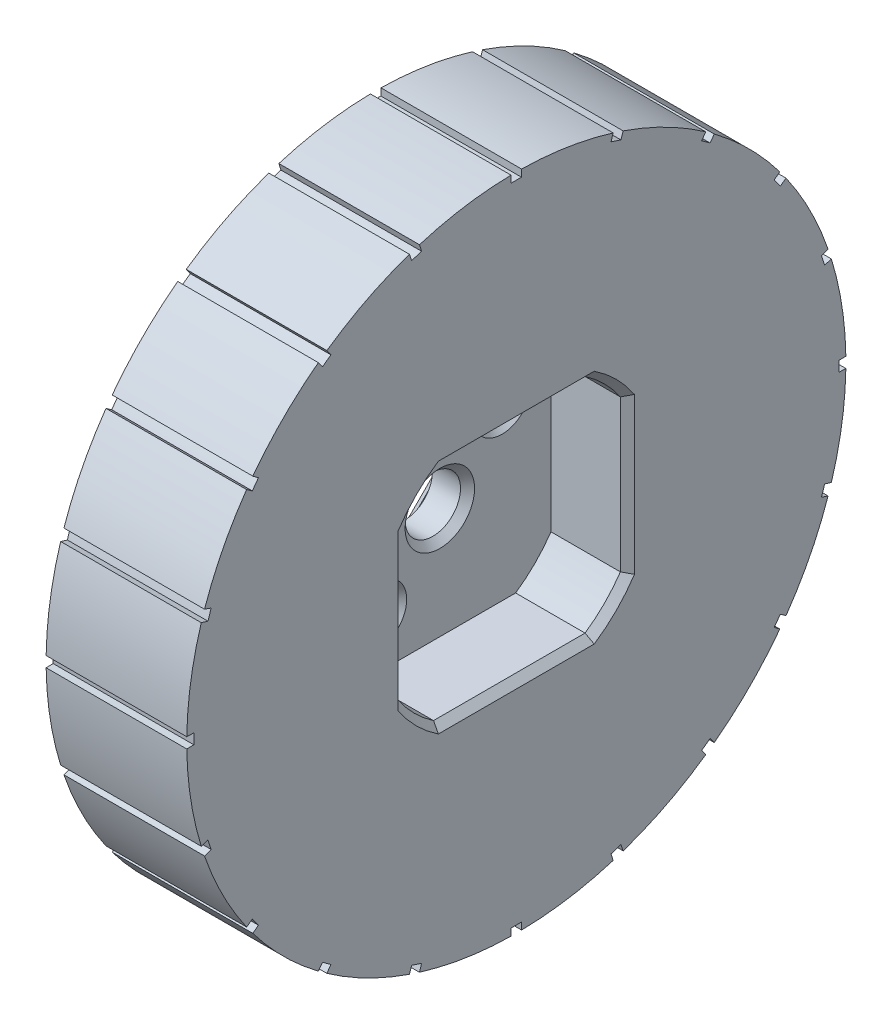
ISO-10303-21;
HEADER;
FILE_DESCRIPTION(('STEP AP214'),'2;1');
FILE_NAME('part.step','',(''),(''),'','','');
FILE_SCHEMA(('AUTOMOTIVE_DESIGN { 1 0 10303 214 1 1 1 1 }'));
ENDSEC;
DATA;
#1=APPLICATION_CONTEXT('core data for automotive mechanical design processes');
#2=APPLICATION_PROTOCOL_DEFINITION('international standard','automotive_design',2000,#1);
#3=PRODUCT_CONTEXT('',#1,'mechanical');
#4=PRODUCT('Part','Part','',(#3));
#5=PRODUCT_RELATED_PRODUCT_CATEGORY('part','',(#4));
#6=PRODUCT_DEFINITION_FORMATION('','',#4);
#7=PRODUCT_DEFINITION_CONTEXT('part definition',#1,'design');
#8=PRODUCT_DEFINITION('design','',#6,#7);
#9=PRODUCT_DEFINITION_SHAPE('','',#8);
#10=(LENGTH_UNIT() NAMED_UNIT(*) SI_UNIT(.MILLI.,.METRE.));
#11=(NAMED_UNIT(*) PLANE_ANGLE_UNIT() SI_UNIT($,.RADIAN.));
#12=(NAMED_UNIT(*) SI_UNIT($,.STERADIAN.) SOLID_ANGLE_UNIT());
#13=UNCERTAINTY_MEASURE_WITH_UNIT(LENGTH_MEASURE(1.E-05),#10,'distance_accuracy_value','');
#14=(GEOMETRIC_REPRESENTATION_CONTEXT(3) GLOBAL_UNCERTAINTY_ASSIGNED_CONTEXT((#13)) GLOBAL_UNIT_ASSIGNED_CONTEXT((#10,
#11,#12)) REPRESENTATION_CONTEXT('',''));
#15=CARTESIAN_POINT('',(0.,0.,0.));
#16=DIRECTION('',(0.,0.,1.));
#17=DIRECTION('',(1.,0.,0.));
#18=AXIS2_PLACEMENT_3D('',#15,#16,#17);
#19=CARTESIAN_POINT('',(-5.08,0.,0.));
#20=DIRECTION('',(1.,0.,0.));
#21=DIRECTION('',(0.,0.,-1.));
#22=AXIS2_PLACEMENT_3D('',#19,#20,#21);
#23=CYLINDRICAL_SURFACE('',#22,2.);
#24=CARTESIAN_POINT('',(-0.952500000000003,0.,0.));
#25=DIRECTION('',(1.,0.,0.));
#26=DIRECTION('',(0.,0.,-1.));
#27=AXIS2_PLACEMENT_3D('',#24,#25,#26);
#28=CIRCLE('',#27,2.);
#29=CARTESIAN_POINT('',(-0.952500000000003,0.,-2.));
#30=VERTEX_POINT('',#29);
#31=EDGE_CURVE('E1377',#30,#30,#28,.T.);
#32=ORIENTED_EDGE('',*,*,#31,.T.);
#33=EDGE_LOOP('',(#32));
#34=FACE_BOUND('',#33,.T.);
#35=CARTESIAN_POINT('',(-2.9845,0.,0.));
#36=DIRECTION('',(1.,0.,0.));
#37=DIRECTION('',(0.,0.,-1.));
#38=AXIS2_PLACEMENT_3D('',#35,#36,#37);
#39=CIRCLE('',#38,2.);
#40=CARTESIAN_POINT('',(-2.9845,0.,-2.));
#41=VERTEX_POINT('',#40);
#42=EDGE_CURVE('E1277',#41,#41,#39,.T.);
#43=ORIENTED_EDGE('',*,*,#42,.F.);
#44=EDGE_LOOP('',(#43));
#45=FACE_BOUND('',#44,.T.);
#46=ADVANCED_FACE('F57',(#34,#45),#23,.F.);
#47=CARTESIAN_POINT('',(-5.08,0.,0.));
#48=DIRECTION('',(-1.,0.,0.));
#49=DIRECTION('',(0.,0.,1.));
#50=AXIS2_PLACEMENT_3D('',#47,#48,#49);
#51=PLANE('',#50);
#52=DIRECTION('',(0.,-0.707106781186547,0.707106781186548));
#53=VECTOR('',#52,1.);
#54=CARTESIAN_POINT('',(-5.08,-1.25723585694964,7.72302026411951));
#55=LINE('',#54,#53);
#56=CARTESIAN_POINT('',(-5.08,7.72302026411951,-1.25723585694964));
#57=VERTEX_POINT('',#56);
#58=CARTESIAN_POINT('',(-5.08,-1.25723585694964,7.72302026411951));
#59=VERTEX_POINT('',#58);
#60=EDGE_CURVE('E1393',#57,#59,#55,.T.);
#61=ORIENTED_EDGE('',*,*,#60,.T.);
#62=CARTESIAN_POINT('',(-5.08,-4.49012806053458,4.49012806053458));
#63=DIRECTION('',(-1.,0.,0.));
#64=DIRECTION('',(0.,0.,1.));
#65=AXIS2_PLACEMENT_3D('',#62,#63,#64);
#66=CIRCLE('',#65,4.57200000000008);
#67=CARTESIAN_POINT('',(-5.08,-7.72302026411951,1.25723585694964));
#68=VERTEX_POINT('',#67);
#69=EDGE_CURVE('E1395',#59,#68,#66,.F.);
#70=ORIENTED_EDGE('',*,*,#69,.T.);
#71=DIRECTION('',(0.,0.707106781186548,-0.707106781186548));
#72=VECTOR('',#71,1.);
#73=CARTESIAN_POINT('',(-5.08,1.25723585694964,-7.72302026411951));
#74=LINE('',#73,#72);
#75=CARTESIAN_POINT('',(-5.08,1.25723585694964,-7.72302026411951));
#76=VERTEX_POINT('',#75);
#77=EDGE_CURVE('E1389',#68,#76,#74,.T.);
#78=ORIENTED_EDGE('',*,*,#77,.T.);
#79=CARTESIAN_POINT('',(-5.08,4.49012806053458,-4.49012806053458));
#80=DIRECTION('',(-1.,0.,0.));
#81=DIRECTION('',(0.,0.,1.));
#82=AXIS2_PLACEMENT_3D('',#79,#80,#81);
#83=CIRCLE('',#82,4.57200000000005);
#84=EDGE_CURVE('E1383',#76,#57,#83,.F.);
#85=ORIENTED_EDGE('',*,*,#84,.T.);
#86=EDGE_LOOP('',(#61,#70,#78,#85));
#87=FACE_BOUND('',#86,.T.);
#88=CARTESIAN_POINT('',(-5.08,0.,0.));
#89=DIRECTION('',(-1.,0.,0.));
#90=DIRECTION('',(0.,0.,1.));
#91=AXIS2_PLACEMENT_3D('',#88,#89,#90);
#92=CIRCLE('',#91,23.3045);
#93=CARTESIAN_POINT('',(-5.08,13.3946281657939,-19.0704917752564));
#94=VERTEX_POINT('',#93);
#95=CARTESIAN_POINT('',(-5.08,13.9979477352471,-18.6321544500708));
#96=VERTEX_POINT('',#95);
#97=EDGE_CURVE('E705',#94,#96,#92,.F.);
#98=ORIENTED_EDGE('',*,*,#97,.F.);
#99=DIRECTION('',(0.,-0.574765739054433,0.818317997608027));
#100=VECTOR('',#99,1.);
#101=CARTESIAN_POINT('',(-5.08,13.6866091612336,-19.4861973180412));
#102=LINE('',#101,#100);
#103=CARTESIAN_POINT('',(-5.08,13.6866091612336,-19.4861973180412));
#104=VERTEX_POINT('',#103);
#105=EDGE_CURVE('E703',#104,#94,#102,.T.);
#106=ORIENTED_EDGE('',*,*,#105,.F.);
#107=CARTESIAN_POINT('',(-5.08,0.,0.));
#108=DIRECTION('',(-1.,0.,0.));
#109=DIRECTION('',(0.,0.,1.));
#110=AXIS2_PLACEMENT_3D('',#107,#108,#109);
#111=CIRCLE('',#110,23.8125);
#112=CARTESIAN_POINT('',(-5.08,7.71987776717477,-22.5263988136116));
#113=VERTEX_POINT('',#112);
#114=EDGE_CURVE('E708',#113,#104,#111,.F.);
#115=ORIENTED_EDGE('',*,*,#114,.F.);
#116=DIRECTION('',(0.,0.324194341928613,-0.945990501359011));
#117=VECTOR('',#116,1.);
#118=CARTESIAN_POINT('',(-5.08,7.55518704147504,-22.0458356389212));
#119=LINE('',#118,#117);
#120=CARTESIAN_POINT('',(-5.08,7.55518704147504,-22.0458356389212));
#121=VERTEX_POINT('',#120);
#122=EDGE_CURVE('E714',#121,#113,#119,.T.);
#123=ORIENTED_EDGE('',*,*,#122,.F.);
#124=CARTESIAN_POINT('',(-5.08,0.,0.));
#125=DIRECTION('',(-1.,0.,0.));
#126=DIRECTION('',(0.,0.,1.));
#127=AXIS2_PLACEMENT_3D('',#124,#125,#126);
#128=CIRCLE('',#127,23.3045);
#129=CARTESIAN_POINT('',(-5.08,6.84594235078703,-22.2762832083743));
#130=VERTEX_POINT('',#129);
#131=EDGE_CURVE('E717',#130,#121,#128,.F.);
#132=ORIENTED_EDGE('',*,*,#131,.F.);
#133=DIRECTION('',(0.,-0.293760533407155,0.955879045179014));
#134=VECTOR('',#133,1.);
#135=CARTESIAN_POINT('',(-5.08,6.99517270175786,-22.7618697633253));
#136=LINE('',#135,#134);
#137=CARTESIAN_POINT('',(-5.08,6.99517270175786,-22.7618697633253));
#138=VERTEX_POINT('',#137);
#139=EDGE_CURVE('E724',#138,#130,#136,.T.);
#140=ORIENTED_EDGE('',*,*,#139,.F.);
#141=CARTESIAN_POINT('',(-5.08,0.,0.));
#142=DIRECTION('',(-1.,0.,0.));
#143=DIRECTION('',(0.,0.,1.));
#144=AXIS2_PLACEMENT_3D('',#141,#142,#143);
#145=CIRCLE('',#144,23.8125);
#146=CARTESIAN_POINT('',(-5.08,0.381000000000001,-23.809451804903));
#147=VERTEX_POINT('',#146);
#148=EDGE_CURVE('E729',#147,#138,#145,.F.);
#149=ORIENTED_EDGE('',*,*,#148,.F.);
#150=DIRECTION('',(0.,0.0160000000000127,-0.999871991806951));
#151=VECTOR('',#150,1.);
#152=CARTESIAN_POINT('',(-5.08,0.372871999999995,-23.3015168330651));
#153=LINE('',#152,#151);
#154=CARTESIAN_POINT('',(-5.08,0.372871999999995,-23.3015168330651));
#155=VERTEX_POINT('',#154);
#156=EDGE_CURVE('E734',#155,#147,#153,.T.);
#157=ORIENTED_EDGE('',*,*,#156,.F.);
#158=CARTESIAN_POINT('',(-5.08,0.,0.));
#159=DIRECTION('',(-1.,0.,0.));
#160=DIRECTION('',(0.,0.,1.));
#161=AXIS2_PLACEMENT_3D('',#158,#159,#160);
#162=CIRCLE('',#161,23.3045);
#163=CARTESIAN_POINT('',(-5.08,-0.372872,-23.3015168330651));
#164=VERTEX_POINT('',#163);
#165=EDGE_CURVE('E738',#164,#155,#162,.F.);
#166=ORIENTED_EDGE('',*,*,#165,.F.);
#167=DIRECTION('',(0.,0.0160000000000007,0.999871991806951));
#168=VECTOR('',#167,1.);
#169=CARTESIAN_POINT('',(-5.08,-0.381,-23.809451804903));
#170=LINE('',#169,#168);
#171=CARTESIAN_POINT('',(-5.08,-0.381,-23.809451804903));
#172=VERTEX_POINT('',#171);
#173=EDGE_CURVE('E743',#172,#164,#170,.T.);
#174=ORIENTED_EDGE('',*,*,#173,.F.);
#175=CARTESIAN_POINT('',(-5.08,0.,0.));
#176=DIRECTION('',(-1.,0.,0.));
#177=DIRECTION('',(0.,0.,1.));
#178=AXIS2_PLACEMENT_3D('',#175,#176,#177);
#179=CIRCLE('',#178,23.8125);
#180=CARTESIAN_POINT('',(-5.08,-6.99517270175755,-22.7618697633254));
#181=VERTEX_POINT('',#180);
#182=EDGE_CURVE('E749',#181,#172,#179,.F.);
#183=ORIENTED_EDGE('',*,*,#182,.F.);
#184=DIRECTION('',(0.,-0.293760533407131,-0.955879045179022));
#185=VECTOR('',#184,1.);
#186=CARTESIAN_POINT('',(-5.08,-6.84594235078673,-22.2762832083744));
#187=LINE('',#186,#185);
#188=CARTESIAN_POINT('',(-5.08,-6.84594235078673,-22.2762832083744));
#189=VERTEX_POINT('',#188);
#190=EDGE_CURVE('E755',#189,#181,#187,.T.);
#191=ORIENTED_EDGE('',*,*,#190,.F.);
#192=CARTESIAN_POINT('',(-5.08,0.,0.));
#193=DIRECTION('',(-1.,0.,0.));
#194=DIRECTION('',(0.,0.,1.));
#195=AXIS2_PLACEMENT_3D('',#192,#193,#194);
#196=CIRCLE('',#195,23.3045);
#197=CARTESIAN_POINT('',(-5.08,-7.55518704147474,-22.0458356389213));
#198=VERTEX_POINT('',#197);
#199=EDGE_CURVE('E758',#198,#189,#196,.F.);
#200=ORIENTED_EDGE('',*,*,#199,.F.);
#201=DIRECTION('',(0.,0.324194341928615,0.945990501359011));
#202=VECTOR('',#201,1.);
#203=CARTESIAN_POINT('',(-5.08,-7.71987776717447,-22.5263988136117));
#204=LINE('',#203,#202);
#205=CARTESIAN_POINT('',(-5.08,-7.71987776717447,-22.5263988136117));
#206=VERTEX_POINT('',#205);
#207=EDGE_CURVE('E763',#206,#198,#204,.T.);
#208=ORIENTED_EDGE('',*,*,#207,.F.);
#209=CARTESIAN_POINT('',(-5.08,0.,0.));
#210=DIRECTION('',(-1.,0.,0.));
#211=DIRECTION('',(0.,0.,1.));
#212=AXIS2_PLACEMENT_3D('',#209,#210,#211);
#213=CIRCLE('',#212,23.8125);
#214=CARTESIAN_POINT('',(-5.08,-13.6866091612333,-19.4861973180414));
#215=VERTEX_POINT('',#214);
#216=EDGE_CURVE('E768',#215,#206,#213,.F.);
#217=ORIENTED_EDGE('',*,*,#216,.F.);
#218=DIRECTION('',(0.,-0.574765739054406,-0.818317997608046));
#219=VECTOR('',#218,1.);
#220=CARTESIAN_POINT('',(-5.08,-13.3946281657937,-19.0704917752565));
#221=LINE('',#220,#219);
#222=CARTESIAN_POINT('',(-5.08,-13.3946281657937,-19.0704917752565));
#223=VERTEX_POINT('',#222);
#224=EDGE_CURVE('E773',#223,#215,#221,.T.);
#225=ORIENTED_EDGE('',*,*,#224,.F.);
#226=CARTESIAN_POINT('',(-5.08,0.,0.));
#227=DIRECTION('',(-1.,0.,0.));
#228=DIRECTION('',(0.,0.,1.));
#229=AXIS2_PLACEMENT_3D('',#226,#227,#228);
#230=CIRCLE('',#229,23.3045);
#231=CARTESIAN_POINT('',(-5.08,-13.9979477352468,-18.6321544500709));
#232=VERTEX_POINT('',#231);
#233=EDGE_CURVE('E779',#232,#223,#230,.F.);
#234=ORIENTED_EDGE('',*,*,#233,.F.);
#235=DIRECTION('',(0.,0.600654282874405,0.799508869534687));
#236=VECTOR('',#235,1.);
#237=CARTESIAN_POINT('',(-5.08,-14.303080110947,-19.0383049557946));
#238=LINE('',#237,#236);
#239=CARTESIAN_POINT('',(-5.08,-14.303080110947,-19.0383049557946));
#240=VERTEX_POINT('',#239);
#241=EDGE_CURVE('E785',#240,#232,#238,.T.);
#242=ORIENTED_EDGE('',*,*,#241,.F.);
#243=CARTESIAN_POINT('',(-5.08,0.,0.));
#244=DIRECTION('',(-1.,0.,0.));
#245=DIRECTION('',(0.,0.,1.));
#246=AXIS2_PLACEMENT_3D('',#243,#244,#245);
#247=CIRCLE('',#246,23.8125);
#248=CARTESIAN_POINT('',(-5.08,-19.0383049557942,-14.3030801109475));
#249=VERTEX_POINT('',#248);
#250=EDGE_CURVE('E788',#249,#240,#247,.F.);
#251=ORIENTED_EDGE('',*,*,#250,.F.);
#252=DIRECTION('',(0.,-0.799508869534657,-0.600654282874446));
#253=VECTOR('',#252,1.);
#254=CARTESIAN_POINT('',(-5.08,-18.6321544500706,-13.9979477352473));
#255=LINE('',#254,#253);
#256=CARTESIAN_POINT('',(-5.08,-18.6321544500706,-13.9979477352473));
#257=VERTEX_POINT('',#256);
#258=EDGE_CURVE('E793',#257,#249,#255,.T.);
#259=ORIENTED_EDGE('',*,*,#258,.F.);
#260=CARTESIAN_POINT('',(-5.08,0.,0.));
#261=DIRECTION('',(-1.,0.,0.));
#262=DIRECTION('',(0.,0.,1.));
#263=AXIS2_PLACEMENT_3D('',#260,#261,#262);
#264=CIRCLE('',#263,23.3045);
#265=CARTESIAN_POINT('',(-5.08,-19.0704917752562,-13.3946281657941));
#266=VERTEX_POINT('',#265);
#267=EDGE_CURVE('E799',#266,#257,#264,.F.);
#268=ORIENTED_EDGE('',*,*,#267,.F.);
#269=DIRECTION('',(0.,0.818317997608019,0.574765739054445));
#270=VECTOR('',#269,1.);
#271=CARTESIAN_POINT('',(-5.08,-19.4861973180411,-13.6866091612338));
#272=LINE('',#271,#270);
#273=CARTESIAN_POINT('',(-5.08,-19.4861973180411,-13.6866091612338));
#274=VERTEX_POINT('',#273);
#275=EDGE_CURVE('E802',#274,#266,#272,.T.);
#276=ORIENTED_EDGE('',*,*,#275,.F.);
#277=CARTESIAN_POINT('',(-5.08,0.,0.));
#278=DIRECTION('',(-1.,0.,0.));
#279=DIRECTION('',(0.,0.,1.));
#280=AXIS2_PLACEMENT_3D('',#277,#278,#279);
#281=CIRCLE('',#280,23.8125);
#282=CARTESIAN_POINT('',(-5.08,-22.5263988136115,-7.71987776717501));
#283=VERTEX_POINT('',#282);
#284=EDGE_CURVE('E809',#283,#274,#281,.F.);
#285=ORIENTED_EDGE('',*,*,#284,.F.);
#286=DIRECTION('',(0.,-0.945990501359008,-0.324194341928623));
#287=VECTOR('',#286,1.);
#288=CARTESIAN_POINT('',(-5.08,-22.0458356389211,-7.55518704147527));
#289=LINE('',#288,#287);
#290=CARTESIAN_POINT('',(-5.08,-22.0458356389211,-7.55518704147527));
#291=VERTEX_POINT('',#290);
#292=EDGE_CURVE('E814',#291,#283,#289,.T.);
#293=ORIENTED_EDGE('',*,*,#292,.F.);
#294=CARTESIAN_POINT('',(-5.08,0.,0.));
#295=DIRECTION('',(-1.,0.,0.));
#296=DIRECTION('',(0.,0.,1.));
#297=AXIS2_PLACEMENT_3D('',#294,#295,#296);
#298=CIRCLE('',#297,23.3045);
#299=CARTESIAN_POINT('',(-5.08,-22.2762832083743,-6.84594235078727));
#300=VERTEX_POINT('',#299);
#301=EDGE_CURVE('E819',#300,#291,#298,.F.);
#302=ORIENTED_EDGE('',*,*,#301,.F.);
#303=DIRECTION('',(0.,0.95587904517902,0.293760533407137));
#304=VECTOR('',#303,1.);
#305=CARTESIAN_POINT('',(-5.08,-22.7618697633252,-6.99517270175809));
#306=LINE('',#305,#304);
#307=CARTESIAN_POINT('',(-5.08,-22.7618697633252,-6.99517270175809));
#308=VERTEX_POINT('',#307);
#309=EDGE_CURVE('E823',#308,#300,#306,.T.);
#310=ORIENTED_EDGE('',*,*,#309,.F.);
#311=CARTESIAN_POINT('',(-5.08,0.,0.));
#312=DIRECTION('',(-1.,0.,0.));
#313=DIRECTION('',(0.,0.,1.));
#314=AXIS2_PLACEMENT_3D('',#311,#312,#313);
#315=CIRCLE('',#314,23.8125);
#316=CARTESIAN_POINT('',(-5.08,-23.809451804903,-0.381000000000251));
#317=VERTEX_POINT('',#316);
#318=EDGE_CURVE('E828',#317,#308,#315,.F.);
#319=ORIENTED_EDGE('',*,*,#318,.F.);
#320=DIRECTION('',(0.,-0.999871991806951,-0.0160000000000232));
#321=VECTOR('',#320,1.);
#322=CARTESIAN_POINT('',(-5.08,-23.3015168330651,-0.372872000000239));
#323=LINE('',#322,#321);
#324=CARTESIAN_POINT('',(-5.08,-23.3015168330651,-0.372872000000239));
#325=VERTEX_POINT('',#324);
#326=EDGE_CURVE('E834',#325,#317,#323,.T.);
#327=ORIENTED_EDGE('',*,*,#326,.F.);
#328=CARTESIAN_POINT('',(-5.08,0.,0.));
#329=DIRECTION('',(-1.,0.,0.));
#330=DIRECTION('',(0.,0.,1.));
#331=AXIS2_PLACEMENT_3D('',#328,#329,#330);
#332=CIRCLE('',#331,23.3045);
#333=CARTESIAN_POINT('',(-5.08,-23.3015168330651,0.372871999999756));
#334=VERTEX_POINT('',#333);
#335=EDGE_CURVE('E840',#334,#325,#332,.F.);
#336=ORIENTED_EDGE('',*,*,#335,.F.);
#337=DIRECTION('',(0.,0.999871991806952,-0.0159999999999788));
#338=VECTOR('',#337,1.);
#339=CARTESIAN_POINT('',(-5.08,-23.809451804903,0.380999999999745));
#340=LINE('',#339,#338);
#341=CARTESIAN_POINT('',(-5.08,-23.809451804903,0.380999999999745));
#342=VERTEX_POINT('',#341);
#343=EDGE_CURVE('E843',#342,#334,#340,.T.);
#344=ORIENTED_EDGE('',*,*,#343,.F.);
#345=CARTESIAN_POINT('',(-5.08,0.,0.));
#346=DIRECTION('',(-1.,0.,0.));
#347=DIRECTION('',(0.,0.,1.));
#348=AXIS2_PLACEMENT_3D('',#345,#346,#347);
#349=CIRCLE('',#348,23.8125);
#350=CARTESIAN_POINT('',(-5.08,-22.7618697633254,6.99517270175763));
#351=VERTEX_POINT('',#350);
#352=EDGE_CURVE('E848',#351,#342,#349,.F.);
#353=ORIENTED_EDGE('',*,*,#352,.F.);
#354=DIRECTION('',(0.,-0.955879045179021,0.293760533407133));
#355=VECTOR('',#354,1.);
#356=CARTESIAN_POINT('',(-5.08,-22.2762832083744,6.8459423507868));
#357=LINE('',#356,#355);
#358=CARTESIAN_POINT('',(-5.08,-22.2762832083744,6.8459423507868));
#359=VERTEX_POINT('',#358);
#360=EDGE_CURVE('E853',#359,#351,#357,.T.);
#361=ORIENTED_EDGE('',*,*,#360,.F.);
#362=CARTESIAN_POINT('',(-5.08,0.,0.));
#363=DIRECTION('',(-1.,0.,0.));
#364=DIRECTION('',(0.,0.,1.));
#365=AXIS2_PLACEMENT_3D('',#362,#363,#364);
#366=CIRCLE('',#365,23.3045);
#367=CARTESIAN_POINT('',(-5.08,-22.0458356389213,7.55518704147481));
#368=VERTEX_POINT('',#367);
#369=EDGE_CURVE('E858',#368,#359,#366,.F.);
#370=ORIENTED_EDGE('',*,*,#369,.F.);
#371=DIRECTION('',(0.,0.94599050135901,-0.324194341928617));
#372=VECTOR('',#371,1.);
#373=CARTESIAN_POINT('',(-5.08,-22.5263988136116,7.71987776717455));
#374=LINE('',#373,#372);
#375=CARTESIAN_POINT('',(-5.08,-22.5263988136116,7.71987776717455));
#376=VERTEX_POINT('',#375);
#377=EDGE_CURVE('E864',#376,#368,#374,.T.);
#378=ORIENTED_EDGE('',*,*,#377,.F.);
#379=CARTESIAN_POINT('',(-5.08,0.,0.));
#380=DIRECTION('',(-1.,0.,0.));
#381=DIRECTION('',(0.,0.,1.));
#382=AXIS2_PLACEMENT_3D('',#379,#380,#381);
#383=CIRCLE('',#382,23.8125);
#384=CARTESIAN_POINT('',(-5.08,-19.4861973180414,13.6866091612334));
#385=VERTEX_POINT('',#384);
#386=EDGE_CURVE('E870',#385,#376,#383,.F.);
#387=ORIENTED_EDGE('',*,*,#386,.F.);
#388=DIRECTION('',(0.,-0.818317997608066,0.574765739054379));
#389=VECTOR('',#388,1.);
#390=CARTESIAN_POINT('',(-5.08,-19.0704917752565,13.3946281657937));
#391=LINE('',#390,#389);
#392=CARTESIAN_POINT('',(-5.08,-19.0704917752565,13.3946281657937));
#393=VERTEX_POINT('',#392);
#394=EDGE_CURVE('E873',#393,#385,#391,.T.);
#395=ORIENTED_EDGE('',*,*,#394,.F.);
#396=CARTESIAN_POINT('',(-5.08,0.,0.));
#397=DIRECTION('',(-1.,0.,0.));
#398=DIRECTION('',(0.,0.,1.));
#399=AXIS2_PLACEMENT_3D('',#396,#397,#398);
#400=CIRCLE('',#399,23.3045);
#401=CARTESIAN_POINT('',(-5.08,-18.6321544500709,13.9979477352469));
#402=VERTEX_POINT('',#401);
#403=EDGE_CURVE('E878',#402,#393,#400,.F.);
#404=ORIENTED_EDGE('',*,*,#403,.F.);
#405=DIRECTION('',(0.,0.799508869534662,-0.600654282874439));
#406=VECTOR('',#405,1.);
#407=CARTESIAN_POINT('',(-5.08,-19.0383049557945,14.3030801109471));
#408=LINE('',#407,#406);
#409=CARTESIAN_POINT('',(-5.08,-19.0383049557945,14.3030801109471));
#410=VERTEX_POINT('',#409);
#411=EDGE_CURVE('E884',#410,#402,#408,.T.);
#412=ORIENTED_EDGE('',*,*,#411,.F.);
#413=CARTESIAN_POINT('',(-5.08,0.,0.));
#414=DIRECTION('',(-1.,0.,0.));
#415=DIRECTION('',(0.,0.,1.));
#416=AXIS2_PLACEMENT_3D('',#413,#414,#415);
#417=CIRCLE('',#416,23.8125);
#418=CARTESIAN_POINT('',(-5.08,-14.3030801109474,19.0383049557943));
#419=VERTEX_POINT('',#418);
#420=EDGE_CURVE('E887',#419,#410,#417,.F.);
#421=ORIENTED_EDGE('',*,*,#420,.F.);
#422=DIRECTION('',(0.,-0.600654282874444,0.799508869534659));
#423=VECTOR('',#422,1.);
#424=CARTESIAN_POINT('',(-5.08,-13.9979477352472,18.6321544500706));
#425=LINE('',#424,#423);
#426=CARTESIAN_POINT('',(-5.08,-13.9979477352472,18.6321544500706));
#427=VERTEX_POINT('',#426);
#428=EDGE_CURVE('E894',#427,#419,#425,.T.);
#429=ORIENTED_EDGE('',*,*,#428,.F.);
#430=CARTESIAN_POINT('',(-5.08,0.,0.));
#431=DIRECTION('',(-1.,0.,0.));
#432=DIRECTION('',(0.,0.,1.));
#433=AXIS2_PLACEMENT_3D('',#430,#431,#432);
#434=CIRCLE('',#433,23.3045);
#435=CARTESIAN_POINT('',(-5.08,-13.3946281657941,19.0704917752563));
#436=VERTEX_POINT('',#435);
#437=EDGE_CURVE('E899',#436,#427,#434,.F.);
#438=ORIENTED_EDGE('',*,*,#437,.F.);
#439=DIRECTION('',(0.,0.574765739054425,-0.818317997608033));
#440=VECTOR('',#439,1.);
#441=CARTESIAN_POINT('',(-5.08,-13.6866091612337,19.4861973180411));
#442=LINE('',#441,#440);
#443=CARTESIAN_POINT('',(-5.08,-13.6866091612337,19.4861973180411));
#444=VERTEX_POINT('',#443);
#445=EDGE_CURVE('E904',#444,#436,#442,.T.);
#446=ORIENTED_EDGE('',*,*,#445,.F.);
#447=CARTESIAN_POINT('',(-5.08,0.,0.));
#448=DIRECTION('',(-1.,0.,0.));
#449=DIRECTION('',(0.,0.,1.));
#450=AXIS2_PLACEMENT_3D('',#447,#448,#449);
#451=CIRCLE('',#450,23.8125);
#452=CARTESIAN_POINT('',(-5.08,-7.71987776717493,22.5263988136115));
#453=VERTEX_POINT('',#452);
#454=EDGE_CURVE('E908',#453,#444,#451,.F.);
#455=ORIENTED_EDGE('',*,*,#454,.F.);
#456=DIRECTION('',(0.,-0.324194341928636,0.945990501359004));
#457=VECTOR('',#456,1.);
#458=CARTESIAN_POINT('',(-5.08,-7.55518704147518,22.0458356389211));
#459=LINE('',#458,#457);
#460=CARTESIAN_POINT('',(-5.08,-7.55518704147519,22.0458356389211));
#461=VERTEX_POINT('',#460);
#462=EDGE_CURVE('E913',#461,#453,#459,.T.);
#463=ORIENTED_EDGE('',*,*,#462,.F.);
#464=CARTESIAN_POINT('',(-5.08,0.,0.));
#465=DIRECTION('',(-1.,0.,0.));
#466=DIRECTION('',(0.,0.,1.));
#467=AXIS2_PLACEMENT_3D('',#464,#465,#466);
#468=CIRCLE('',#467,23.3045);
#469=CARTESIAN_POINT('',(-5.08,-6.84594235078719,22.2762832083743));
#470=VERTEX_POINT('',#469);
#471=EDGE_CURVE('E919',#470,#461,#468,.F.);
#472=ORIENTED_EDGE('',*,*,#471,.F.);
#473=DIRECTION('',(0.,0.293760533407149,-0.955879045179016));
#474=VECTOR('',#473,1.);
#475=CARTESIAN_POINT('',(-5.08,-6.99517270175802,22.7618697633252));
#476=LINE('',#475,#474);
#477=CARTESIAN_POINT('',(-5.08,-6.99517270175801,22.7618697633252));
#478=VERTEX_POINT('',#477);
#479=EDGE_CURVE('E925',#478,#470,#476,.T.);
#480=ORIENTED_EDGE('',*,*,#479,.F.);
#481=CARTESIAN_POINT('',(-5.08,0.,0.));
#482=DIRECTION('',(-1.,0.,0.));
#483=DIRECTION('',(0.,0.,1.));
#484=AXIS2_PLACEMENT_3D('',#481,#482,#483);
#485=CIRCLE('',#484,23.8125);
#486=CARTESIAN_POINT('',(-5.08,-0.381000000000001,23.809451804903));
#487=VERTEX_POINT('',#486);
#488=EDGE_CURVE('E928',#487,#478,#485,.F.);
#489=ORIENTED_EDGE('',*,*,#488,.F.);
#490=DIRECTION('',(0.,-0.0160000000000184,0.999871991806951));
#491=VECTOR('',#490,1.);
#492=CARTESIAN_POINT('',(-5.08,-0.372871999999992,23.3015168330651));
#493=LINE('',#492,#491);
#494=CARTESIAN_POINT('',(-5.08,-0.372871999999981,23.3015168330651));
#495=VERTEX_POINT('',#494);
#496=EDGE_CURVE('E933',#495,#487,#493,.T.);
#497=ORIENTED_EDGE('',*,*,#496,.F.);
#498=CARTESIAN_POINT('',(-5.08,0.,0.));
#499=DIRECTION('',(-1.,0.,0.));
#500=DIRECTION('',(0.,0.,1.));
#501=AXIS2_PLACEMENT_3D('',#498,#499,#500);
#502=CIRCLE('',#501,23.3045);
#503=CARTESIAN_POINT('',(-5.08,0.372872,23.3015168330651));
#504=VERTEX_POINT('',#503);
#505=EDGE_CURVE('E938',#504,#495,#502,.F.);
#506=ORIENTED_EDGE('',*,*,#505,.F.);
#507=DIRECTION('',(0.,-0.0159999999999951,-0.999871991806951));
#508=VECTOR('',#507,1.);
#509=CARTESIAN_POINT('',(-5.08,0.380999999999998,23.809451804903));
#510=LINE('',#509,#508);
#511=CARTESIAN_POINT('',(-5.08,0.380999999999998,23.809451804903));
#512=VERTEX_POINT('',#511);
#513=EDGE_CURVE('E943',#512,#504,#510,.T.);
#514=ORIENTED_EDGE('',*,*,#513,.F.);
#515=CARTESIAN_POINT('',(-5.08,0.,0.));
#516=DIRECTION('',(-1.,0.,0.));
#517=DIRECTION('',(0.,0.,1.));
#518=AXIS2_PLACEMENT_3D('',#515,#516,#517);
#519=CIRCLE('',#518,23.8125);
#520=CARTESIAN_POINT('',(-5.08,6.9951727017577,22.7618697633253));
#521=VERTEX_POINT('',#520);
#522=EDGE_CURVE('E949',#521,#512,#519,.F.);
#523=ORIENTED_EDGE('',*,*,#522,.F.);
#524=DIRECTION('',(0.,0.293760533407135,0.95587904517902));
#525=VECTOR('',#524,1.);
#526=CARTESIAN_POINT('',(-5.08,6.84594235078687,22.2762832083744));
#527=LINE('',#526,#525);
#528=CARTESIAN_POINT('',(-5.08,6.84594235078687,22.2762832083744));
#529=VERTEX_POINT('',#528);
#530=EDGE_CURVE('E955',#529,#521,#527,.T.);
#531=ORIENTED_EDGE('',*,*,#530,.F.);
#532=CARTESIAN_POINT('',(-5.08,0.,0.));
#533=DIRECTION('',(-1.,0.,0.));
#534=DIRECTION('',(0.,0.,1.));
#535=AXIS2_PLACEMENT_3D('',#532,#533,#534);
#536=CIRCLE('',#535,23.3045);
#537=CARTESIAN_POINT('',(-5.08,7.55518704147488,22.0458356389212));
#538=VERTEX_POINT('',#537);
#539=EDGE_CURVE('E958',#538,#529,#536,.F.);
#540=ORIENTED_EDGE('',*,*,#539,.F.);
#541=DIRECTION('',(0.,-0.324194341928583,-0.945990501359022));
#542=VECTOR('',#541,1.);
#543=CARTESIAN_POINT('',(-5.08,7.7198777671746,22.5263988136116));
#544=LINE('',#543,#542);
#545=CARTESIAN_POINT('',(-5.08,7.7198777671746,22.5263988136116));
#546=VERTEX_POINT('',#545);
#547=EDGE_CURVE('E963',#546,#538,#544,.T.);
#548=ORIENTED_EDGE('',*,*,#547,.F.);
#549=CARTESIAN_POINT('',(-5.08,0.,0.));
#550=DIRECTION('',(-1.,0.,0.));
#551=DIRECTION('',(0.,0.,1.));
#552=AXIS2_PLACEMENT_3D('',#549,#550,#551);
#553=CIRCLE('',#552,23.8125);
#554=CARTESIAN_POINT('',(-5.08,13.6866091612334,19.4861973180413));
#555=VERTEX_POINT('',#554);
#556=EDGE_CURVE('E969',#555,#546,#553,.F.);
#557=ORIENTED_EDGE('',*,*,#556,.F.);
#558=DIRECTION('',(0.,0.574765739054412,0.818317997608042));
#559=VECTOR('',#558,1.);
#560=CARTESIAN_POINT('',(-5.08,13.3946281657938,19.0704917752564));
#561=LINE('',#560,#559);
#562=CARTESIAN_POINT('',(-5.08,13.3946281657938,19.0704917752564));
#563=VERTEX_POINT('',#562);
#564=EDGE_CURVE('E972',#563,#555,#561,.T.);
#565=ORIENTED_EDGE('',*,*,#564,.F.);
#566=CARTESIAN_POINT('',(-5.08,0.,0.));
#567=DIRECTION('',(-1.,0.,0.));
#568=DIRECTION('',(0.,0.,1.));
#569=AXIS2_PLACEMENT_3D('',#566,#567,#568);
#570=CIRCLE('',#569,23.3045);
#571=CARTESIAN_POINT('',(-5.08,13.9979477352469,18.6321544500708));
#572=VERTEX_POINT('',#571);
#573=EDGE_CURVE('E979',#572,#563,#570,.F.);
#574=ORIENTED_EDGE('',*,*,#573,.F.);
#575=DIRECTION('',(0.,-0.600654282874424,-0.799508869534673));
#576=VECTOR('',#575,1.);
#577=CARTESIAN_POINT('',(-5.08,14.3030801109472,19.0383049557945));
#578=LINE('',#577,#576);
#579=CARTESIAN_POINT('',(-5.08,14.3030801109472,19.0383049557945));
#580=VERTEX_POINT('',#579);
#581=EDGE_CURVE('E984',#580,#572,#578,.T.);
#582=ORIENTED_EDGE('',*,*,#581,.F.);
#583=CARTESIAN_POINT('',(-5.08,0.,0.));
#584=DIRECTION('',(-1.,0.,0.));
#585=DIRECTION('',(0.,0.,1.));
#586=AXIS2_PLACEMENT_3D('',#583,#584,#585);
#587=CIRCLE('',#586,23.8125);
#588=CARTESIAN_POINT('',(-5.08,19.0383049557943,14.3030801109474));
#589=VERTEX_POINT('',#588);
#590=EDGE_CURVE('E989',#589,#580,#587,.F.);
#591=ORIENTED_EDGE('',*,*,#590,.F.);
#592=DIRECTION('',(0.,0.799508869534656,0.600654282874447));
#593=VECTOR('',#592,1.);
#594=CARTESIAN_POINT('',(-5.08,18.6321544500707,13.9979477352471));
#595=LINE('',#594,#593);
#596=CARTESIAN_POINT('',(-5.08,18.6321544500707,13.9979477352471));
#597=VERTEX_POINT('',#596);
#598=EDGE_CURVE('E993',#597,#589,#595,.T.);
#599=ORIENTED_EDGE('',*,*,#598,.F.);
#600=CARTESIAN_POINT('',(-5.08,0.,0.));
#601=DIRECTION('',(-1.,0.,0.));
#602=DIRECTION('',(0.,0.,1.));
#603=AXIS2_PLACEMENT_3D('',#600,#601,#602);
#604=CIRCLE('',#603,23.3045);
#605=CARTESIAN_POINT('',(-5.08,19.0704917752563,13.394628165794));
#606=VERTEX_POINT('',#605);
#607=EDGE_CURVE('E998',#606,#597,#604,.F.);
#608=ORIENTED_EDGE('',*,*,#607,.F.);
#609=DIRECTION('',(0.,-0.818317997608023,-0.574765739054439));
#610=VECTOR('',#609,1.);
#611=CARTESIAN_POINT('',(-5.08,19.4861973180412,13.6866091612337));
#612=LINE('',#611,#610);
#613=CARTESIAN_POINT('',(-5.08,19.4861973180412,13.6866091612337));
#614=VERTEX_POINT('',#613);
#615=EDGE_CURVE('E1004',#614,#606,#612,.T.);
#616=ORIENTED_EDGE('',*,*,#615,.F.);
#617=CARTESIAN_POINT('',(-5.08,0.,0.));
#618=DIRECTION('',(-1.,0.,0.));
#619=DIRECTION('',(0.,0.,1.));
#620=AXIS2_PLACEMENT_3D('',#617,#618,#619);
#621=CIRCLE('',#620,23.8125);
#622=CARTESIAN_POINT('',(-5.08,22.5263988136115,7.71987776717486));
#623=VERTEX_POINT('',#622);
#624=EDGE_CURVE('E1010',#623,#614,#621,.F.);
#625=ORIENTED_EDGE('',*,*,#624,.F.);
#626=DIRECTION('',(0.,0.945990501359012,0.324194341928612));
#627=VECTOR('',#626,1.);
#628=CARTESIAN_POINT('',(-5.08,22.0458356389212,7.55518704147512));
#629=LINE('',#628,#627);
#630=CARTESIAN_POINT('',(-5.08,22.0458356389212,7.55518704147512));
#631=VERTEX_POINT('',#630);
#632=EDGE_CURVE('E1013',#631,#623,#629,.T.);
#633=ORIENTED_EDGE('',*,*,#632,.F.);
#634=CARTESIAN_POINT('',(-5.08,0.,0.));
#635=DIRECTION('',(-1.,0.,0.));
#636=DIRECTION('',(0.,0.,1.));
#637=AXIS2_PLACEMENT_3D('',#634,#635,#636);
#638=CIRCLE('',#637,23.3045);
#639=CARTESIAN_POINT('',(-5.08,22.2762832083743,6.84594235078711));
#640=VERTEX_POINT('',#639);
#641=EDGE_CURVE('E1018',#640,#631,#638,.F.);
#642=ORIENTED_EDGE('',*,*,#641,.F.);
#643=DIRECTION('',(0.,-0.955879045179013,-0.29376053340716));
#644=VECTOR('',#643,1.);
#645=CARTESIAN_POINT('',(-5.08,22.7618697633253,6.99517270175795));
#646=LINE('',#645,#644);
#647=CARTESIAN_POINT('',(-5.08,22.7618697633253,6.99517270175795));
#648=VERTEX_POINT('',#647);
#649=EDGE_CURVE('E1023',#648,#640,#646,.T.);
#650=ORIENTED_EDGE('',*,*,#649,.F.);
#651=CARTESIAN_POINT('',(-5.08,0.,0.));
#652=DIRECTION('',(-1.,0.,0.));
#653=DIRECTION('',(0.,0.,1.));
#654=AXIS2_PLACEMENT_3D('',#651,#652,#653);
#655=CIRCLE('',#654,23.8125);
#656=CARTESIAN_POINT('',(-5.08,23.809451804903,0.381000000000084));
#657=VERTEX_POINT('',#656);
#658=EDGE_CURVE('E1028',#657,#648,#655,.F.);
#659=ORIENTED_EDGE('',*,*,#658,.F.);
#660=DIRECTION('',(0.,0.999871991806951,0.0160000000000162));
#661=VECTOR('',#660,1.);
#662=CARTESIAN_POINT('',(-5.08,23.3015168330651,0.372872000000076));
#663=LINE('',#662,#661);
#664=CARTESIAN_POINT('',(-5.08,23.3015168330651,0.372872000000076));
#665=VERTEX_POINT('',#664);
#666=EDGE_CURVE('E1034',#665,#657,#663,.T.);
#667=ORIENTED_EDGE('',*,*,#666,.F.);
#668=CARTESIAN_POINT('',(-5.08,0.,0.));
#669=DIRECTION('',(-1.,0.,0.));
#670=DIRECTION('',(0.,0.,1.));
#671=AXIS2_PLACEMENT_3D('',#668,#669,#670);
#672=CIRCLE('',#671,23.3045);
#673=CARTESIAN_POINT('',(-5.08,23.3015168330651,-0.372871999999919));
#674=VERTEX_POINT('',#673);
#675=EDGE_CURVE('E1040',#674,#665,#672,.F.);
#676=ORIENTED_EDGE('',*,*,#675,.F.);
#677=DIRECTION('',(0.,-0.999871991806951,0.0159999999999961));
#678=VECTOR('',#677,1.);
#679=CARTESIAN_POINT('',(-5.08,23.809451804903,-0.380999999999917));
#680=LINE('',#679,#678);
#681=CARTESIAN_POINT('',(-5.08,23.809451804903,-0.380999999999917));
#682=VERTEX_POINT('',#681);
#683=EDGE_CURVE('E1043',#682,#674,#680,.T.);
#684=ORIENTED_EDGE('',*,*,#683,.F.);
#685=CARTESIAN_POINT('',(-5.08,0.,0.));
#686=DIRECTION('',(-1.,0.,0.));
#687=DIRECTION('',(0.,0.,1.));
#688=AXIS2_PLACEMENT_3D('',#685,#686,#687);
#689=CIRCLE('',#688,23.8125);
#690=CARTESIAN_POINT('',(-5.08,22.7618697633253,-6.99517270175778));
#691=VERTEX_POINT('',#690);
#692=EDGE_CURVE('E1048',#691,#682,#689,.F.);
#693=ORIENTED_EDGE('',*,*,#692,.F.);
#694=DIRECTION('',(0.,0.95587904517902,-0.293760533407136));
#695=VECTOR('',#694,1.);
#696=CARTESIAN_POINT('',(-5.08,22.2762832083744,-6.84594235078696));
#697=LINE('',#696,#695);
#698=CARTESIAN_POINT('',(-5.08,22.2762832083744,-6.84594235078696));
#699=VERTEX_POINT('',#698);
#700=EDGE_CURVE('E1054',#699,#691,#697,.T.);
#701=ORIENTED_EDGE('',*,*,#700,.F.);
#702=CARTESIAN_POINT('',(-5.08,0.,0.));
#703=DIRECTION('',(-1.,0.,0.));
#704=DIRECTION('',(0.,0.,1.));
#705=AXIS2_PLACEMENT_3D('',#702,#703,#704);
#706=CIRCLE('',#705,23.3045);
#707=CARTESIAN_POINT('',(-5.08,22.0458356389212,-7.55518704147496));
#708=VERTEX_POINT('',#707);
#709=EDGE_CURVE('E1057',#708,#699,#706,.F.);
#710=ORIENTED_EDGE('',*,*,#709,.F.);
#711=DIRECTION('',(0.,-0.945990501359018,0.324194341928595));
#712=VECTOR('',#711,1.);
#713=CARTESIAN_POINT('',(-5.08,22.5263988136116,-7.71987776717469));
#714=LINE('',#713,#712);
#715=CARTESIAN_POINT('',(-5.08,22.5263988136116,-7.71987776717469));
#716=VERTEX_POINT('',#715);
#717=EDGE_CURVE('E1064',#716,#708,#714,.T.);
#718=ORIENTED_EDGE('',*,*,#717,.F.);
#719=CARTESIAN_POINT('',(-5.08,0.,0.));
#720=DIRECTION('',(-1.,0.,0.));
#721=DIRECTION('',(0.,0.,1.));
#722=AXIS2_PLACEMENT_3D('',#719,#720,#721);
#723=CIRCLE('',#722,23.8125);
#724=CARTESIAN_POINT('',(-5.08,19.4861973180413,-13.6866091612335));
#725=VERTEX_POINT('',#724);
#726=EDGE_CURVE('E1069',#725,#716,#723,.F.);
#727=ORIENTED_EDGE('',*,*,#726,.F.);
#728=DIRECTION('',(0.,0.818317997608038,-0.574765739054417));
#729=VECTOR('',#728,1.);
#730=CARTESIAN_POINT('',(-5.08,19.0704917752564,-13.3946281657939));
#731=LINE('',#730,#729);
#732=CARTESIAN_POINT('',(-5.08,19.0704917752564,-13.3946281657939));
#733=VERTEX_POINT('',#732);
#734=EDGE_CURVE('E1074',#733,#725,#731,.T.);
#735=ORIENTED_EDGE('',*,*,#734,.F.);
#736=CARTESIAN_POINT('',(-5.08,0.,0.));
#737=DIRECTION('',(-1.,0.,0.));
#738=DIRECTION('',(0.,0.,1.));
#739=AXIS2_PLACEMENT_3D('',#736,#737,#738);
#740=CIRCLE('',#739,23.3045);
#741=CARTESIAN_POINT('',(-5.08,18.6321544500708,-13.997947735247));
#742=VERTEX_POINT('',#741);
#743=EDGE_CURVE('E1078',#742,#733,#740,.F.);
#744=ORIENTED_EDGE('',*,*,#743,.F.);
#745=DIRECTION('',(0.,-0.799508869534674,0.600654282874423));
#746=VECTOR('',#745,1.);
#747=CARTESIAN_POINT('',(-5.08,19.0383049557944,-14.3030801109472));
#748=LINE('',#747,#746);
#749=CARTESIAN_POINT('',(-5.08,19.0383049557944,-14.3030801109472));
#750=VERTEX_POINT('',#749);
#751=EDGE_CURVE('E671',#750,#742,#748,.T.);
#752=ORIENTED_EDGE('',*,*,#751,.F.);
#753=CARTESIAN_POINT('',(-5.08,0.,0.));
#754=DIRECTION('',(-1.,0.,0.));
#755=DIRECTION('',(0.,0.,1.));
#756=AXIS2_PLACEMENT_3D('',#753,#754,#755);
#757=CIRCLE('',#756,23.8125);
#758=CARTESIAN_POINT('',(-5.08,14.3030801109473,-19.0383049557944));
#759=VERTEX_POINT('',#758);
#760=EDGE_CURVE('E667',#759,#750,#757,.F.);
#761=ORIENTED_EDGE('',*,*,#760,.F.);
#762=DIRECTION('',(0.,0.600654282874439,-0.799508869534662));
#763=VECTOR('',#762,1.);
#764=CARTESIAN_POINT('',(-5.08,13.9979477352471,-18.6321544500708));
#765=LINE('',#764,#763);
#766=EDGE_CURVE('E672',#96,#759,#765,.T.);
#767=ORIENTED_EDGE('',*,*,#766,.F.);
#768=EDGE_LOOP('',(#98,#106,#115,#123,#132,#140,#149,#157,#166,#174,#183,#191,#200,#208,#217,
#225,#234,#242,#251,#259,#268,#276,#285,#293,#302,#310,#319,#327,#336,#344,#353,#361,#370,#378,
#387,#395,#404,#412,#421,#429,#438,#446,#455,#463,#472,#480,#489,#497,#506,#514,#523,#531,#540,
#548,#557,#565,#574,#582,#591,#599,#608,#616,#625,#633,#642,#650,#659,#667,#676,#684,#693,#701,
#710,#718,#727,#735,#744,#752,#761,#767));
#769=FACE_BOUND('',#768,.T.);
#770=ADVANCED_FACE('F668',(#87,#769),#51,.T.);
#771=CARTESIAN_POINT('',(5.08,0.,0.));
#772=DIRECTION('',(-1.,0.,0.));
#773=DIRECTION('',(0.,0.,1.));
#774=AXIS2_PLACEMENT_3D('',#771,#772,#773);
#775=PLANE('',#774);
#776=DIRECTION('',(0.,0.,1.));
#777=VECTOR('',#776,1.);
#778=CARTESIAN_POINT('',(5.08,-8.5344,0.));
#779=LINE('',#778,#777);
#780=CARTESIAN_POINT('',(5.08,-8.5344,-5.62885147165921));
#781=VERTEX_POINT('',#780);
#782=CARTESIAN_POINT('',(5.08,-8.5344,5.62885147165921));
#783=VERTEX_POINT('',#782);
#784=EDGE_CURVE('E1421',#781,#783,#779,.T.);
#785=ORIENTED_EDGE('',*,*,#784,.T.);
#786=CARTESIAN_POINT('',(5.08,0.,0.));
#787=DIRECTION('',(-1.,0.,0.));
#788=DIRECTION('',(0.,0.,1.));
#789=AXIS2_PLACEMENT_3D('',#786,#787,#788);
#790=CIRCLE('',#789,10.2235);
#791=CARTESIAN_POINT('',(5.08,-5.62885147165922,8.53439999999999));
#792=VERTEX_POINT('',#791);
#793=EDGE_CURVE('E1443',#783,#792,#790,.T.);
#794=ORIENTED_EDGE('',*,*,#793,.T.);
#795=DIRECTION('',(0.,1.,0.));
#796=VECTOR('',#795,1.);
#797=CARTESIAN_POINT('',(5.08,0.,8.53439999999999));
#798=LINE('',#797,#796);
#799=CARTESIAN_POINT('',(5.08,5.62885147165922,8.53439999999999));
#800=VERTEX_POINT('',#799);
#801=EDGE_CURVE('E1445',#792,#800,#798,.T.);
#802=ORIENTED_EDGE('',*,*,#801,.T.);
#803=CARTESIAN_POINT('',(5.08,0.,0.));
#804=DIRECTION('',(-1.,0.,0.));
#805=DIRECTION('',(0.,0.,1.));
#806=AXIS2_PLACEMENT_3D('',#803,#804,#805);
#807=CIRCLE('',#806,10.2235);
#808=CARTESIAN_POINT('',(5.08,8.53439999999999,5.62885147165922));
#809=VERTEX_POINT('',#808);
#810=EDGE_CURVE('E1436',#800,#809,#807,.T.);
#811=ORIENTED_EDGE('',*,*,#810,.T.);
#812=DIRECTION('',(0.,0.,-1.));
#813=VECTOR('',#812,1.);
#814=CARTESIAN_POINT('',(5.08,8.53439999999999,0.));
#815=LINE('',#814,#813);
#816=CARTESIAN_POINT('',(5.08,8.53439999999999,-5.62885147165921));
#817=VERTEX_POINT('',#816);
#818=EDGE_CURVE('E1437',#809,#817,#815,.T.);
#819=ORIENTED_EDGE('',*,*,#818,.T.);
#820=CARTESIAN_POINT('',(5.08,0.,0.));
#821=DIRECTION('',(-1.,0.,0.));
#822=DIRECTION('',(0.,0.,1.));
#823=AXIS2_PLACEMENT_3D('',#820,#821,#822);
#824=CIRCLE('',#823,10.2235);
#825=CARTESIAN_POINT('',(5.08,5.62885147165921,-8.5344));
#826=VERTEX_POINT('',#825);
#827=EDGE_CURVE('E1434',#817,#826,#824,.T.);
#828=ORIENTED_EDGE('',*,*,#827,.T.);
#829=DIRECTION('',(0.,-1.,0.));
#830=VECTOR('',#829,1.);
#831=CARTESIAN_POINT('',(5.08,0.,-8.5344));
#832=LINE('',#831,#830);
#833=CARTESIAN_POINT('',(5.08,-5.62885147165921,-8.53439999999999));
#834=VERTEX_POINT('',#833);
#835=EDGE_CURVE('E1429',#826,#834,#832,.T.);
#836=ORIENTED_EDGE('',*,*,#835,.T.);
#837=CARTESIAN_POINT('',(5.08,0.,0.));
#838=DIRECTION('',(-1.,0.,0.));
#839=DIRECTION('',(0.,0.,1.));
#840=AXIS2_PLACEMENT_3D('',#837,#838,#839);
#841=CIRCLE('',#840,10.2235);
#842=EDGE_CURVE('E1430',#834,#781,#841,.T.);
#843=ORIENTED_EDGE('',*,*,#842,.T.);
#844=EDGE_LOOP('',(#785,#794,#802,#811,#819,#828,#836,#843));
#845=FACE_BOUND('',#844,.T.);
#846=CARTESIAN_POINT('',(5.08,0.,0.));
#847=DIRECTION('',(1.,0.,0.));
#848=DIRECTION('',(0.,0.,-1.));
#849=AXIS2_PLACEMENT_3D('',#846,#847,#848);
#850=CIRCLE('',#849,23.3045);
#851=CARTESIAN_POINT('',(5.08,13.3946281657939,-19.0704917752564));
#852=VERTEX_POINT('',#851);
#853=CARTESIAN_POINT('',(5.08,13.9979477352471,-18.6321544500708));
#854=VERTEX_POINT('',#853);
#855=EDGE_CURVE('E688',#852,#854,#850,.T.);
#856=ORIENTED_EDGE('',*,*,#855,.T.);
#857=DIRECTION('',(0.,0.600654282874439,-0.799508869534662));
#858=VECTOR('',#857,1.);
#859=CARTESIAN_POINT('',(5.08,13.9979477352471,-18.6321544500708));
#860=LINE('',#859,#858);
#861=CARTESIAN_POINT('',(5.08,14.3030801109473,-19.0383049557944));
#862=VERTEX_POINT('',#861);
#863=EDGE_CURVE('E1901',#854,#862,#860,.T.);
#864=ORIENTED_EDGE('',*,*,#863,.T.);
#865=CARTESIAN_POINT('',(5.08,0.,0.));
#866=DIRECTION('',(1.,0.,0.));
#867=DIRECTION('',(0.,0.,-1.));
#868=AXIS2_PLACEMENT_3D('',#865,#866,#867);
#869=CIRCLE('',#868,23.8125);
#870=CARTESIAN_POINT('',(5.08,19.0383049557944,-14.3030801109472));
#871=VERTEX_POINT('',#870);
#872=EDGE_CURVE('E683',#862,#871,#869,.T.);
#873=ORIENTED_EDGE('',*,*,#872,.T.);
#874=DIRECTION('',(0.,-0.799508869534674,0.600654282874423));
#875=VECTOR('',#874,1.);
#876=CARTESIAN_POINT('',(5.08,19.0383049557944,-14.3030801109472));
#877=LINE('',#876,#875);
#878=CARTESIAN_POINT('',(5.08,18.6321544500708,-13.997947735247));
#879=VERTEX_POINT('',#878);
#880=EDGE_CURVE('E1900',#871,#879,#877,.T.);
#881=ORIENTED_EDGE('',*,*,#880,.T.);
#882=CARTESIAN_POINT('',(5.08,0.,0.));
#883=DIRECTION('',(1.,0.,0.));
#884=DIRECTION('',(0.,0.,-1.));
#885=AXIS2_PLACEMENT_3D('',#882,#883,#884);
#886=CIRCLE('',#885,23.3045);
#887=CARTESIAN_POINT('',(5.08,19.0704917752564,-13.3946281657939));
#888=VERTEX_POINT('',#887);
#889=EDGE_CURVE('E1894',#879,#888,#886,.T.);
#890=ORIENTED_EDGE('',*,*,#889,.T.);
#891=DIRECTION('',(0.,0.818317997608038,-0.574765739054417));
#892=VECTOR('',#891,1.);
#893=CARTESIAN_POINT('',(5.08,19.0704917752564,-13.3946281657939));
#894=LINE('',#893,#892);
#895=CARTESIAN_POINT('',(5.08,19.4861973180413,-13.6866091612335));
#896=VERTEX_POINT('',#895);
#897=EDGE_CURVE('E1888',#888,#896,#894,.T.);
#898=ORIENTED_EDGE('',*,*,#897,.T.);
#899=CARTESIAN_POINT('',(5.08,0.,0.));
#900=DIRECTION('',(1.,0.,0.));
#901=DIRECTION('',(0.,0.,-1.));
#902=AXIS2_PLACEMENT_3D('',#899,#900,#901);
#903=CIRCLE('',#902,23.8125);
#904=CARTESIAN_POINT('',(5.08,22.5263988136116,-7.71987776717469));
#905=VERTEX_POINT('',#904);
#906=EDGE_CURVE('E1884',#896,#905,#903,.T.);
#907=ORIENTED_EDGE('',*,*,#906,.T.);
#908=DIRECTION('',(0.,-0.945990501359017,0.324194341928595));
#909=VECTOR('',#908,1.);
#910=CARTESIAN_POINT('',(5.08,22.5263988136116,-7.71987776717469));
#911=LINE('',#910,#909);
#912=CARTESIAN_POINT('',(5.08,22.0458356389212,-7.55518704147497));
#913=VERTEX_POINT('',#912);
#914=EDGE_CURVE('E1881',#905,#913,#911,.T.);
#915=ORIENTED_EDGE('',*,*,#914,.T.);
#916=CARTESIAN_POINT('',(5.08,0.,0.));
#917=DIRECTION('',(1.,0.,0.));
#918=DIRECTION('',(0.,0.,-1.));
#919=AXIS2_PLACEMENT_3D('',#916,#917,#918);
#920=CIRCLE('',#919,23.3045);
#921=CARTESIAN_POINT('',(5.08,22.2762832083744,-6.84594235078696));
#922=VERTEX_POINT('',#921);
#923=EDGE_CURVE('E1880',#913,#922,#920,.T.);
#924=ORIENTED_EDGE('',*,*,#923,.T.);
#925=DIRECTION('',(0.,0.95587904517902,-0.293760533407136));
#926=VECTOR('',#925,1.);
#927=CARTESIAN_POINT('',(5.08,22.2762832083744,-6.84594235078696));
#928=LINE('',#927,#926);
#929=CARTESIAN_POINT('',(5.08,22.7618697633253,-6.99517270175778));
#930=VERTEX_POINT('',#929);
#931=EDGE_CURVE('E1871',#922,#930,#928,.T.);
#932=ORIENTED_EDGE('',*,*,#931,.T.);
#933=CARTESIAN_POINT('',(5.08,0.,0.));
#934=DIRECTION('',(1.,0.,0.));
#935=DIRECTION('',(0.,0.,-1.));
#936=AXIS2_PLACEMENT_3D('',#933,#934,#935);
#937=CIRCLE('',#936,23.8125);
#938=CARTESIAN_POINT('',(5.08,23.809451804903,-0.380999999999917));
#939=VERTEX_POINT('',#938);
#940=EDGE_CURVE('E1866',#930,#939,#937,.T.);
#941=ORIENTED_EDGE('',*,*,#940,.T.);
#942=DIRECTION('',(0.,-0.999871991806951,0.0159999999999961));
#943=VECTOR('',#942,1.);
#944=CARTESIAN_POINT('',(5.08,23.809451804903,-0.380999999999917));
#945=LINE('',#944,#943);
#946=CARTESIAN_POINT('',(5.08,23.3015168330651,-0.372871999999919));
#947=VERTEX_POINT('',#946);
#948=EDGE_CURVE('E1863',#939,#947,#945,.T.);
#949=ORIENTED_EDGE('',*,*,#948,.T.);
#950=CARTESIAN_POINT('',(5.08,0.,0.));
#951=DIRECTION('',(1.,0.,0.));
#952=DIRECTION('',(0.,0.,-1.));
#953=AXIS2_PLACEMENT_3D('',#950,#951,#952);
#954=CIRCLE('',#953,23.3045);
#955=CARTESIAN_POINT('',(5.08,23.3015168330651,0.372872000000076));
#956=VERTEX_POINT('',#955);
#957=EDGE_CURVE('E1862',#947,#956,#954,.T.);
#958=ORIENTED_EDGE('',*,*,#957,.T.);
#959=DIRECTION('',(0.,0.999871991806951,0.0160000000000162));
#960=VECTOR('',#959,1.);
#961=CARTESIAN_POINT('',(5.08,23.3015168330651,0.372872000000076));
#962=LINE('',#961,#960);
#963=CARTESIAN_POINT('',(5.08,23.809451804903,0.381000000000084));
#964=VERTEX_POINT('',#963);
#965=EDGE_CURVE('E1857',#956,#964,#962,.T.);
#966=ORIENTED_EDGE('',*,*,#965,.T.);
#967=CARTESIAN_POINT('',(5.08,0.,0.));
#968=DIRECTION('',(1.,0.,0.));
#969=DIRECTION('',(0.,0.,-1.));
#970=AXIS2_PLACEMENT_3D('',#967,#968,#969);
#971=CIRCLE('',#970,23.8125);
#972=CARTESIAN_POINT('',(5.08,22.7618697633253,6.99517270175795));
#973=VERTEX_POINT('',#972);
#974=EDGE_CURVE('E1852',#964,#973,#971,.T.);
#975=ORIENTED_EDGE('',*,*,#974,.T.);
#976=DIRECTION('',(0.,-0.955879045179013,-0.29376053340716));
#977=VECTOR('',#976,1.);
#978=CARTESIAN_POINT('',(5.08,22.7618697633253,6.99517270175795));
#979=LINE('',#978,#977);
#980=CARTESIAN_POINT('',(5.08,22.2762832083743,6.84594235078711));
#981=VERTEX_POINT('',#980);
#982=EDGE_CURVE('E1846',#973,#981,#979,.T.);
#983=ORIENTED_EDGE('',*,*,#982,.T.);
#984=CARTESIAN_POINT('',(5.08,0.,0.));
#985=DIRECTION('',(1.,0.,0.));
#986=DIRECTION('',(0.,0.,-1.));
#987=AXIS2_PLACEMENT_3D('',#984,#985,#986);
#988=CIRCLE('',#987,23.3045);
#989=CARTESIAN_POINT('',(5.08,22.0458356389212,7.55518704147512));
#990=VERTEX_POINT('',#989);
#991=EDGE_CURVE('E1843',#981,#990,#988,.T.);
#992=ORIENTED_EDGE('',*,*,#991,.T.);
#993=DIRECTION('',(0.,0.945990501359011,0.324194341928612));
#994=VECTOR('',#993,1.);
#995=CARTESIAN_POINT('',(5.08,22.0458356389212,7.55518704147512));
#996=LINE('',#995,#994);
#997=CARTESIAN_POINT('',(5.08,22.5263988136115,7.71987776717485));
#998=VERTEX_POINT('',#997);
#999=EDGE_CURVE('E1842',#990,#998,#996,.T.);
#1000=ORIENTED_EDGE('',*,*,#999,.T.);
#1001=CARTESIAN_POINT('',(5.08,0.,0.));
#1002=DIRECTION('',(1.,0.,0.));
#1003=DIRECTION('',(0.,0.,-1.));
#1004=AXIS2_PLACEMENT_3D('',#1001,#1002,#1003);
#1005=CIRCLE('',#1004,23.8125);
#1006=CARTESIAN_POINT('',(5.08,19.4861973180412,13.6866091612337));
#1007=VERTEX_POINT('',#1006);
#1008=EDGE_CURVE('E1840',#998,#1007,#1005,.T.);
#1009=ORIENTED_EDGE('',*,*,#1008,.T.);
#1010=DIRECTION('',(0.,-0.818317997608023,-0.574765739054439));
#1011=VECTOR('',#1010,1.);
#1012=CARTESIAN_POINT('',(5.08,19.4861973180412,13.6866091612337));
#1013=LINE('',#1012,#1011);
#1014=CARTESIAN_POINT('',(5.08,19.0704917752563,13.394628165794));
#1015=VERTEX_POINT('',#1014);
#1016=EDGE_CURVE('E1833',#1007,#1015,#1013,.T.);
#1017=ORIENTED_EDGE('',*,*,#1016,.T.);
#1018=CARTESIAN_POINT('',(5.08,0.,0.));
#1019=DIRECTION('',(1.,0.,0.));
#1020=DIRECTION('',(0.,0.,-1.));
#1021=AXIS2_PLACEMENT_3D('',#1018,#1019,#1020);
#1022=CIRCLE('',#1021,23.3045);
#1023=CARTESIAN_POINT('',(5.08,18.6321544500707,13.9979477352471));
#1024=VERTEX_POINT('',#1023);
#1025=EDGE_CURVE('E1827',#1015,#1024,#1022,.T.);
#1026=ORIENTED_EDGE('',*,*,#1025,.T.);
#1027=DIRECTION('',(0.,0.799508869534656,0.600654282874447));
#1028=VECTOR('',#1027,1.);
#1029=CARTESIAN_POINT('',(5.08,18.6321544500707,13.9979477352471));
#1030=LINE('',#1029,#1028);
#1031=CARTESIAN_POINT('',(5.08,19.0383049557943,14.3030801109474));
#1032=VERTEX_POINT('',#1031);
#1033=EDGE_CURVE('E1822',#1024,#1032,#1030,.T.);
#1034=ORIENTED_EDGE('',*,*,#1033,.T.);
#1035=CARTESIAN_POINT('',(5.08,0.,0.));
#1036=DIRECTION('',(1.,0.,0.));
#1037=DIRECTION('',(0.,0.,-1.));
#1038=AXIS2_PLACEMENT_3D('',#1035,#1036,#1037);
#1039=CIRCLE('',#1038,23.8125);
#1040=CARTESIAN_POINT('',(5.08,14.3030801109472,19.0383049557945));
#1041=VERTEX_POINT('',#1040);
#1042=EDGE_CURVE('E1823',#1032,#1041,#1039,.T.);
#1043=ORIENTED_EDGE('',*,*,#1042,.T.);
#1044=DIRECTION('',(0.,-0.600654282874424,-0.799508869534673));
#1045=VECTOR('',#1044,1.);
#1046=CARTESIAN_POINT('',(5.08,14.3030801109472,19.0383049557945));
#1047=LINE('',#1046,#1045);
#1048=CARTESIAN_POINT('',(5.08,13.9979477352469,18.6321544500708));
#1049=VERTEX_POINT('',#1048);
#1050=EDGE_CURVE('E1817',#1041,#1049,#1047,.T.);
#1051=ORIENTED_EDGE('',*,*,#1050,.T.);
#1052=CARTESIAN_POINT('',(5.08,0.,0.));
#1053=DIRECTION('',(1.,0.,0.));
#1054=DIRECTION('',(0.,0.,-1.));
#1055=AXIS2_PLACEMENT_3D('',#1052,#1053,#1054);
#1056=CIRCLE('',#1055,23.3045);
#1057=CARTESIAN_POINT('',(5.08,13.3946281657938,19.0704917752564));
#1058=VERTEX_POINT('',#1057);
#1059=EDGE_CURVE('E1814',#1049,#1058,#1056,.T.);
#1060=ORIENTED_EDGE('',*,*,#1059,.T.);
#1061=DIRECTION('',(0.,0.574765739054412,0.818317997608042));
#1062=VECTOR('',#1061,1.);
#1063=CARTESIAN_POINT('',(5.08,13.3946281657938,19.0704917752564));
#1064=LINE('',#1063,#1062);
#1065=CARTESIAN_POINT('',(5.08,13.6866091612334,19.4861973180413));
#1066=VERTEX_POINT('',#1065);
#1067=EDGE_CURVE('E1806',#1058,#1066,#1064,.T.);
#1068=ORIENTED_EDGE('',*,*,#1067,.T.);
#1069=CARTESIAN_POINT('',(5.08,0.,0.));
#1070=DIRECTION('',(1.,0.,0.));
#1071=DIRECTION('',(0.,0.,-1.));
#1072=AXIS2_PLACEMENT_3D('',#1069,#1070,#1071);
#1073=CIRCLE('',#1072,23.8125);
#1074=CARTESIAN_POINT('',(5.08,7.7198777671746,22.5263988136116));
#1075=VERTEX_POINT('',#1074);
#1076=EDGE_CURVE('E1805',#1066,#1075,#1073,.T.);
#1077=ORIENTED_EDGE('',*,*,#1076,.T.);
#1078=DIRECTION('',(0.,-0.324194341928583,-0.945990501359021));
#1079=VECTOR('',#1078,1.);
#1080=CARTESIAN_POINT('',(5.08,7.7198777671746,22.5263988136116));
#1081=LINE('',#1080,#1079);
#1082=CARTESIAN_POINT('',(5.08,7.55518704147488,22.0458356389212));
#1083=VERTEX_POINT('',#1082);
#1084=EDGE_CURVE('E1801',#1075,#1083,#1081,.T.);
#1085=ORIENTED_EDGE('',*,*,#1084,.T.);
#1086=CARTESIAN_POINT('',(5.08,0.,0.));
#1087=DIRECTION('',(1.,0.,0.));
#1088=DIRECTION('',(0.,0.,-1.));
#1089=AXIS2_PLACEMENT_3D('',#1086,#1087,#1088);
#1090=CIRCLE('',#1089,23.3045);
#1091=CARTESIAN_POINT('',(5.08,6.84594235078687,22.2762832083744));
#1092=VERTEX_POINT('',#1091);
#1093=EDGE_CURVE('E1800',#1083,#1092,#1090,.T.);
#1094=ORIENTED_EDGE('',*,*,#1093,.T.);
#1095=DIRECTION('',(0.,0.293760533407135,0.95587904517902));
#1096=VECTOR('',#1095,1.);
#1097=CARTESIAN_POINT('',(5.08,6.84594235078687,22.2762832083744));
#1098=LINE('',#1097,#1096);
#1099=CARTESIAN_POINT('',(5.08,6.9951727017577,22.7618697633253));
#1100=VERTEX_POINT('',#1099);
#1101=EDGE_CURVE('E1794',#1092,#1100,#1098,.T.);
#1102=ORIENTED_EDGE('',*,*,#1101,.T.);
#1103=CARTESIAN_POINT('',(5.08,0.,0.));
#1104=DIRECTION('',(1.,0.,0.));
#1105=DIRECTION('',(0.,0.,-1.));
#1106=AXIS2_PLACEMENT_3D('',#1103,#1104,#1105);
#1107=CIRCLE('',#1106,23.8125);
#1108=CARTESIAN_POINT('',(5.08,0.380999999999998,23.809451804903));
#1109=VERTEX_POINT('',#1108);
#1110=EDGE_CURVE('E1789',#1100,#1109,#1107,.T.);
#1111=ORIENTED_EDGE('',*,*,#1110,.T.);
#1112=DIRECTION('',(0.,-0.0159999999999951,-0.999871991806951));
#1113=VECTOR('',#1112,1.);
#1114=CARTESIAN_POINT('',(5.08,0.380999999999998,23.809451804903));
#1115=LINE('',#1114,#1113);
#1116=CARTESIAN_POINT('',(5.08,0.372872,23.3015168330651));
#1117=VERTEX_POINT('',#1116);
#1118=EDGE_CURVE('E1783',#1109,#1117,#1115,.T.);
#1119=ORIENTED_EDGE('',*,*,#1118,.T.);
#1120=CARTESIAN_POINT('',(5.08,0.,0.));
#1121=DIRECTION('',(1.,0.,0.));
#1122=DIRECTION('',(0.,0.,-1.));
#1123=AXIS2_PLACEMENT_3D('',#1120,#1121,#1122);
#1124=CIRCLE('',#1123,23.3045);
#1125=CARTESIAN_POINT('',(5.08,-0.372871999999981,23.3015168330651));
#1126=VERTEX_POINT('',#1125);
#1127=EDGE_CURVE('E1782',#1117,#1126,#1124,.T.);
#1128=ORIENTED_EDGE('',*,*,#1127,.T.);
#1129=DIRECTION('',(0.,-0.0160000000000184,0.999871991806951));
#1130=VECTOR('',#1129,1.);
#1131=CARTESIAN_POINT('',(5.08,-0.372871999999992,23.3015168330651));
#1132=LINE('',#1131,#1130);
#1133=CARTESIAN_POINT('',(5.08,-0.381000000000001,23.809451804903));
#1134=VERTEX_POINT('',#1133);
#1135=EDGE_CURVE('E1780',#1126,#1134,#1132,.T.);
#1136=ORIENTED_EDGE('',*,*,#1135,.T.);
#1137=CARTESIAN_POINT('',(5.08,0.,0.));
#1138=DIRECTION('',(1.,0.,0.));
#1139=DIRECTION('',(0.,0.,-1.));
#1140=AXIS2_PLACEMENT_3D('',#1137,#1138,#1139);
#1141=CIRCLE('',#1140,23.8125);
#1142=CARTESIAN_POINT('',(5.08,-6.99517270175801,22.7618697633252));
#1143=VERTEX_POINT('',#1142);
#1144=EDGE_CURVE('E1774',#1134,#1143,#1141,.T.);
#1145=ORIENTED_EDGE('',*,*,#1144,.T.);
#1146=DIRECTION('',(0.,0.293760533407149,-0.955879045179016));
#1147=VECTOR('',#1146,1.);
#1148=CARTESIAN_POINT('',(5.08,-6.99517270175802,22.7618697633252));
#1149=LINE('',#1148,#1147);
#1150=CARTESIAN_POINT('',(5.08,-6.84594235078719,22.2762832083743));
#1151=VERTEX_POINT('',#1150);
#1152=EDGE_CURVE('E1768',#1143,#1151,#1149,.T.);
#1153=ORIENTED_EDGE('',*,*,#1152,.T.);
#1154=CARTESIAN_POINT('',(5.08,0.,0.));
#1155=DIRECTION('',(1.,0.,0.));
#1156=DIRECTION('',(0.,0.,-1.));
#1157=AXIS2_PLACEMENT_3D('',#1154,#1155,#1156);
#1158=CIRCLE('',#1157,23.3045);
#1159=CARTESIAN_POINT('',(5.08,-7.55518704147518,22.0458356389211));
#1160=VERTEX_POINT('',#1159);
#1161=EDGE_CURVE('E1763',#1151,#1160,#1158,.T.);
#1162=ORIENTED_EDGE('',*,*,#1161,.T.);
#1163=DIRECTION('',(0.,-0.324194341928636,0.945990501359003));
#1164=VECTOR('',#1163,1.);
#1165=CARTESIAN_POINT('',(5.08,-7.55518704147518,22.0458356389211));
#1166=LINE('',#1165,#1164);
#1167=CARTESIAN_POINT('',(5.08,-7.71987776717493,22.5263988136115));
#1168=VERTEX_POINT('',#1167);
#1169=EDGE_CURVE('E1762',#1160,#1168,#1166,.T.);
#1170=ORIENTED_EDGE('',*,*,#1169,.T.);
#1171=CARTESIAN_POINT('',(5.08,0.,0.));
#1172=DIRECTION('',(1.,0.,0.));
#1173=DIRECTION('',(0.,0.,-1.));
#1174=AXIS2_PLACEMENT_3D('',#1171,#1172,#1173);
#1175=CIRCLE('',#1174,23.8125);
#1176=CARTESIAN_POINT('',(5.08,-13.6866091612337,19.4861973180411));
#1177=VERTEX_POINT('',#1176);
#1178=EDGE_CURVE('E1760',#1168,#1177,#1175,.T.);
#1179=ORIENTED_EDGE('',*,*,#1178,.T.);
#1180=DIRECTION('',(0.,0.574765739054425,-0.818317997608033));
#1181=VECTOR('',#1180,1.);
#1182=CARTESIAN_POINT('',(5.08,-13.6866091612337,19.4861973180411));
#1183=LINE('',#1182,#1181);
#1184=CARTESIAN_POINT('',(5.08,-13.3946281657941,19.0704917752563));
#1185=VERTEX_POINT('',#1184);
#1186=EDGE_CURVE('E1752',#1177,#1185,#1183,.T.);
#1187=ORIENTED_EDGE('',*,*,#1186,.T.);
#1188=CARTESIAN_POINT('',(5.08,0.,0.));
#1189=DIRECTION('',(1.,0.,0.));
#1190=DIRECTION('',(0.,0.,-1.));
#1191=AXIS2_PLACEMENT_3D('',#1188,#1189,#1190);
#1192=CIRCLE('',#1191,23.3045);
#1193=CARTESIAN_POINT('',(5.08,-13.9979477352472,18.6321544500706));
#1194=VERTEX_POINT('',#1193);
#1195=EDGE_CURVE('E1747',#1185,#1194,#1192,.T.);
#1196=ORIENTED_EDGE('',*,*,#1195,.T.);
#1197=DIRECTION('',(0.,-0.600654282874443,0.799508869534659));
#1198=VECTOR('',#1197,1.);
#1199=CARTESIAN_POINT('',(5.08,-13.9979477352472,18.6321544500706));
#1200=LINE('',#1199,#1198);
#1201=CARTESIAN_POINT('',(5.08,-14.3030801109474,19.0383049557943));
#1202=VERTEX_POINT('',#1201);
#1203=EDGE_CURVE('E1744',#1194,#1202,#1200,.T.);
#1204=ORIENTED_EDGE('',*,*,#1203,.T.);
#1205=CARTESIAN_POINT('',(5.08,0.,0.));
#1206=DIRECTION('',(1.,0.,0.));
#1207=DIRECTION('',(0.,0.,-1.));
#1208=AXIS2_PLACEMENT_3D('',#1205,#1206,#1207);
#1209=CIRCLE('',#1208,23.8125);
#1210=CARTESIAN_POINT('',(5.08,-19.0383049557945,14.3030801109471));
#1211=VERTEX_POINT('',#1210);
#1212=EDGE_CURVE('E1741',#1202,#1211,#1209,.T.);
#1213=ORIENTED_EDGE('',*,*,#1212,.T.);
#1214=DIRECTION('',(0.,0.799508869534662,-0.600654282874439));
#1215=VECTOR('',#1214,1.);
#1216=CARTESIAN_POINT('',(5.08,-19.0383049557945,14.3030801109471));
#1217=LINE('',#1216,#1215);
#1218=CARTESIAN_POINT('',(5.08,-18.6321544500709,13.9979477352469));
#1219=VERTEX_POINT('',#1218);
#1220=EDGE_CURVE('E1740',#1211,#1219,#1217,.T.);
#1221=ORIENTED_EDGE('',*,*,#1220,.T.);
#1222=CARTESIAN_POINT('',(5.08,0.,0.));
#1223=DIRECTION('',(1.,0.,0.));
#1224=DIRECTION('',(0.,0.,-1.));
#1225=AXIS2_PLACEMENT_3D('',#1222,#1223,#1224);
#1226=CIRCLE('',#1225,23.3045);
#1227=CARTESIAN_POINT('',(5.08,-19.0704917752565,13.3946281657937));
#1228=VERTEX_POINT('',#1227);
#1229=EDGE_CURVE('E1731',#1219,#1228,#1226,.T.);
#1230=ORIENTED_EDGE('',*,*,#1229,.T.);
#1231=DIRECTION('',(0.,-0.818317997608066,0.574765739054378));
#1232=VECTOR('',#1231,1.);
#1233=CARTESIAN_POINT('',(5.08,-19.0704917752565,13.3946281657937));
#1234=LINE('',#1233,#1232);
#1235=CARTESIAN_POINT('',(5.08,-19.4861973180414,13.6866091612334));
#1236=VERTEX_POINT('',#1235);
#1237=EDGE_CURVE('E1726',#1228,#1236,#1234,.T.);
#1238=ORIENTED_EDGE('',*,*,#1237,.T.);
#1239=CARTESIAN_POINT('',(5.08,0.,0.));
#1240=DIRECTION('',(1.,0.,0.));
#1241=DIRECTION('',(0.,0.,-1.));
#1242=AXIS2_PLACEMENT_3D('',#1239,#1240,#1241);
#1243=CIRCLE('',#1242,23.8125);
#1244=CARTESIAN_POINT('',(5.08,-22.5263988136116,7.71987776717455));
#1245=VERTEX_POINT('',#1244);
#1246=EDGE_CURVE('E1723',#1236,#1245,#1243,.T.);
#1247=ORIENTED_EDGE('',*,*,#1246,.T.);
#1248=DIRECTION('',(0.,0.94599050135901,-0.324194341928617));
#1249=VECTOR('',#1248,1.);
#1250=CARTESIAN_POINT('',(5.08,-22.5263988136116,7.71987776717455));
#1251=LINE('',#1250,#1249);
#1252=CARTESIAN_POINT('',(5.08,-22.0458356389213,7.55518704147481));
#1253=VERTEX_POINT('',#1252);
#1254=EDGE_CURVE('E1722',#1245,#1253,#1251,.T.);
#1255=ORIENTED_EDGE('',*,*,#1254,.T.);
#1256=CARTESIAN_POINT('',(5.08,0.,0.));
#1257=DIRECTION('',(1.,0.,0.));
#1258=DIRECTION('',(0.,0.,-1.));
#1259=AXIS2_PLACEMENT_3D('',#1256,#1257,#1258);
#1260=CIRCLE('',#1259,23.3045);
#1261=CARTESIAN_POINT('',(5.08,-22.2762832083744,6.8459423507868));
#1262=VERTEX_POINT('',#1261);
#1263=EDGE_CURVE('E1717',#1253,#1262,#1260,.T.);
#1264=ORIENTED_EDGE('',*,*,#1263,.T.);
#1265=DIRECTION('',(0.,-0.955879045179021,0.293760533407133));
#1266=VECTOR('',#1265,1.);
#1267=CARTESIAN_POINT('',(5.08,-22.2762832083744,6.8459423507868));
#1268=LINE('',#1267,#1266);
#1269=CARTESIAN_POINT('',(5.08,-22.7618697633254,6.99517270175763));
#1270=VERTEX_POINT('',#1269);
#1271=EDGE_CURVE('E1712',#1262,#1270,#1268,.T.);
#1272=ORIENTED_EDGE('',*,*,#1271,.T.);
#1273=CARTESIAN_POINT('',(5.08,0.,0.));
#1274=DIRECTION('',(1.,0.,0.));
#1275=DIRECTION('',(0.,0.,-1.));
#1276=AXIS2_PLACEMENT_3D('',#1273,#1274,#1275);
#1277=CIRCLE('',#1276,23.8125);
#1278=CARTESIAN_POINT('',(5.08,-23.809451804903,0.380999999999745));
#1279=VERTEX_POINT('',#1278);
#1280=EDGE_CURVE('E1706',#1270,#1279,#1277,.T.);
#1281=ORIENTED_EDGE('',*,*,#1280,.T.);
#1282=DIRECTION('',(0.,0.999871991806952,-0.0159999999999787));
#1283=VECTOR('',#1282,1.);
#1284=CARTESIAN_POINT('',(5.08,-23.809451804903,0.380999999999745));
#1285=LINE('',#1284,#1283);
#1286=CARTESIAN_POINT('',(5.08,-23.3015168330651,0.372871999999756));
#1287=VERTEX_POINT('',#1286);
#1288=EDGE_CURVE('E1703',#1279,#1287,#1285,.T.);
#1289=ORIENTED_EDGE('',*,*,#1288,.T.);
#1290=CARTESIAN_POINT('',(5.08,0.,0.));
#1291=DIRECTION('',(1.,0.,0.));
#1292=DIRECTION('',(0.,0.,-1.));
#1293=AXIS2_PLACEMENT_3D('',#1290,#1291,#1292);
#1294=CIRCLE('',#1293,23.3045);
#1295=CARTESIAN_POINT('',(5.08,-23.3015168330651,-0.372872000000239));
#1296=VERTEX_POINT('',#1295);
#1297=EDGE_CURVE('E1702',#1287,#1296,#1294,.T.);
#1298=ORIENTED_EDGE('',*,*,#1297,.T.);
#1299=DIRECTION('',(0.,-0.999871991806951,-0.0160000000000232));
#1300=VECTOR('',#1299,1.);
#1301=CARTESIAN_POINT('',(5.08,-23.3015168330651,-0.372872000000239));
#1302=LINE('',#1301,#1300);
#1303=CARTESIAN_POINT('',(5.08,-23.809451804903,-0.381000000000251));
#1304=VERTEX_POINT('',#1303);
#1305=EDGE_CURVE('E1700',#1296,#1304,#1302,.T.);
#1306=ORIENTED_EDGE('',*,*,#1305,.T.);
#1307=CARTESIAN_POINT('',(5.08,0.,0.));
#1308=DIRECTION('',(1.,0.,0.));
#1309=DIRECTION('',(0.,0.,-1.));
#1310=AXIS2_PLACEMENT_3D('',#1307,#1308,#1309);
#1311=CIRCLE('',#1310,23.8125);
#1312=CARTESIAN_POINT('',(5.08,-22.7618697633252,-6.99517270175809));
#1313=VERTEX_POINT('',#1312);
#1314=EDGE_CURVE('E1694',#1304,#1313,#1311,.T.);
#1315=ORIENTED_EDGE('',*,*,#1314,.T.);
#1316=DIRECTION('',(0.,0.95587904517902,0.293760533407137));
#1317=VECTOR('',#1316,1.);
#1318=CARTESIAN_POINT('',(5.08,-22.7618697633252,-6.99517270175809));
#1319=LINE('',#1318,#1317);
#1320=CARTESIAN_POINT('',(5.08,-22.2762832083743,-6.84594235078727));
#1321=VERTEX_POINT('',#1320);
#1322=EDGE_CURVE('E1688',#1313,#1321,#1319,.T.);
#1323=ORIENTED_EDGE('',*,*,#1322,.T.);
#1324=CARTESIAN_POINT('',(5.08,0.,0.));
#1325=DIRECTION('',(1.,0.,0.));
#1326=DIRECTION('',(0.,0.,-1.));
#1327=AXIS2_PLACEMENT_3D('',#1324,#1325,#1326);
#1328=CIRCLE('',#1327,23.3045);
#1329=CARTESIAN_POINT('',(5.08,-22.0458356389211,-7.55518704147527));
#1330=VERTEX_POINT('',#1329);
#1331=EDGE_CURVE('E1684',#1321,#1330,#1328,.T.);
#1332=ORIENTED_EDGE('',*,*,#1331,.T.);
#1333=DIRECTION('',(0.,-0.945990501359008,-0.324194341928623));
#1334=VECTOR('',#1333,1.);
#1335=CARTESIAN_POINT('',(5.08,-22.0458356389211,-7.55518704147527));
#1336=LINE('',#1335,#1334);
#1337=CARTESIAN_POINT('',(5.08,-22.5263988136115,-7.71987776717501));
#1338=VERTEX_POINT('',#1337);
#1339=EDGE_CURVE('E1681',#1330,#1338,#1336,.T.);
#1340=ORIENTED_EDGE('',*,*,#1339,.T.);
#1341=CARTESIAN_POINT('',(5.08,0.,0.));
#1342=DIRECTION('',(1.,0.,0.));
#1343=DIRECTION('',(0.,0.,-1.));
#1344=AXIS2_PLACEMENT_3D('',#1341,#1342,#1343);
#1345=CIRCLE('',#1344,23.8125);
#1346=CARTESIAN_POINT('',(5.08,-19.4861973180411,-13.6866091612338));
#1347=VERTEX_POINT('',#1346);
#1348=EDGE_CURVE('E1680',#1338,#1347,#1345,.T.);
#1349=ORIENTED_EDGE('',*,*,#1348,.T.);
#1350=DIRECTION('',(0.,0.818317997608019,0.574765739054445));
#1351=VECTOR('',#1350,1.);
#1352=CARTESIAN_POINT('',(5.08,-19.4861973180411,-13.6866091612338));
#1353=LINE('',#1352,#1351);
#1354=CARTESIAN_POINT('',(5.08,-19.0704917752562,-13.3946281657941));
#1355=VERTEX_POINT('',#1354);
#1356=EDGE_CURVE('E1674',#1347,#1355,#1353,.T.);
#1357=ORIENTED_EDGE('',*,*,#1356,.T.);
#1358=CARTESIAN_POINT('',(5.08,0.,0.));
#1359=DIRECTION('',(1.,0.,0.));
#1360=DIRECTION('',(0.,0.,-1.));
#1361=AXIS2_PLACEMENT_3D('',#1358,#1359,#1360);
#1362=CIRCLE('',#1361,23.3045);
#1363=CARTESIAN_POINT('',(5.08,-18.6321544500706,-13.9979477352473));
#1364=VERTEX_POINT('',#1363);
#1365=EDGE_CURVE('E1668',#1355,#1364,#1362,.T.);
#1366=ORIENTED_EDGE('',*,*,#1365,.T.);
#1367=DIRECTION('',(0.,-0.799508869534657,-0.600654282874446));
#1368=VECTOR('',#1367,1.);
#1369=CARTESIAN_POINT('',(5.08,-18.6321544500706,-13.9979477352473));
#1370=LINE('',#1369,#1368);
#1371=CARTESIAN_POINT('',(5.08,-19.0383049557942,-14.3030801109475));
#1372=VERTEX_POINT('',#1371);
#1373=EDGE_CURVE('E1664',#1364,#1372,#1370,.T.);
#1374=ORIENTED_EDGE('',*,*,#1373,.T.);
#1375=CARTESIAN_POINT('',(5.08,0.,0.));
#1376=DIRECTION('',(1.,0.,0.));
#1377=DIRECTION('',(0.,0.,-1.));
#1378=AXIS2_PLACEMENT_3D('',#1375,#1376,#1377);
#1379=CIRCLE('',#1378,23.8125);
#1380=CARTESIAN_POINT('',(5.08,-14.303080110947,-19.0383049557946));
#1381=VERTEX_POINT('',#1380);
#1382=EDGE_CURVE('E1661',#1372,#1381,#1379,.T.);
#1383=ORIENTED_EDGE('',*,*,#1382,.T.);
#1384=DIRECTION('',(0.,0.600654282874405,0.799508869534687));
#1385=VECTOR('',#1384,1.);
#1386=CARTESIAN_POINT('',(5.08,-14.303080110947,-19.0383049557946));
#1387=LINE('',#1386,#1385);
#1388=CARTESIAN_POINT('',(5.08,-13.9979477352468,-18.6321544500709));
#1389=VERTEX_POINT('',#1388);
#1390=EDGE_CURVE('E1660',#1381,#1389,#1387,.T.);
#1391=ORIENTED_EDGE('',*,*,#1390,.T.);
#1392=CARTESIAN_POINT('',(5.08,0.,0.));
#1393=DIRECTION('',(1.,0.,0.));
#1394=DIRECTION('',(0.,0.,-1.));
#1395=AXIS2_PLACEMENT_3D('',#1392,#1393,#1394);
#1396=CIRCLE('',#1395,23.3045);
#1397=CARTESIAN_POINT('',(5.08,-13.3946281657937,-19.0704917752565));
#1398=VERTEX_POINT('',#1397);
#1399=EDGE_CURVE('E1651',#1389,#1398,#1396,.T.);
#1400=ORIENTED_EDGE('',*,*,#1399,.T.);
#1401=DIRECTION('',(0.,-0.574765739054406,-0.818317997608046));
#1402=VECTOR('',#1401,1.);
#1403=CARTESIAN_POINT('',(5.08,-13.3946281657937,-19.0704917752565));
#1404=LINE('',#1403,#1402);
#1405=CARTESIAN_POINT('',(5.08,-13.6866091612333,-19.4861973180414));
#1406=VERTEX_POINT('',#1405);
#1407=EDGE_CURVE('E1650',#1398,#1406,#1404,.T.);
#1408=ORIENTED_EDGE('',*,*,#1407,.T.);
#1409=CARTESIAN_POINT('',(5.08,0.,0.));
#1410=DIRECTION('',(1.,0.,0.));
#1411=DIRECTION('',(0.,0.,-1.));
#1412=AXIS2_PLACEMENT_3D('',#1409,#1410,#1411);
#1413=CIRCLE('',#1412,23.8125);
#1414=CARTESIAN_POINT('',(5.08,-7.71987776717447,-22.5263988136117));
#1415=VERTEX_POINT('',#1414);
#1416=EDGE_CURVE('E1643',#1406,#1415,#1413,.T.);
#1417=ORIENTED_EDGE('',*,*,#1416,.T.);
#1418=DIRECTION('',(0.,0.324194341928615,0.94599050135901));
#1419=VECTOR('',#1418,1.);
#1420=CARTESIAN_POINT('',(5.08,-7.71987776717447,-22.5263988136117));
#1421=LINE('',#1420,#1419);
#1422=CARTESIAN_POINT('',(5.08,-7.55518704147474,-22.0458356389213));
#1423=VERTEX_POINT('',#1422);
#1424=EDGE_CURVE('E1642',#1415,#1423,#1421,.T.);
#1425=ORIENTED_EDGE('',*,*,#1424,.T.);
#1426=CARTESIAN_POINT('',(5.08,0.,0.));
#1427=DIRECTION('',(1.,0.,0.));
#1428=DIRECTION('',(0.,0.,-1.));
#1429=AXIS2_PLACEMENT_3D('',#1426,#1427,#1428);
#1430=CIRCLE('',#1429,23.3045);
#1431=CARTESIAN_POINT('',(5.08,-6.84594235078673,-22.2762832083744));
#1432=VERTEX_POINT('',#1431);
#1433=EDGE_CURVE('E1640',#1423,#1432,#1430,.T.);
#1434=ORIENTED_EDGE('',*,*,#1433,.T.);
#1435=DIRECTION('',(0.,-0.293760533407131,-0.955879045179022));
#1436=VECTOR('',#1435,1.);
#1437=CARTESIAN_POINT('',(5.08,-6.84594235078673,-22.2762832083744));
#1438=LINE('',#1437,#1436);
#1439=CARTESIAN_POINT('',(5.08,-6.99517270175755,-22.7618697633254));
#1440=VERTEX_POINT('',#1439);
#1441=EDGE_CURVE('E1634',#1432,#1440,#1438,.T.);
#1442=ORIENTED_EDGE('',*,*,#1441,.T.);
#1443=CARTESIAN_POINT('',(5.08,0.,0.));
#1444=DIRECTION('',(1.,0.,0.));
#1445=DIRECTION('',(0.,0.,-1.));
#1446=AXIS2_PLACEMENT_3D('',#1443,#1444,#1445);
#1447=CIRCLE('',#1446,23.8125);
#1448=CARTESIAN_POINT('',(5.08,-0.381,-23.809451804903));
#1449=VERTEX_POINT('',#1448);
#1450=EDGE_CURVE('E1628',#1440,#1449,#1447,.T.);
#1451=ORIENTED_EDGE('',*,*,#1450,.T.);
#1452=DIRECTION('',(0.,0.0160000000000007,0.999871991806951));
#1453=VECTOR('',#1452,1.);
#1454=CARTESIAN_POINT('',(5.08,-0.381,-23.809451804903));
#1455=LINE('',#1454,#1453);
#1456=CARTESIAN_POINT('',(5.08,-0.372872,-23.3015168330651));
#1457=VERTEX_POINT('',#1456);
#1458=EDGE_CURVE('E1623',#1449,#1457,#1455,.T.);
#1459=ORIENTED_EDGE('',*,*,#1458,.T.);
#1460=CARTESIAN_POINT('',(5.08,0.,0.));
#1461=DIRECTION('',(1.,0.,0.));
#1462=DIRECTION('',(0.,0.,-1.));
#1463=AXIS2_PLACEMENT_3D('',#1460,#1461,#1462);
#1464=CIRCLE('',#1463,23.3045);
#1465=CARTESIAN_POINT('',(5.08,0.372871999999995,-23.3015168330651));
#1466=VERTEX_POINT('',#1465);
#1467=EDGE_CURVE('E1622',#1457,#1466,#1464,.T.);
#1468=ORIENTED_EDGE('',*,*,#1467,.T.);
#1469=DIRECTION('',(0.,0.0160000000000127,-0.999871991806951));
#1470=VECTOR('',#1469,1.);
#1471=CARTESIAN_POINT('',(5.08,0.372871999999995,-23.3015168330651));
#1472=LINE('',#1471,#1470);
#1473=CARTESIAN_POINT('',(5.08,0.381000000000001,-23.809451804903));
#1474=VERTEX_POINT('',#1473);
#1475=EDGE_CURVE('E1620',#1466,#1474,#1472,.T.);
#1476=ORIENTED_EDGE('',*,*,#1475,.T.);
#1477=CARTESIAN_POINT('',(5.08,0.,0.));
#1478=DIRECTION('',(1.,0.,0.));
#1479=DIRECTION('',(0.,0.,-1.));
#1480=AXIS2_PLACEMENT_3D('',#1477,#1478,#1479);
#1481=CIRCLE('',#1480,23.8125);
#1482=CARTESIAN_POINT('',(5.08,6.99517270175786,-22.7618697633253));
#1483=VERTEX_POINT('',#1482);
#1484=EDGE_CURVE('E1614',#1474,#1483,#1481,.T.);
#1485=ORIENTED_EDGE('',*,*,#1484,.T.);
#1486=DIRECTION('',(0.,-0.293760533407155,0.955879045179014));
#1487=VECTOR('',#1486,1.);
#1488=CARTESIAN_POINT('',(5.08,6.99517270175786,-22.7618697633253));
#1489=LINE('',#1488,#1487);
#1490=CARTESIAN_POINT('',(5.08,6.84594235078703,-22.2762832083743));
#1491=VERTEX_POINT('',#1490);
#1492=EDGE_CURVE('E1606',#1483,#1491,#1489,.T.);
#1493=ORIENTED_EDGE('',*,*,#1492,.T.);
#1494=CARTESIAN_POINT('',(5.08,0.,0.));
#1495=DIRECTION('',(1.,0.,0.));
#1496=DIRECTION('',(0.,0.,-1.));
#1497=AXIS2_PLACEMENT_3D('',#1494,#1495,#1496);
#1498=CIRCLE('',#1497,23.3045);
#1499=CARTESIAN_POINT('',(5.08,7.55518704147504,-22.0458356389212));
#1500=VERTEX_POINT('',#1499);
#1501=EDGE_CURVE('E1605',#1491,#1500,#1498,.T.);
#1502=ORIENTED_EDGE('',*,*,#1501,.T.);
#1503=DIRECTION('',(0.,0.324194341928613,-0.945990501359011));
#1504=VECTOR('',#1503,1.);
#1505=CARTESIAN_POINT('',(5.08,7.55518704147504,-22.0458356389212));
#1506=LINE('',#1505,#1504);
#1507=CARTESIAN_POINT('',(5.08,7.71987776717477,-22.5263988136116));
#1508=VERTEX_POINT('',#1507);
#1509=EDGE_CURVE('E1601',#1500,#1508,#1506,.T.);
#1510=ORIENTED_EDGE('',*,*,#1509,.T.);
#1511=CARTESIAN_POINT('',(5.08,0.,0.));
#1512=DIRECTION('',(1.,0.,0.));
#1513=DIRECTION('',(0.,0.,-1.));
#1514=AXIS2_PLACEMENT_3D('',#1511,#1512,#1513);
#1515=CIRCLE('',#1514,23.8125);
#1516=CARTESIAN_POINT('',(5.08,13.6866091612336,-19.4861973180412));
#1517=VERTEX_POINT('',#1516);
#1518=EDGE_CURVE('E1600',#1508,#1517,#1515,.T.);
#1519=ORIENTED_EDGE('',*,*,#1518,.T.);
#1520=DIRECTION('',(0.,-0.574765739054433,0.818317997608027));
#1521=VECTOR('',#1520,1.);
#1522=CARTESIAN_POINT('',(5.08,13.6866091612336,-19.4861973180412));
#1523=LINE('',#1522,#1521);
#1524=EDGE_CURVE('E1478',#1517,#852,#1523,.T.);
#1525=ORIENTED_EDGE('',*,*,#1524,.T.);
#1526=EDGE_LOOP('',(#856,#864,#873,#881,#890,#898,#907,#915,#924,#932,#941,#949,#958,#966,#975,
#983,#992,#1000,#1009,#1017,#1026,#1034,#1043,#1051,#1060,#1068,#1077,#1085,#1094,#1102,#1111,
#1119,#1128,#1136,#1145,#1153,#1162,#1170,#1179,#1187,#1196,#1204,#1213,#1221,#1230,#1238,#1247,
#1255,#1264,#1272,#1281,#1289,#1298,#1306,#1315,#1323,#1332,#1340,#1349,#1357,#1366,#1374,#1383,
#1391,#1400,#1408,#1417,#1425,#1434,#1442,#1451,#1459,#1468,#1476,#1485,#1493,#1502,#1510,#1519,#1525));
#1527=FACE_BOUND('',#1526,.T.);
#1528=ADVANCED_FACE('F1576',(#845,#1527),#775,.F.);
#1529=CARTESIAN_POINT('',(-0.4445,0.,0.));
#1530=DIRECTION('',(1.,0.,0.));
#1531=DIRECTION('',(0.,0.,-1.));
#1532=AXIS2_PLACEMENT_3D('',#1529,#1530,#1531);
#1533=CYLINDRICAL_SURFACE('',#1532,9.7155);
#1534=DIRECTION('',(1.,0.,0.));
#1535=VECTOR('',#1534,1.);
#1536=CARTESIAN_POINT('',(-0.4445,8.0264,5.47428929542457));
#1537=LINE('',#1536,#1535);
#1538=CARTESIAN_POINT('',(-0.4445,8.0264,5.47428929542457));
#1539=VERTEX_POINT('',#1538);
#1540=CARTESIAN_POINT('',(4.57200000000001,8.0264,5.47428929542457));
#1541=VERTEX_POINT('',#1540);
#1542=EDGE_CURVE('E1311',#1539,#1541,#1537,.T.);
#1543=ORIENTED_EDGE('',*,*,#1542,.T.);
#1544=CARTESIAN_POINT('',(4.57200000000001,0.,0.));
#1545=DIRECTION('',(-1.,0.,0.));
#1546=DIRECTION('',(0.,0.,1.));
#1547=AXIS2_PLACEMENT_3D('',#1544,#1545,#1546);
#1548=CIRCLE('',#1547,9.7155);
#1549=CARTESIAN_POINT('',(4.57200000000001,5.47428929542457,8.0264));
#1550=VERTEX_POINT('',#1549);
#1551=EDGE_CURVE('E1455',#1541,#1550,#1548,.F.);
#1552=ORIENTED_EDGE('',*,*,#1551,.T.);
#1553=DIRECTION('',(1.,0.,0.));
#1554=VECTOR('',#1553,1.);
#1555=CARTESIAN_POINT('',(-0.4445,5.47428929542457,8.0264));
#1556=LINE('',#1555,#1554);
#1557=CARTESIAN_POINT('',(-0.4445,5.47428929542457,8.0264));
#1558=VERTEX_POINT('',#1557);
#1559=EDGE_CURVE('E1315',#1558,#1550,#1556,.T.);
#1560=ORIENTED_EDGE('',*,*,#1559,.F.);
#1561=CARTESIAN_POINT('',(-0.4445,0.,0.));
#1562=DIRECTION('',(1.,0.,0.));
#1563=DIRECTION('',(0.,0.,-1.));
#1564=AXIS2_PLACEMENT_3D('',#1561,#1562,#1563);
#1565=CIRCLE('',#1564,9.7155);
#1566=EDGE_CURVE('E1278',#1539,#1558,#1565,.T.);
#1567=ORIENTED_EDGE('',*,*,#1566,.F.);
#1568=EDGE_LOOP('',(#1543,#1552,#1560,#1567));
#1569=FACE_BOUND('',#1568,.T.);
#1570=ADVANCED_FACE('F2240',(#1569),#1533,.F.);
#1571=CARTESIAN_POINT('',(-0.4445,8.0264,5.47428929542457));
#1572=DIRECTION('',(0.,1.,0.));
#1573=DIRECTION('',(0.,0.,1.));
#1574=AXIS2_PLACEMENT_3D('',#1571,#1572,#1573);
#1575=PLANE('',#1574);
#1576=DIRECTION('',(1.,0.,0.));
#1577=VECTOR('',#1576,1.);
#1578=CARTESIAN_POINT('',(-0.4445,8.0264,-5.47428929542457));
#1579=LINE('',#1578,#1577);
#1580=CARTESIAN_POINT('',(-0.4445,8.0264,-5.47428929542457));
#1581=VERTEX_POINT('',#1580);
#1582=CARTESIAN_POINT('',(4.57200000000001,8.0264,-5.47428929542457));
#1583=VERTEX_POINT('',#1582);
#1584=EDGE_CURVE('E1318',#1581,#1583,#1579,.T.);
#1585=ORIENTED_EDGE('',*,*,#1584,.T.);
#1586=DIRECTION('',(0.,0.,1.));
#1587=VECTOR('',#1586,1.);
#1588=CARTESIAN_POINT('',(4.57200000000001,8.0264,5.47428929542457));
#1589=LINE('',#1588,#1587);
#1590=EDGE_CURVE('E1453',#1583,#1541,#1589,.T.);
#1591=ORIENTED_EDGE('',*,*,#1590,.T.);
#1592=ORIENTED_EDGE('',*,*,#1542,.F.);
#1593=DIRECTION('',(0.,0.,1.));
#1594=VECTOR('',#1593,1.);
#1595=CARTESIAN_POINT('',(-0.4445,8.0264,5.47428929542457));
#1596=LINE('',#1595,#1594);
#1597=EDGE_CURVE('E1306',#1581,#1539,#1596,.T.);
#1598=ORIENTED_EDGE('',*,*,#1597,.F.);
#1599=EDGE_LOOP('',(#1585,#1591,#1592,#1598));
#1600=FACE_BOUND('',#1599,.T.);
#1601=ADVANCED_FACE('F2359',(#1600),#1575,.F.);
#1602=CARTESIAN_POINT('',(-0.4445,0.,0.));
#1603=DIRECTION('',(1.,0.,0.));
#1604=DIRECTION('',(0.,0.,-1.));
#1605=AXIS2_PLACEMENT_3D('',#1602,#1603,#1604);
#1606=CYLINDRICAL_SURFACE('',#1605,9.7155);
#1607=DIRECTION('',(1.,0.,0.));
#1608=VECTOR('',#1607,1.);
#1609=CARTESIAN_POINT('',(-0.4445,5.47428929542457,-8.0264));
#1610=LINE('',#1609,#1608);
#1611=CARTESIAN_POINT('',(-0.4445,5.47428929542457,-8.0264));
#1612=VERTEX_POINT('',#1611);
#1613=CARTESIAN_POINT('',(4.57200000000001,5.47428929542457,-8.0264));
#1614=VERTEX_POINT('',#1613);
#1615=EDGE_CURVE('E1325',#1612,#1614,#1610,.T.);
#1616=ORIENTED_EDGE('',*,*,#1615,.T.);
#1617=CARTESIAN_POINT('',(4.57200000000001,0.,0.));
#1618=DIRECTION('',(-1.,0.,0.));
#1619=DIRECTION('',(0.,0.,1.));
#1620=AXIS2_PLACEMENT_3D('',#1617,#1618,#1619);
#1621=CIRCLE('',#1620,9.7155);
#1622=EDGE_CURVE('E1457',#1614,#1583,#1621,.F.);
#1623=ORIENTED_EDGE('',*,*,#1622,.T.);
#1624=ORIENTED_EDGE('',*,*,#1584,.F.);
#1625=CARTESIAN_POINT('',(-0.4445,0.,0.));
#1626=DIRECTION('',(1.,0.,0.));
#1627=DIRECTION('',(0.,0.,-1.));
#1628=AXIS2_PLACEMENT_3D('',#1625,#1626,#1627);
#1629=CIRCLE('',#1628,9.7155);
#1630=EDGE_CURVE('E1301',#1612,#1581,#1629,.T.);
#1631=ORIENTED_EDGE('',*,*,#1630,.F.);
#1632=EDGE_LOOP('',(#1616,#1623,#1624,#1631));
#1633=FACE_BOUND('',#1632,.T.);
#1634=ADVANCED_FACE('F2361',(#1633),#1606,.F.);
#1635=CARTESIAN_POINT('',(-0.4445,5.47428929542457,-8.0264));
#1636=DIRECTION('',(0.,0.,-1.));
#1637=DIRECTION('',(-1.,0.,0.));
#1638=AXIS2_PLACEMENT_3D('',#1635,#1636,#1637);
#1639=PLANE('',#1638);
#1640=DIRECTION('',(1.,0.,0.));
#1641=VECTOR('',#1640,1.);
#1642=CARTESIAN_POINT('',(-0.4445,-5.47428929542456,-8.0264));
#1643=LINE('',#1642,#1641);
#1644=CARTESIAN_POINT('',(-0.4445,-5.47428929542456,-8.0264));
#1645=VERTEX_POINT('',#1644);
#1646=CARTESIAN_POINT('',(4.57200000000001,-5.47428929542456,-8.0264));
#1647=VERTEX_POINT('',#1646);
#1648=EDGE_CURVE('E1326',#1645,#1647,#1643,.T.);
#1649=ORIENTED_EDGE('',*,*,#1648,.T.);
#1650=DIRECTION('',(0.,1.,0.));
#1651=VECTOR('',#1650,1.);
#1652=CARTESIAN_POINT('',(4.57200000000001,5.47428929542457,-8.0264));
#1653=LINE('',#1652,#1651);
#1654=EDGE_CURVE('E1461',#1647,#1614,#1653,.T.);
#1655=ORIENTED_EDGE('',*,*,#1654,.T.);
#1656=ORIENTED_EDGE('',*,*,#1615,.F.);
#1657=DIRECTION('',(0.,1.,0.));
#1658=VECTOR('',#1657,1.);
#1659=CARTESIAN_POINT('',(-0.4445,5.47428929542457,-8.0264));
#1660=LINE('',#1659,#1658);
#1661=EDGE_CURVE('E1298',#1645,#1612,#1660,.T.);
#1662=ORIENTED_EDGE('',*,*,#1661,.F.);
#1663=EDGE_LOOP('',(#1649,#1655,#1656,#1662));
#1664=FACE_BOUND('',#1663,.T.);
#1665=ADVANCED_FACE('F2364',(#1664),#1639,.F.);
#1666=CARTESIAN_POINT('',(-0.4445,0.,0.));
#1667=DIRECTION('',(1.,0.,0.));
#1668=DIRECTION('',(0.,0.,-1.));
#1669=AXIS2_PLACEMENT_3D('',#1666,#1667,#1668);
#1670=CYLINDRICAL_SURFACE('',#1669,9.7155);
#1671=DIRECTION('',(1.,0.,0.));
#1672=VECTOR('',#1671,1.);
#1673=CARTESIAN_POINT('',(-0.4445,-8.0264,-5.47428929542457));
#1674=LINE('',#1673,#1672);
#1675=CARTESIAN_POINT('',(-0.4445,-8.0264,-5.47428929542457));
#1676=VERTEX_POINT('',#1675);
#1677=CARTESIAN_POINT('',(4.57200000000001,-8.0264,-5.47428929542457));
#1678=VERTEX_POINT('',#1677);
#1679=EDGE_CURVE('E1328',#1676,#1678,#1674,.T.);
#1680=ORIENTED_EDGE('',*,*,#1679,.T.);
#1681=CARTESIAN_POINT('',(4.57200000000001,0.,0.));
#1682=DIRECTION('',(-1.,0.,0.));
#1683=DIRECTION('',(0.,0.,1.));
#1684=AXIS2_PLACEMENT_3D('',#1681,#1682,#1683);
#1685=CIRCLE('',#1684,9.7155);
#1686=EDGE_CURVE('E72',#1678,#1647,#1685,.F.);
#1687=ORIENTED_EDGE('',*,*,#1686,.T.);
#1688=ORIENTED_EDGE('',*,*,#1648,.F.);
#1689=CARTESIAN_POINT('',(-0.4445,0.,0.));
#1690=DIRECTION('',(1.,0.,0.));
#1691=DIRECTION('',(0.,0.,-1.));
#1692=AXIS2_PLACEMENT_3D('',#1689,#1690,#1691);
#1693=CIRCLE('',#1692,9.7155);
#1694=EDGE_CURVE('E1297',#1676,#1645,#1693,.T.);
#1695=ORIENTED_EDGE('',*,*,#1694,.F.);
#1696=EDGE_LOOP('',(#1680,#1687,#1688,#1695));
#1697=FACE_BOUND('',#1696,.T.);
#1698=ADVANCED_FACE('F2368',(#1697),#1670,.F.);
#1699=CARTESIAN_POINT('',(-0.4445,-8.0264,5.47428929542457));
#1700=DIRECTION('',(0.,-1.,0.));
#1701=DIRECTION('',(0.,0.,-1.));
#1702=AXIS2_PLACEMENT_3D('',#1699,#1700,#1701);
#1703=PLANE('',#1702);
#1704=DIRECTION('',(1.,0.,0.));
#1705=VECTOR('',#1704,1.);
#1706=CARTESIAN_POINT('',(-0.4445,-8.0264,5.47428929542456));
#1707=LINE('',#1706,#1705);
#1708=CARTESIAN_POINT('',(-0.4445,-8.0264,5.47428929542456));
#1709=VERTEX_POINT('',#1708);
#1710=CARTESIAN_POINT('',(4.57200000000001,-8.0264,5.47428929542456));
#1711=VERTEX_POINT('',#1710);
#1712=EDGE_CURVE('E1335',#1709,#1711,#1707,.T.);
#1713=ORIENTED_EDGE('',*,*,#1712,.T.);
#1714=DIRECTION('',(0.,0.,-1.));
#1715=VECTOR('',#1714,1.);
#1716=CARTESIAN_POINT('',(4.57200000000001,-8.0264,5.47428929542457));
#1717=LINE('',#1716,#1715);
#1718=EDGE_CURVE('E13',#1711,#1678,#1717,.T.);
#1719=ORIENTED_EDGE('',*,*,#1718,.T.);
#1720=ORIENTED_EDGE('',*,*,#1679,.F.);
#1721=DIRECTION('',(0.,0.,-1.));
#1722=VECTOR('',#1721,1.);
#1723=CARTESIAN_POINT('',(-0.4445,-8.0264,5.47428929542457));
#1724=LINE('',#1723,#1722);
#1725=EDGE_CURVE('E1292',#1709,#1676,#1724,.T.);
#1726=ORIENTED_EDGE('',*,*,#1725,.F.);
#1727=EDGE_LOOP('',(#1713,#1719,#1720,#1726));
#1728=FACE_BOUND('',#1727,.T.);
#1729=ADVANCED_FACE('F2374',(#1728),#1703,.F.);
#1730=CARTESIAN_POINT('',(-0.4445,0.,0.));
#1731=DIRECTION('',(1.,0.,0.));
#1732=DIRECTION('',(0.,0.,-1.));
#1733=AXIS2_PLACEMENT_3D('',#1730,#1731,#1732);
#1734=CYLINDRICAL_SURFACE('',#1733,9.7155);
#1735=DIRECTION('',(1.,0.,0.));
#1736=VECTOR('',#1735,1.);
#1737=CARTESIAN_POINT('',(-0.4445,-5.47428929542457,8.0264));
#1738=LINE('',#1737,#1736);
#1739=CARTESIAN_POINT('',(-0.4445,-5.47428929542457,8.0264));
#1740=VERTEX_POINT('',#1739);
#1741=CARTESIAN_POINT('',(4.57200000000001,-5.47428929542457,8.0264));
#1742=VERTEX_POINT('',#1741);
#1743=EDGE_CURVE('E1333',#1740,#1742,#1738,.T.);
#1744=ORIENTED_EDGE('',*,*,#1743,.T.);
#1745=CARTESIAN_POINT('',(4.57200000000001,0.,0.));
#1746=DIRECTION('',(-1.,0.,0.));
#1747=DIRECTION('',(0.,0.,1.));
#1748=AXIS2_PLACEMENT_3D('',#1745,#1746,#1747);
#1749=CIRCLE('',#1748,9.7155);
#1750=EDGE_CURVE('E1410',#1742,#1711,#1749,.F.);
#1751=ORIENTED_EDGE('',*,*,#1750,.T.);
#1752=ORIENTED_EDGE('',*,*,#1712,.F.);
#1753=CARTESIAN_POINT('',(-0.4445,0.,0.));
#1754=DIRECTION('',(1.,0.,0.));
#1755=DIRECTION('',(0.,0.,-1.));
#1756=AXIS2_PLACEMENT_3D('',#1753,#1754,#1755);
#1757=CIRCLE('',#1756,9.7155);
#1758=EDGE_CURVE('E1287',#1740,#1709,#1757,.T.);
#1759=ORIENTED_EDGE('',*,*,#1758,.F.);
#1760=EDGE_LOOP('',(#1744,#1751,#1752,#1759));
#1761=FACE_BOUND('',#1760,.T.);
#1762=ADVANCED_FACE('F2377',(#1761),#1734,.F.);
#1763=CARTESIAN_POINT('',(-0.4445,5.47428929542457,8.0264));
#1764=DIRECTION('',(0.,0.,1.));
#1765=DIRECTION('',(1.,0.,0.));
#1766=AXIS2_PLACEMENT_3D('',#1763,#1764,#1765);
#1767=PLANE('',#1766);
#1768=ORIENTED_EDGE('',*,*,#1559,.T.);
#1769=DIRECTION('',(0.,-1.,0.));
#1770=VECTOR('',#1769,1.);
#1771=CARTESIAN_POINT('',(4.57200000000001,5.47428929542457,8.0264));
#1772=LINE('',#1771,#1770);
#1773=EDGE_CURVE('E1449',#1550,#1742,#1772,.T.);
#1774=ORIENTED_EDGE('',*,*,#1773,.T.);
#1775=ORIENTED_EDGE('',*,*,#1743,.F.);
#1776=DIRECTION('',(0.,-1.,0.));
#1777=VECTOR('',#1776,1.);
#1778=CARTESIAN_POINT('',(-0.4445,5.47428929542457,8.0264));
#1779=LINE('',#1778,#1777);
#1780=EDGE_CURVE('E1281',#1558,#1740,#1779,.T.);
#1781=ORIENTED_EDGE('',*,*,#1780,.F.);
#1782=EDGE_LOOP('',(#1768,#1774,#1775,#1781));
#1783=FACE_BOUND('',#1782,.T.);
#1784=ADVANCED_FACE('F2357',(#1783),#1767,.F.);
#1785=CARTESIAN_POINT('',(-0.4445,0.,0.));
#1786=DIRECTION('',(1.,0.,0.));
#1787=DIRECTION('',(0.,0.,-1.));
#1788=AXIS2_PLACEMENT_3D('',#1785,#1786,#1787);
#1789=PLANE('',#1788);
#1790=CARTESIAN_POINT('',(-0.4445,-4.49012806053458,4.49012806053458));
#1791=DIRECTION('',(1.,0.,0.));
#1792=DIRECTION('',(0.,0.,-1.));
#1793=AXIS2_PLACEMENT_3D('',#1790,#1791,#1792);
#1794=CIRCLE('',#1793,2.0955);
#1795=CARTESIAN_POINT('',(-0.4445,-4.49012806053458,2.39462806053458));
#1796=VERTEX_POINT('',#1795);
#1797=EDGE_CURVE('E1360',#1796,#1796,#1794,.F.);
#1798=ORIENTED_EDGE('',*,*,#1797,.T.);
#1799=EDGE_LOOP('',(#1798));
#1800=FACE_BOUND('',#1799,.T.);
#1801=CARTESIAN_POINT('',(-0.4445,4.49012806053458,-4.49012806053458));
#1802=DIRECTION('',(1.,0.,0.));
#1803=DIRECTION('',(0.,0.,-1.));
#1804=AXIS2_PLACEMENT_3D('',#1801,#1802,#1803);
#1805=CIRCLE('',#1804,2.0955);
#1806=CARTESIAN_POINT('',(-0.4445,4.49012806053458,-6.58562806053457));
#1807=VERTEX_POINT('',#1806);
#1808=EDGE_CURVE('E1354',#1807,#1807,#1805,.F.);
#1809=ORIENTED_EDGE('',*,*,#1808,.T.);
#1810=EDGE_LOOP('',(#1809));
#1811=FACE_BOUND('',#1810,.T.);
#1812=CARTESIAN_POINT('',(-0.4445,0.,0.));
#1813=DIRECTION('',(1.,0.,0.));
#1814=DIRECTION('',(0.,0.,-1.));
#1815=AXIS2_PLACEMENT_3D('',#1812,#1813,#1814);
#1816=CIRCLE('',#1815,2.508);
#1817=CARTESIAN_POINT('',(-0.4445,0.,-2.508));
#1818=VERTEX_POINT('',#1817);
#1819=EDGE_CURVE('E1348',#1818,#1818,#1816,.F.);
#1820=ORIENTED_EDGE('',*,*,#1819,.T.);
#1821=EDGE_LOOP('',(#1820));
#1822=FACE_BOUND('',#1821,.T.);
#1823=ORIENTED_EDGE('',*,*,#1566,.T.);
#1824=ORIENTED_EDGE('',*,*,#1780,.T.);
#1825=ORIENTED_EDGE('',*,*,#1758,.T.);
#1826=ORIENTED_EDGE('',*,*,#1725,.T.);
#1827=ORIENTED_EDGE('',*,*,#1694,.T.);
#1828=ORIENTED_EDGE('',*,*,#1661,.T.);
#1829=ORIENTED_EDGE('',*,*,#1630,.T.);
#1830=ORIENTED_EDGE('',*,*,#1597,.T.);
#1831=EDGE_LOOP('',(#1823,#1824,#1825,#1826,#1827,#1828,#1829,#1830));
#1832=FACE_BOUND('',#1831,.T.);
#1833=ADVANCED_FACE('F2354',(#1800,#1811,#1822,#1832),#1789,.T.);
#1834=CARTESIAN_POINT('',(-14.605,-4.49012806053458,4.49012806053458));
#1835=DIRECTION('',(1.,0.,0.));
#1836=DIRECTION('',(0.,0.,-1.));
#1837=AXIS2_PLACEMENT_3D('',#1834,#1835,#1836);
#1838=CYLINDRICAL_SURFACE('',#1837,1.5875);
#1839=CARTESIAN_POINT('',(-0.952499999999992,-4.49012806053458,4.49012806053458));
#1840=DIRECTION('',(1.,0.,0.));
#1841=DIRECTION('',(0.,0.,-1.));
#1842=AXIS2_PLACEMENT_3D('',#1839,#1840,#1841);
#1843=CIRCLE('',#1842,1.5875);
#1844=CARTESIAN_POINT('',(-0.952499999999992,-4.49012806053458,2.90262806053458));
#1845=VERTEX_POINT('',#1844);
#1846=EDGE_CURVE('E1344',#1845,#1845,#1843,.T.);
#1847=ORIENTED_EDGE('',*,*,#1846,.T.);
#1848=EDGE_LOOP('',(#1847));
#1849=FACE_BOUND('',#1848,.T.);
#1850=CARTESIAN_POINT('',(-2.47649999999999,-4.49012806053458,4.49012806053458));
#1851=DIRECTION('',(1.,0.,0.));
#1852=DIRECTION('',(0.,0.,-1.));
#1853=AXIS2_PLACEMENT_3D('',#1850,#1851,#1852);
#1854=CIRCLE('',#1853,1.5875);
#1855=CARTESIAN_POINT('',(-2.47649999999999,-4.49012806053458,2.90262806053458));
#1856=VERTEX_POINT('',#1855);
#1857=EDGE_CURVE('E1320',#1856,#1856,#1854,.F.);
#1858=ORIENTED_EDGE('',*,*,#1857,.T.);
#1859=EDGE_LOOP('',(#1858));
#1860=FACE_BOUND('',#1859,.T.);
#1861=ADVANCED_FACE('F2348',(#1849,#1860),#1838,.F.);
#1862=CARTESIAN_POINT('',(-14.605,4.49012806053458,-4.49012806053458));
#1863=DIRECTION('',(1.,0.,0.));
#1864=DIRECTION('',(0.,0.,-1.));
#1865=AXIS2_PLACEMENT_3D('',#1862,#1863,#1864);
#1866=CYLINDRICAL_SURFACE('',#1865,1.5875);
#1867=CARTESIAN_POINT('',(-0.952499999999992,4.49012806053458,-4.49012806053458));
#1868=DIRECTION('',(1.,0.,0.));
#1869=DIRECTION('',(0.,0.,-1.));
#1870=AXIS2_PLACEMENT_3D('',#1867,#1868,#1869);
#1871=CIRCLE('',#1870,1.5875);
#1872=CARTESIAN_POINT('',(-0.952499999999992,4.49012806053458,-6.07762806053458));
#1873=VERTEX_POINT('',#1872);
#1874=EDGE_CURVE('E1372',#1873,#1873,#1871,.T.);
#1875=ORIENTED_EDGE('',*,*,#1874,.T.);
#1876=EDGE_LOOP('',(#1875));
#1877=FACE_BOUND('',#1876,.T.);
#1878=CARTESIAN_POINT('',(-2.47649999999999,4.49012806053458,-4.49012806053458));
#1879=DIRECTION('',(1.,0.,0.));
#1880=DIRECTION('',(0.,0.,-1.));
#1881=AXIS2_PLACEMENT_3D('',#1878,#1879,#1880);
#1882=CIRCLE('',#1881,1.5875);
#1883=CARTESIAN_POINT('',(-2.47649999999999,4.49012806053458,-6.07762806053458));
#1884=VERTEX_POINT('',#1883);
#1885=EDGE_CURVE('E1366',#1884,#1884,#1882,.F.);
#1886=ORIENTED_EDGE('',*,*,#1885,.T.);
#1887=EDGE_LOOP('',(#1886));
#1888=FACE_BOUND('',#1887,.T.);
#1889=ADVANCED_FACE('F2344',(#1877,#1888),#1866,.F.);
#1890=CARTESIAN_POINT('',(-2.9845,0.,0.));
#1891=DIRECTION('',(1.,0.,0.));
#1892=DIRECTION('',(0.,0.,-1.));
#1893=AXIS2_PLACEMENT_3D('',#1890,#1891,#1892);
#1894=PLANE('',#1893);
#1895=CARTESIAN_POINT('',(-2.9845,-4.49012806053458,4.49012806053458));
#1896=DIRECTION('',(1.,0.,0.));
#1897=DIRECTION('',(0.,0.,-1.));
#1898=AXIS2_PLACEMENT_3D('',#1895,#1896,#1897);
#1899=CIRCLE('',#1898,2.09550000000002);
#1900=CARTESIAN_POINT('',(-2.9845,-4.49012806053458,2.39462806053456));
#1901=VERTEX_POINT('',#1900);
#1902=EDGE_CURVE('E1363',#1901,#1901,#1899,.T.);
#1903=ORIENTED_EDGE('',*,*,#1902,.T.);
#1904=EDGE_LOOP('',(#1903));
#1905=FACE_BOUND('',#1904,.T.);
#1906=CARTESIAN_POINT('',(-2.9845,4.49012806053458,-4.49012806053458));
#1907=DIRECTION('',(1.,0.,0.));
#1908=DIRECTION('',(0.,0.,-1.));
#1909=AXIS2_PLACEMENT_3D('',#1906,#1907,#1908);
#1910=CIRCLE('',#1909,2.09550000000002);
#1911=CARTESIAN_POINT('',(-2.9845,4.49012806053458,-6.58562806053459));
#1912=VERTEX_POINT('',#1911);
#1913=EDGE_CURVE('E1362',#1912,#1912,#1910,.T.);
#1914=ORIENTED_EDGE('',*,*,#1913,.T.);
#1915=EDGE_LOOP('',(#1914));
#1916=FACE_BOUND('',#1915,.T.);
#1917=ORIENTED_EDGE('',*,*,#42,.T.);
#1918=EDGE_LOOP('',(#1917));
#1919=FACE_BOUND('',#1918,.T.);
#1920=CARTESIAN_POINT('',(-2.9845,4.49012806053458,-4.49012806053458));
#1921=DIRECTION('',(1.,0.,0.));
#1922=DIRECTION('',(0.,0.,-1.));
#1923=AXIS2_PLACEMENT_3D('',#1920,#1921,#1922);
#1924=CIRCLE('',#1923,3.81);
#1925=CARTESIAN_POINT('',(-2.9845,7.18420489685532,-1.79605122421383));
#1926=VERTEX_POINT('',#1925);
#1927=CARTESIAN_POINT('',(-2.9845,1.79605122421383,-7.18420489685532));
#1928=VERTEX_POINT('',#1927);
#1929=EDGE_CURVE('E1246',#1926,#1928,#1924,.F.);
#1930=ORIENTED_EDGE('',*,*,#1929,.T.);
#1931=DIRECTION('',(0.,-0.707106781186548,0.707106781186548));
#1932=VECTOR('',#1931,1.);
#1933=CARTESIAN_POINT('',(-2.9845,1.79605122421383,-7.18420489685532));
#1934=LINE('',#1933,#1932);
#1935=CARTESIAN_POINT('',(-2.98449999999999,-7.18420489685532,1.79605122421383));
#1936=VERTEX_POINT('',#1935);
#1937=EDGE_CURVE('E1242',#1928,#1936,#1934,.T.);
#1938=ORIENTED_EDGE('',*,*,#1937,.T.);
#1939=CARTESIAN_POINT('',(-2.9845,-4.49012806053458,4.49012806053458));
#1940=DIRECTION('',(1.,0.,0.));
#1941=DIRECTION('',(0.,0.,-1.));
#1942=AXIS2_PLACEMENT_3D('',#1939,#1940,#1941);
#1943=CIRCLE('',#1942,3.81);
#1944=CARTESIAN_POINT('',(-2.9845,-1.79605122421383,7.18420489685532));
#1945=VERTEX_POINT('',#1944);
#1946=EDGE_CURVE('E1259',#1936,#1945,#1943,.F.);
#1947=ORIENTED_EDGE('',*,*,#1946,.T.);
#1948=DIRECTION('',(0.,0.707106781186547,-0.707106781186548));
#1949=VECTOR('',#1948,1.);
#1950=CARTESIAN_POINT('',(-2.9845,7.18420489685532,-1.79605122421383));
#1951=LINE('',#1950,#1949);
#1952=EDGE_CURVE('E1253',#1945,#1926,#1951,.T.);
#1953=ORIENTED_EDGE('',*,*,#1952,.T.);
#1954=EDGE_LOOP('',(#1930,#1938,#1947,#1953));
#1955=FACE_BOUND('',#1954,.T.);
#1956=ADVANCED_FACE('F2327',(#1905,#1916,#1919,#1955),#1894,.F.);
#1957=CARTESIAN_POINT('',(23.031807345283,1.79605122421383,-7.18420489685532));
#1958=DIRECTION('',(0.,-0.707106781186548,-0.707106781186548));
#1959=DIRECTION('',(0.,0.707106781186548,-0.707106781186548));
#1960=AXIS2_PLACEMENT_3D('',#1957,#1958,#1959);
#1961=PLANE('',#1960);
#1962=DIRECTION('',(-1.,0.,0.));
#1963=VECTOR('',#1962,1.);
#1964=CARTESIAN_POINT('',(23.031807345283,1.79605122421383,-7.18420489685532));
#1965=LINE('',#1964,#1963);
#1966=CARTESIAN_POINT('',(-4.31799999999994,1.79605122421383,-7.18420489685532));
#1967=VERTEX_POINT('',#1966);
#1968=EDGE_CURVE('E1254',#1928,#1967,#1965,.T.);
#1969=ORIENTED_EDGE('',*,*,#1968,.T.);
#1970=DIRECTION('',(0.,-0.707106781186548,0.707106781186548));
#1971=VECTOR('',#1970,1.);
#1972=CARTESIAN_POINT('',(-4.31799999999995,-7.18420489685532,1.79605122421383));
#1973=LINE('',#1972,#1971);
#1974=CARTESIAN_POINT('',(-4.31799999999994,-7.18420489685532,1.79605122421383));
#1975=VERTEX_POINT('',#1974);
#1976=EDGE_CURVE('E1401',#1967,#1975,#1973,.T.);
#1977=ORIENTED_EDGE('',*,*,#1976,.T.);
#1978=DIRECTION('',(-1.,0.,0.));
#1979=VECTOR('',#1978,1.);
#1980=CARTESIAN_POINT('',(23.031807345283,-7.18420489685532,1.79605122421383));
#1981=LINE('',#1980,#1979);
#1982=EDGE_CURVE('E1250',#1936,#1975,#1981,.T.);
#1983=ORIENTED_EDGE('',*,*,#1982,.F.);
#1984=ORIENTED_EDGE('',*,*,#1937,.F.);
#1985=EDGE_LOOP('',(#1969,#1977,#1983,#1984));
#1986=FACE_BOUND('',#1985,.T.);
#1987=ADVANCED_FACE('F2322',(#1986),#1961,.F.);
#1988=CARTESIAN_POINT('',(23.031807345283,-4.49012806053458,4.49012806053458));
#1989=DIRECTION('',(-1.,0.,0.));
#1990=DIRECTION('',(0.,0.,1.));
#1991=AXIS2_PLACEMENT_3D('',#1988,#1989,#1990);
#1992=CYLINDRICAL_SURFACE('',#1991,3.81);
#1993=ORIENTED_EDGE('',*,*,#1982,.T.);
#1994=CARTESIAN_POINT('',(-4.31799999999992,-4.49012806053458,4.49012806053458));
#1995=DIRECTION('',(-1.,0.,0.));
#1996=DIRECTION('',(0.,0.,1.));
#1997=AXIS2_PLACEMENT_3D('',#1994,#1995,#1996);
#1998=CIRCLE('',#1997,3.81);
#1999=CARTESIAN_POINT('',(-4.31799999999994,-1.79605122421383,7.18420489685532));
#2000=VERTEX_POINT('',#1999);
#2001=EDGE_CURVE('E1382',#1975,#2000,#1998,.T.);
#2002=ORIENTED_EDGE('',*,*,#2001,.T.);
#2003=DIRECTION('',(-1.,0.,0.));
#2004=VECTOR('',#2003,1.);
#2005=CARTESIAN_POINT('',(23.031807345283,-1.79605122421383,7.18420489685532));
#2006=LINE('',#2005,#2004);
#2007=EDGE_CURVE('E1258',#1945,#2000,#2006,.T.);
#2008=ORIENTED_EDGE('',*,*,#2007,.F.);
#2009=ORIENTED_EDGE('',*,*,#1946,.F.);
#2010=EDGE_LOOP('',(#1993,#2002,#2008,#2009));
#2011=FACE_BOUND('',#2010,.T.);
#2012=ADVANCED_FACE('F2321',(#2011),#1992,.F.);
#2013=CARTESIAN_POINT('',(23.031807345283,7.18420489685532,-1.79605122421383));
#2014=DIRECTION('',(0.,0.707106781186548,0.707106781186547));
#2015=DIRECTION('',(0.,-0.707106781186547,0.707106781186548));
#2016=AXIS2_PLACEMENT_3D('',#2013,#2014,#2015);
#2017=PLANE('',#2016);
#2018=ORIENTED_EDGE('',*,*,#2007,.T.);
#2019=DIRECTION('',(0.,0.707106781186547,-0.707106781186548));
#2020=VECTOR('',#2019,1.);
#2021=CARTESIAN_POINT('',(-4.31799999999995,7.18420489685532,-1.79605122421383));
#2022=LINE('',#2021,#2020);
#2023=CARTESIAN_POINT('',(-4.31799999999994,7.18420489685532,-1.79605122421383));
#2024=VERTEX_POINT('',#2023);
#2025=EDGE_CURVE('E1396',#2000,#2024,#2022,.T.);
#2026=ORIENTED_EDGE('',*,*,#2025,.T.);
#2027=DIRECTION('',(-1.,0.,0.));
#2028=VECTOR('',#2027,1.);
#2029=CARTESIAN_POINT('',(23.031807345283,7.18420489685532,-1.79605122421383));
#2030=LINE('',#2029,#2028);
#2031=EDGE_CURVE('E1251',#1926,#2024,#2030,.T.);
#2032=ORIENTED_EDGE('',*,*,#2031,.F.);
#2033=ORIENTED_EDGE('',*,*,#1952,.F.);
#2034=EDGE_LOOP('',(#2018,#2026,#2032,#2033));
#2035=FACE_BOUND('',#2034,.T.);
#2036=ADVANCED_FACE('F2333',(#2035),#2017,.F.);
#2037=CARTESIAN_POINT('',(23.031807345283,4.49012806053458,-4.49012806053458));
#2038=DIRECTION('',(-1.,0.,0.));
#2039=DIRECTION('',(0.,0.,1.));
#2040=AXIS2_PLACEMENT_3D('',#2037,#2038,#2039);
#2041=CYLINDRICAL_SURFACE('',#2040,3.81);
#2042=ORIENTED_EDGE('',*,*,#2031,.T.);
#2043=CARTESIAN_POINT('',(-4.31799999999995,4.49012806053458,-4.49012806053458));
#2044=DIRECTION('',(-1.,0.,0.));
#2045=DIRECTION('',(0.,0.,1.));
#2046=AXIS2_PLACEMENT_3D('',#2043,#2044,#2045);
#2047=CIRCLE('',#2046,3.81);
#2048=EDGE_CURVE('E1402',#2024,#1967,#2047,.T.);
#2049=ORIENTED_EDGE('',*,*,#2048,.T.);
#2050=ORIENTED_EDGE('',*,*,#1968,.F.);
#2051=ORIENTED_EDGE('',*,*,#1929,.F.);
#2052=EDGE_LOOP('',(#2042,#2049,#2050,#2051));
#2053=FACE_BOUND('',#2052,.T.);
#2054=ADVANCED_FACE('F2247',(#2053),#2041,.F.);
#2055=CARTESIAN_POINT('',(-0.952499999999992,-4.49012806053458,4.49012806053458));
#2056=DIRECTION('',(1.,0.,0.));
#2057=DIRECTION('',(0.,0.,-1.));
#2058=AXIS2_PLACEMENT_3D('',#2055,#2056,#2057);
#2059=CONICAL_SURFACE('',#2058,1.5875,0.785398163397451);
#2060=ORIENTED_EDGE('',*,*,#1797,.F.);
#2061=EDGE_LOOP('',(#2060));
#2062=FACE_BOUND('',#2061,.T.);
#2063=ORIENTED_EDGE('',*,*,#1846,.F.);
#2064=EDGE_LOOP('',(#2063));
#2065=FACE_BOUND('',#2064,.T.);
#2066=ADVANCED_FACE('F2241',(#2062,#2065),#2059,.F.);
#2067=CARTESIAN_POINT('',(-2.47649999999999,-4.49012806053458,4.49012806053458));
#2068=DIRECTION('',(-1.,0.,0.));
#2069=DIRECTION('',(0.,0.,1.));
#2070=AXIS2_PLACEMENT_3D('',#2067,#2068,#2069);
#2071=CONICAL_SURFACE('',#2070,1.5875,0.785398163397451);
#2072=ORIENTED_EDGE('',*,*,#1902,.F.);
#2073=EDGE_LOOP('',(#2072));
#2074=FACE_BOUND('',#2073,.T.);
#2075=ORIENTED_EDGE('',*,*,#1857,.F.);
#2076=EDGE_LOOP('',(#2075));
#2077=FACE_BOUND('',#2076,.T.);
#2078=ADVANCED_FACE('F2249',(#2074,#2077),#2071,.F.);
#2079=CARTESIAN_POINT('',(-0.952499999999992,4.49012806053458,-4.49012806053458));
#2080=DIRECTION('',(1.,0.,0.));
#2081=DIRECTION('',(0.,0.,-1.));
#2082=AXIS2_PLACEMENT_3D('',#2079,#2080,#2081);
#2083=CONICAL_SURFACE('',#2082,1.5875,0.785398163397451);
#2084=ORIENTED_EDGE('',*,*,#1808,.F.);
#2085=EDGE_LOOP('',(#2084));
#2086=FACE_BOUND('',#2085,.T.);
#2087=ORIENTED_EDGE('',*,*,#1874,.F.);
#2088=EDGE_LOOP('',(#2087));
#2089=FACE_BOUND('',#2088,.T.);
#2090=ADVANCED_FACE('F2260',(#2086,#2089),#2083,.F.);
#2091=CARTESIAN_POINT('',(-2.47649999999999,4.49012806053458,-4.49012806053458));
#2092=DIRECTION('',(-1.,0.,0.));
#2093=DIRECTION('',(0.,0.,1.));
#2094=AXIS2_PLACEMENT_3D('',#2091,#2092,#2093);
#2095=CONICAL_SURFACE('',#2094,1.5875,0.785398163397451);
#2096=ORIENTED_EDGE('',*,*,#1913,.F.);
#2097=EDGE_LOOP('',(#2096));
#2098=FACE_BOUND('',#2097,.T.);
#2099=ORIENTED_EDGE('',*,*,#1885,.F.);
#2100=EDGE_LOOP('',(#2099));
#2101=FACE_BOUND('',#2100,.T.);
#2102=ADVANCED_FACE('F2263',(#2098,#2101),#2095,.F.);
#2103=CARTESIAN_POINT('',(-0.952500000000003,0.,0.));
#2104=DIRECTION('',(1.,0.,0.));
#2105=DIRECTION('',(0.,0.,-1.));
#2106=AXIS2_PLACEMENT_3D('',#2103,#2104,#2105);
#2107=CONICAL_SURFACE('',#2106,2.,0.785398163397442);
#2108=ORIENTED_EDGE('',*,*,#1819,.F.);
#2109=EDGE_LOOP('',(#2108));
#2110=FACE_BOUND('',#2109,.T.);
#2111=ORIENTED_EDGE('',*,*,#31,.F.);
#2112=EDGE_LOOP('',(#2111));
#2113=FACE_BOUND('',#2112,.T.);
#2114=ADVANCED_FACE('F2272',(#2110,#2113),#2107,.F.);
#2115=CARTESIAN_POINT('',(-4.31799999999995,4.49012806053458,-4.49012806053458));
#2116=DIRECTION('',(-1.,0.,0.));
#2117=DIRECTION('',(0.,0.,1.));
#2118=AXIS2_PLACEMENT_3D('',#2115,#2116,#2117);
#2119=CONICAL_SURFACE('',#2118,3.81,0.785398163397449);
#2120=DIRECTION('',(0.707106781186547,-0.5,-0.500000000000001));
#2121=VECTOR('',#2120,1.);
#2122=CARTESIAN_POINT('',(-5.08,7.72302026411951,-1.25723585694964));
#2123=LINE('',#2122,#2121);
#2124=EDGE_CURVE('E1413',#57,#2024,#2123,.T.);
#2125=ORIENTED_EDGE('',*,*,#2124,.F.);
#2126=ORIENTED_EDGE('',*,*,#84,.F.);
#2127=DIRECTION('',(-0.707106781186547,-0.5,-0.5));
#2128=VECTOR('',#2127,1.);
#2129=CARTESIAN_POINT('',(-4.31799999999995,1.79605122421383,-7.18420489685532));
#2130=LINE('',#2129,#2128);
#2131=EDGE_CURVE('E1249',#1967,#76,#2130,.T.);
#2132=ORIENTED_EDGE('',*,*,#2131,.F.);
#2133=ORIENTED_EDGE('',*,*,#2048,.F.);
#2134=EDGE_LOOP('',(#2125,#2126,#2132,#2133));
#2135=FACE_BOUND('',#2134,.T.);
#2136=ADVANCED_FACE('F2277',(#2135),#2119,.F.);
#2137=CARTESIAN_POINT('',(-4.31799999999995,1.79605122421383,-7.18420489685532));
#2138=DIRECTION('',(-0.70710678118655,0.499999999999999,0.499999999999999));
#2139=DIRECTION('',(0.,0.707106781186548,-0.707106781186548));
#2140=AXIS2_PLACEMENT_3D('',#2137,#2138,#2139);
#2141=PLANE('',#2140);
#2142=ORIENTED_EDGE('',*,*,#2131,.T.);
#2143=ORIENTED_EDGE('',*,*,#77,.F.);
#2144=DIRECTION('',(-0.707106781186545,-0.500000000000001,-0.500000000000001));
#2145=VECTOR('',#2144,1.);
#2146=CARTESIAN_POINT('',(-4.31799999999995,-7.18420489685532,1.79605122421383));
#2147=LINE('',#2146,#2145);
#2148=EDGE_CURVE('E1411',#1975,#68,#2147,.T.);
#2149=ORIENTED_EDGE('',*,*,#2148,.F.);
#2150=ORIENTED_EDGE('',*,*,#1976,.F.);
#2151=EDGE_LOOP('',(#2142,#2143,#2149,#2150));
#2152=FACE_BOUND('',#2151,.T.);
#2153=ADVANCED_FACE('F2291',(#2152),#2141,.T.);
#2154=CARTESIAN_POINT('',(-4.31799999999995,7.18420489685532,-1.79605122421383));
#2155=DIRECTION('',(-0.70710678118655,-0.499999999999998,-0.499999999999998));
#2156=DIRECTION('',(0.,-0.707106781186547,0.707106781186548));
#2157=AXIS2_PLACEMENT_3D('',#2154,#2155,#2156);
#2158=PLANE('',#2157);
#2159=ORIENTED_EDGE('',*,*,#2124,.T.);
#2160=ORIENTED_EDGE('',*,*,#2025,.F.);
#2161=DIRECTION('',(0.707106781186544,-0.500000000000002,-0.500000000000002));
#2162=VECTOR('',#2161,1.);
#2163=CARTESIAN_POINT('',(-5.08,-1.25723585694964,7.72302026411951));
#2164=LINE('',#2163,#2162);
#2165=EDGE_CURVE('E1408',#59,#2000,#2164,.T.);
#2166=ORIENTED_EDGE('',*,*,#2165,.F.);
#2167=ORIENTED_EDGE('',*,*,#60,.F.);
#2168=EDGE_LOOP('',(#2159,#2160,#2166,#2167));
#2169=FACE_BOUND('',#2168,.T.);
#2170=ADVANCED_FACE('F2290',(#2169),#2158,.T.);
#2171=CARTESIAN_POINT('',(-4.31799999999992,-4.49012806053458,4.49012806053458));
#2172=DIRECTION('',(-1.,0.,0.));
#2173=DIRECTION('',(0.,0.,1.));
#2174=AXIS2_PLACEMENT_3D('',#2171,#2172,#2173);
#2175=CONICAL_SURFACE('',#2174,3.81,0.785398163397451);
#2176=ORIENTED_EDGE('',*,*,#2148,.T.);
#2177=ORIENTED_EDGE('',*,*,#69,.F.);
#2178=ORIENTED_EDGE('',*,*,#2165,.T.);
#2179=ORIENTED_EDGE('',*,*,#2001,.F.);
#2180=EDGE_LOOP('',(#2176,#2177,#2178,#2179));
#2181=FACE_BOUND('',#2180,.T.);
#2182=ADVANCED_FACE('F2281',(#2181),#2175,.F.);
#2183=CARTESIAN_POINT('',(4.57200000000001,0.,0.));
#2184=DIRECTION('',(1.,0.,0.));
#2185=DIRECTION('',(0.,0.,-1.));
#2186=AXIS2_PLACEMENT_3D('',#2183,#2184,#2185);
#2187=CONICAL_SURFACE('',#2186,9.7155,0.785398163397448);
#2188=CARTESIAN_POINT('',(5.08,5.62885147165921,-8.53439999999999));
#2189=CARTESIAN_POINT('',(4.99528120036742,5.6034338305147,-8.44968120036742));
#2190=CARTESIAN_POINT('',(4.91058846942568,5.57784482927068,-8.36498846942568));
#2191=CARTESIAN_POINT('',(4.74125513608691,5.5263241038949,-8.1956551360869));
#2192=CARTESIAN_POINT('',(4.65661453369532,5.50039237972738,-8.11101453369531));
#2193=CARTESIAN_POINT('',(4.572,5.47428929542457,-8.0264));
#2194=B_SPLINE_CURVE_WITH_KNOTS('',3,(#2188,#2189,#2190,#2191,#2192,#2193),.UNSPECIFIED.,.F.,
.F.,(4,2,4),(0.,0.367429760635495,0.734859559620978),.UNSPECIFIED.);
#2195=EDGE_CURVE('E1550',#826,#1614,#2194,.T.);
#2196=ORIENTED_EDGE('',*,*,#2195,.F.);
#2197=ORIENTED_EDGE('',*,*,#827,.F.);
#2198=CARTESIAN_POINT('',(5.08,8.53439999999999,-5.62885147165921));
#2199=CARTESIAN_POINT('',(4.99528120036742,8.44968120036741,-5.60343383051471));
#2200=CARTESIAN_POINT('',(4.91058846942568,8.36498846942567,-5.57784482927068));
#2201=CARTESIAN_POINT('',(4.74125513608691,8.1956551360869,-5.52632410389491));
#2202=CARTESIAN_POINT('',(4.65661453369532,8.11101453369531,-5.50039237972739));
#2203=CARTESIAN_POINT('',(4.572,8.0264,-5.47428929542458));
#2204=B_SPLINE_CURVE_WITH_KNOTS('',3,(#2198,#2199,#2200,#2201,#2202,#2203),.UNSPECIFIED.,.F.,
.F.,(4,2,4),(0.,0.367429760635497,0.73485955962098),.UNSPECIFIED.);
#2205=EDGE_CURVE('E65',#1583,#817,#2204,.F.);
#2206=ORIENTED_EDGE('',*,*,#2205,.F.);
#2207=ORIENTED_EDGE('',*,*,#1622,.F.);
#2208=EDGE_LOOP('',(#2196,#2197,#2206,#2207));
#2209=FACE_BOUND('',#2208,.T.);
#2210=ADVANCED_FACE('F56',(#2209),#2187,.F.);
#2211=CARTESIAN_POINT('',(4.57200000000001,8.0264,5.47428929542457));
#2212=DIRECTION('',(-0.707106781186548,0.707106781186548,0.));
#2213=DIRECTION('',(0.,0.,1.));
#2214=AXIS2_PLACEMENT_3D('',#2211,#2212,#2213);
#2215=PLANE('',#2214);
#2216=ORIENTED_EDGE('',*,*,#2205,.T.);
#2217=ORIENTED_EDGE('',*,*,#818,.F.);
#2218=CARTESIAN_POINT('',(5.08,8.53439999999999,5.62885147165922));
#2219=CARTESIAN_POINT('',(4.99528120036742,8.44968120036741,5.60343383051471));
#2220=CARTESIAN_POINT('',(4.91058846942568,8.36498846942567,5.57784482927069));
#2221=CARTESIAN_POINT('',(4.74125513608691,8.1956551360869,5.52632410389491));
#2222=CARTESIAN_POINT('',(4.65661453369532,8.11101453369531,5.50039237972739));
#2223=CARTESIAN_POINT('',(4.572,8.0264,5.47428929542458));
#2224=B_SPLINE_CURVE_WITH_KNOTS('',3,(#2218,#2219,#2220,#2221,#2222,#2223),.UNSPECIFIED.,.F.,
.F.,(4,2,4),(0.,0.367429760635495,0.734859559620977),.UNSPECIFIED.);
#2225=EDGE_CURVE('E1534',#1541,#809,#2224,.F.);
#2226=ORIENTED_EDGE('',*,*,#2225,.F.);
#2227=ORIENTED_EDGE('',*,*,#1590,.F.);
#2228=EDGE_LOOP('',(#2216,#2217,#2226,#2227));
#2229=FACE_BOUND('',#2228,.T.);
#2230=ADVANCED_FACE('F1546',(#2229),#2215,.F.);
#2231=CARTESIAN_POINT('',(4.57200000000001,5.47428929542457,-8.0264));
#2232=DIRECTION('',(-0.707106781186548,0.,-0.707106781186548));
#2233=DIRECTION('',(0.,1.,0.));
#2234=AXIS2_PLACEMENT_3D('',#2231,#2232,#2233);
#2235=PLANE('',#2234);
#2236=ORIENTED_EDGE('',*,*,#2195,.T.);
#2237=ORIENTED_EDGE('',*,*,#1654,.F.);
#2238=CARTESIAN_POINT('',(5.08,-5.62885147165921,-8.5344));
#2239=CARTESIAN_POINT('',(4.99528120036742,-5.6034338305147,-8.44968120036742));
#2240=CARTESIAN_POINT('',(4.91058846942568,-5.57784482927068,-8.36498846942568));
#2241=CARTESIAN_POINT('',(4.74125513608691,-5.5263241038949,-8.1956551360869));
#2242=CARTESIAN_POINT('',(4.65661453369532,-5.50039237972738,-8.11101453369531));
#2243=CARTESIAN_POINT('',(4.572,-5.47428929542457,-8.0264));
#2244=B_SPLINE_CURVE_WITH_KNOTS('',3,(#2238,#2239,#2240,#2241,#2242,#2243),.UNSPECIFIED.,.F.,
.F.,(4,2,4),(0.,0.367429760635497,0.734859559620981),.UNSPECIFIED.);
#2245=EDGE_CURVE('E1527',#834,#1647,#2244,.T.);
#2246=ORIENTED_EDGE('',*,*,#2245,.F.);
#2247=ORIENTED_EDGE('',*,*,#835,.F.);
#2248=EDGE_LOOP('',(#2236,#2237,#2246,#2247));
#2249=FACE_BOUND('',#2248,.T.);
#2250=ADVANCED_FACE('F1538',(#2249),#2235,.F.);
#2251=CARTESIAN_POINT('',(4.57200000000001,0.,0.));
#2252=DIRECTION('',(1.,0.,0.));
#2253=DIRECTION('',(0.,0.,-1.));
#2254=AXIS2_PLACEMENT_3D('',#2251,#2252,#2253);
#2255=CONICAL_SURFACE('',#2254,9.7155,0.785398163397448);
#2256=ORIENTED_EDGE('',*,*,#2225,.T.);
#2257=ORIENTED_EDGE('',*,*,#810,.F.);
#2258=CARTESIAN_POINT('',(5.08,5.62885147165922,8.53439999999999));
#2259=CARTESIAN_POINT('',(4.99528120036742,5.60343383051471,8.44968120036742));
#2260=CARTESIAN_POINT('',(4.91058846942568,5.57784482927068,8.36498846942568));
#2261=CARTESIAN_POINT('',(4.74125513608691,5.52632410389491,8.1956551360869));
#2262=CARTESIAN_POINT('',(4.65661453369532,5.50039237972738,8.11101453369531));
#2263=CARTESIAN_POINT('',(4.572,5.47428929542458,8.0264));
#2264=B_SPLINE_CURVE_WITH_KNOTS('',3,(#2258,#2259,#2260,#2261,#2262,#2263),.UNSPECIFIED.,.F.,
.F.,(4,2,4),(0.,0.367429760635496,0.73485955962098),.UNSPECIFIED.);
#2265=EDGE_CURVE('E1510',#1550,#800,#2264,.F.);
#2266=ORIENTED_EDGE('',*,*,#2265,.F.);
#2267=ORIENTED_EDGE('',*,*,#1551,.F.);
#2268=EDGE_LOOP('',(#2256,#2257,#2266,#2267));
#2269=FACE_BOUND('',#2268,.T.);
#2270=ADVANCED_FACE('F1522',(#2269),#2255,.F.);
#2271=CARTESIAN_POINT('',(4.57200000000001,0.,0.));
#2272=DIRECTION('',(1.,0.,0.));
#2273=DIRECTION('',(0.,0.,-1.));
#2274=AXIS2_PLACEMENT_3D('',#2271,#2272,#2273);
#2275=CONICAL_SURFACE('',#2274,9.7155,0.785398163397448);
#2276=ORIENTED_EDGE('',*,*,#2245,.T.);
#2277=ORIENTED_EDGE('',*,*,#1686,.F.);
#2278=CARTESIAN_POINT('',(5.08,-8.53439999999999,-5.62885147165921));
#2279=CARTESIAN_POINT('',(4.99528120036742,-8.44968120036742,-5.6034338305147));
#2280=CARTESIAN_POINT('',(4.91058846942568,-8.36498846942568,-5.57784482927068));
#2281=CARTESIAN_POINT('',(4.74125513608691,-8.1956551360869,-5.5263241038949));
#2282=CARTESIAN_POINT('',(4.65661453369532,-8.11101453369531,-5.50039237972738));
#2283=CARTESIAN_POINT('',(4.572,-8.0264,-5.47428929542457));
#2284=B_SPLINE_CURVE_WITH_KNOTS('',3,(#2278,#2279,#2280,#2281,#2282,#2283),.UNSPECIFIED.,.F.,
.F.,(4,2,4),(0.,0.367429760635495,0.734859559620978),.UNSPECIFIED.);
#2285=EDGE_CURVE('E1498',#781,#1678,#2284,.T.);
#2286=ORIENTED_EDGE('',*,*,#2285,.F.);
#2287=ORIENTED_EDGE('',*,*,#842,.F.);
#2288=EDGE_LOOP('',(#2276,#2277,#2286,#2287));
#2289=FACE_BOUND('',#2288,.T.);
#2290=ADVANCED_FACE('F1514',(#2289),#2275,.F.);
#2291=CARTESIAN_POINT('',(4.57200000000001,5.47428929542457,8.0264));
#2292=DIRECTION('',(-0.707106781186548,0.,0.707106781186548));
#2293=DIRECTION('',(0.,-1.,0.));
#2294=AXIS2_PLACEMENT_3D('',#2291,#2292,#2293);
#2295=PLANE('',#2294);
#2296=ORIENTED_EDGE('',*,*,#2265,.T.);
#2297=ORIENTED_EDGE('',*,*,#801,.F.);
#2298=CARTESIAN_POINT('',(5.08,-5.62885147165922,8.53439999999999));
#2299=CARTESIAN_POINT('',(4.99528120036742,-5.60343383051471,8.44968120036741));
#2300=CARTESIAN_POINT('',(4.91058846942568,-5.57784482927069,8.36498846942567));
#2301=CARTESIAN_POINT('',(4.74125513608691,-5.52632410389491,8.1956551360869));
#2302=CARTESIAN_POINT('',(4.65661453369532,-5.50039237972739,8.11101453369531));
#2303=CARTESIAN_POINT('',(4.572,-5.47428929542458,8.0264));
#2304=B_SPLINE_CURVE_WITH_KNOTS('',3,(#2298,#2299,#2300,#2301,#2302,#2303),.UNSPECIFIED.,.F.,
.F.,(4,2,4),(0.,0.367429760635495,0.734859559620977),.UNSPECIFIED.);
#2305=EDGE_CURVE('E1473',#1742,#792,#2304,.F.);
#2306=ORIENTED_EDGE('',*,*,#2305,.F.);
#2307=ORIENTED_EDGE('',*,*,#1773,.F.);
#2308=EDGE_LOOP('',(#2296,#2297,#2306,#2307));
#2309=FACE_BOUND('',#2308,.T.);
#2310=ADVANCED_FACE('F1492',(#2309),#2295,.F.);
#2311=CARTESIAN_POINT('',(4.57200000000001,-8.0264,5.47428929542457));
#2312=DIRECTION('',(-0.707106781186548,-0.707106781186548,0.));
#2313=DIRECTION('',(0.,0.,-1.));
#2314=AXIS2_PLACEMENT_3D('',#2311,#2312,#2313);
#2315=PLANE('',#2314);
#2316=ORIENTED_EDGE('',*,*,#2285,.T.);
#2317=ORIENTED_EDGE('',*,*,#1718,.F.);
#2318=CARTESIAN_POINT('',(4.57200000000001,-8.0264,5.47428929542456));
#2319=CARTESIAN_POINT('',(4.65661453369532,-8.11101453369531,5.50039237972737));
#2320=CARTESIAN_POINT('',(4.74125513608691,-8.19565513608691,5.5263241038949));
#2321=CARTESIAN_POINT('',(4.91058846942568,-8.36498846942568,5.57784482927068));
#2322=CARTESIAN_POINT('',(4.99528120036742,-8.44968120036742,5.6034338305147));
#2323=CARTESIAN_POINT('',(5.08,-8.53439999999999,5.62885147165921));
#2324=B_SPLINE_CURVE_WITH_KNOTS('',3,(#2318,#2319,#2320,#2321,#2322,#2323),.UNSPECIFIED.,.F.,
.F.,(4,2,4),(0.,0.367429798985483,0.734859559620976),.UNSPECIFIED.);
#2325=EDGE_CURVE('E1467',#783,#1711,#2324,.F.);
#2326=ORIENTED_EDGE('',*,*,#2325,.F.);
#2327=ORIENTED_EDGE('',*,*,#784,.F.);
#2328=EDGE_LOOP('',(#2316,#2317,#2326,#2327));
#2329=FACE_BOUND('',#2328,.T.);
#2330=ADVANCED_FACE('F1488',(#2329),#2315,.F.);
#2331=CARTESIAN_POINT('',(4.57200000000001,0.,0.));
#2332=DIRECTION('',(1.,0.,0.));
#2333=DIRECTION('',(0.,0.,-1.));
#2334=AXIS2_PLACEMENT_3D('',#2331,#2332,#2333);
#2335=CONICAL_SURFACE('',#2334,9.7155,0.785398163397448);
#2336=ORIENTED_EDGE('',*,*,#2305,.T.);
#2337=ORIENTED_EDGE('',*,*,#793,.F.);
#2338=ORIENTED_EDGE('',*,*,#2325,.T.);
#2339=ORIENTED_EDGE('',*,*,#1750,.F.);
#2340=EDGE_LOOP('',(#2336,#2337,#2338,#2339));
#2341=FACE_BOUND('',#2340,.T.);
#2342=ADVANCED_FACE('F1484',(#2341),#2335,.F.);
#2343=CARTESIAN_POINT('',(-72.4232993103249,0.,0.));
#2344=DIRECTION('',(1.,0.,0.));
#2345=DIRECTION('',(0.,0.,-1.));
#2346=AXIS2_PLACEMENT_3D('',#2343,#2344,#2345);
#2347=CYLINDRICAL_SURFACE('',#2346,23.3045);
#2348=DIRECTION('',(1.,0.,0.));
#2349=VECTOR('',#2348,1.);
#2350=CARTESIAN_POINT('',(-72.4232993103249,13.3946281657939,-19.0704917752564));
#2351=LINE('',#2350,#2349);
#2352=EDGE_CURVE('E706',#94,#852,#2351,.T.);
#2353=ORIENTED_EDGE('',*,*,#2352,.F.);
#2354=ORIENTED_EDGE('',*,*,#97,.T.);
#2355=DIRECTION('',(1.,0.,0.));
#2356=VECTOR('',#2355,1.);
#2357=CARTESIAN_POINT('',(-72.4232993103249,13.9979477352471,-18.6321544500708));
#2358=LINE('',#2357,#2356);
#2359=EDGE_CURVE('E693',#96,#854,#2358,.T.);
#2360=ORIENTED_EDGE('',*,*,#2359,.T.);
#2361=ORIENTED_EDGE('',*,*,#855,.F.);
#2362=EDGE_LOOP('',(#2353,#2354,#2360,#2361));
#2363=FACE_BOUND('',#2362,.T.);
#2364=ADVANCED_FACE('F1911',(#2363),#2347,.T.);
#2365=CARTESIAN_POINT('',(-72.4232993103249,13.6866091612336,-19.4861973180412));
#2366=DIRECTION('',(0.,0.818317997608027,0.574765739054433));
#2367=DIRECTION('',(0.,-0.574765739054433,0.818317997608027));
#2368=AXIS2_PLACEMENT_3D('',#2365,#2366,#2367);
#2369=PLANE('',#2368);
#2370=DIRECTION('',(1.,0.,0.));
#2371=VECTOR('',#2370,1.);
#2372=CARTESIAN_POINT('',(-72.4232993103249,13.6866091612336,-19.4861973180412));
#2373=LINE('',#2372,#2371);
#2374=EDGE_CURVE('E715',#104,#1517,#2373,.T.);
#2375=ORIENTED_EDGE('',*,*,#2374,.F.);
#2376=ORIENTED_EDGE('',*,*,#105,.T.);
#2377=ORIENTED_EDGE('',*,*,#2352,.T.);
#2378=ORIENTED_EDGE('',*,*,#1524,.F.);
#2379=EDGE_LOOP('',(#2375,#2376,#2377,#2378));
#2380=FACE_BOUND('',#2379,.T.);
#2381=ADVANCED_FACE('F1914',(#2380),#2369,.T.);
#2382=CARTESIAN_POINT('',(-72.4232993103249,0.,0.));
#2383=DIRECTION('',(1.,0.,0.));
#2384=DIRECTION('',(0.,0.,-1.));
#2385=AXIS2_PLACEMENT_3D('',#2382,#2383,#2384);
#2386=CYLINDRICAL_SURFACE('',#2385,23.8125);
#2387=DIRECTION('',(1.,0.,0.));
#2388=VECTOR('',#2387,1.);
#2389=CARTESIAN_POINT('',(-72.4232993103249,7.71987776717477,-22.5263988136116));
#2390=LINE('',#2389,#2388);
#2391=EDGE_CURVE('E719',#113,#1508,#2390,.T.);
#2392=ORIENTED_EDGE('',*,*,#2391,.F.);
#2393=ORIENTED_EDGE('',*,*,#114,.T.);
#2394=ORIENTED_EDGE('',*,*,#2374,.T.);
#2395=ORIENTED_EDGE('',*,*,#1518,.F.);
#2396=EDGE_LOOP('',(#2392,#2393,#2394,#2395));
#2397=FACE_BOUND('',#2396,.T.);
#2398=ADVANCED_FACE('F1918',(#2397),#2386,.T.);
#2399=CARTESIAN_POINT('',(-72.4232993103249,7.55518704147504,-22.0458356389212));
#2400=DIRECTION('',(0.,-0.945990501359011,-0.324194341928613));
#2401=DIRECTION('',(0.,0.324194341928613,-0.945990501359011));
#2402=AXIS2_PLACEMENT_3D('',#2399,#2400,#2401);
#2403=PLANE('',#2402);
#2404=DIRECTION('',(1.,0.,0.));
#2405=VECTOR('',#2404,1.);
#2406=CARTESIAN_POINT('',(-72.4232993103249,7.55518704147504,-22.0458356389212));
#2407=LINE('',#2406,#2405);
#2408=EDGE_CURVE('E722',#121,#1500,#2407,.T.);
#2409=ORIENTED_EDGE('',*,*,#2408,.F.);
#2410=ORIENTED_EDGE('',*,*,#122,.T.);
#2411=ORIENTED_EDGE('',*,*,#2391,.T.);
#2412=ORIENTED_EDGE('',*,*,#1509,.F.);
#2413=EDGE_LOOP('',(#2409,#2410,#2411,#2412));
#2414=FACE_BOUND('',#2413,.T.);
#2415=ADVANCED_FACE('F1925',(#2414),#2403,.T.);
#2416=CARTESIAN_POINT('',(-72.4232993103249,0.,0.));
#2417=DIRECTION('',(1.,0.,0.));
#2418=DIRECTION('',(0.,0.,-1.));
#2419=AXIS2_PLACEMENT_3D('',#2416,#2417,#2418);
#2420=CYLINDRICAL_SURFACE('',#2419,23.3045);
#2421=DIRECTION('',(1.,0.,0.));
#2422=VECTOR('',#2421,1.);
#2423=CARTESIAN_POINT('',(-72.4232993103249,6.84594235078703,-22.2762832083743));
#2424=LINE('',#2423,#2422);
#2425=EDGE_CURVE('E727',#130,#1491,#2424,.T.);
#2426=ORIENTED_EDGE('',*,*,#2425,.F.);
#2427=ORIENTED_EDGE('',*,*,#131,.T.);
#2428=ORIENTED_EDGE('',*,*,#2408,.T.);
#2429=ORIENTED_EDGE('',*,*,#1501,.F.);
#2430=EDGE_LOOP('',(#2426,#2427,#2428,#2429));
#2431=FACE_BOUND('',#2430,.T.);
#2432=ADVANCED_FACE('F1930',(#2431),#2420,.T.);
#2433=CARTESIAN_POINT('',(-72.4232993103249,6.99517270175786,-22.7618697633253));
#2434=DIRECTION('',(0.,0.955879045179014,0.293760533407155));
#2435=DIRECTION('',(0.,-0.293760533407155,0.955879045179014));
#2436=AXIS2_PLACEMENT_3D('',#2433,#2434,#2435);
#2437=PLANE('',#2436);
#2438=DIRECTION('',(1.,0.,0.));
#2439=VECTOR('',#2438,1.);
#2440=CARTESIAN_POINT('',(-72.4232993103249,6.99517270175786,-22.7618697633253));
#2441=LINE('',#2440,#2439);
#2442=EDGE_CURVE('E733',#138,#1483,#2441,.T.);
#2443=ORIENTED_EDGE('',*,*,#2442,.F.);
#2444=ORIENTED_EDGE('',*,*,#139,.T.);
#2445=ORIENTED_EDGE('',*,*,#2425,.T.);
#2446=ORIENTED_EDGE('',*,*,#1492,.F.);
#2447=EDGE_LOOP('',(#2443,#2444,#2445,#2446));
#2448=FACE_BOUND('',#2447,.T.);
#2449=ADVANCED_FACE('F1928',(#2448),#2437,.T.);
#2450=CARTESIAN_POINT('',(-72.4232993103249,0.,0.));
#2451=DIRECTION('',(1.,0.,0.));
#2452=DIRECTION('',(0.,0.,-1.));
#2453=AXIS2_PLACEMENT_3D('',#2450,#2451,#2452);
#2454=CYLINDRICAL_SURFACE('',#2453,23.8125);
#2455=DIRECTION('',(1.,0.,0.));
#2456=VECTOR('',#2455,1.);
#2457=CARTESIAN_POINT('',(-72.4232993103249,0.381000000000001,-23.809451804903));
#2458=LINE('',#2457,#2456);
#2459=EDGE_CURVE('E736',#147,#1474,#2458,.T.);
#2460=ORIENTED_EDGE('',*,*,#2459,.F.);
#2461=ORIENTED_EDGE('',*,*,#148,.T.);
#2462=ORIENTED_EDGE('',*,*,#2442,.T.);
#2463=ORIENTED_EDGE('',*,*,#1484,.F.);
#2464=EDGE_LOOP('',(#2460,#2461,#2462,#2463));
#2465=FACE_BOUND('',#2464,.T.);
#2466=ADVANCED_FACE('F1931',(#2465),#2454,.T.);
#2467=CARTESIAN_POINT('',(-72.4232993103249,0.372871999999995,-23.3015168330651));
#2468=DIRECTION('',(0.,-0.999871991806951,-0.0160000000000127));
#2469=DIRECTION('',(0.,0.0160000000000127,-0.999871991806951));
#2470=AXIS2_PLACEMENT_3D('',#2467,#2468,#2469);
#2471=PLANE('',#2470);
#2472=DIRECTION('',(1.,0.,0.));
#2473=VECTOR('',#2472,1.);
#2474=CARTESIAN_POINT('',(-72.4232993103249,0.372871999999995,-23.3015168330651));
#2475=LINE('',#2474,#2473);
#2476=EDGE_CURVE('E741',#155,#1466,#2475,.T.);
#2477=ORIENTED_EDGE('',*,*,#2476,.F.);
#2478=ORIENTED_EDGE('',*,*,#156,.T.);
#2479=ORIENTED_EDGE('',*,*,#2459,.T.);
#2480=ORIENTED_EDGE('',*,*,#1475,.F.);
#2481=EDGE_LOOP('',(#2477,#2478,#2479,#2480));
#2482=FACE_BOUND('',#2481,.T.);
#2483=ADVANCED_FACE('F1938',(#2482),#2471,.T.);
#2484=CARTESIAN_POINT('',(-72.4232993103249,0.,0.));
#2485=DIRECTION('',(1.,0.,0.));
#2486=DIRECTION('',(0.,0.,-1.));
#2487=AXIS2_PLACEMENT_3D('',#2484,#2485,#2486);
#2488=CYLINDRICAL_SURFACE('',#2487,23.3045);
#2489=DIRECTION('',(1.,0.,0.));
#2490=VECTOR('',#2489,1.);
#2491=CARTESIAN_POINT('',(-72.4232993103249,-0.372872,-23.3015168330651));
#2492=LINE('',#2491,#2490);
#2493=EDGE_CURVE('E748',#164,#1457,#2492,.T.);
#2494=ORIENTED_EDGE('',*,*,#2493,.F.);
#2495=ORIENTED_EDGE('',*,*,#165,.T.);
#2496=ORIENTED_EDGE('',*,*,#2476,.T.);
#2497=ORIENTED_EDGE('',*,*,#1467,.F.);
#2498=EDGE_LOOP('',(#2494,#2495,#2496,#2497));
#2499=FACE_BOUND('',#2498,.T.);
#2500=ADVANCED_FACE('F1942',(#2499),#2488,.T.);
#2501=CARTESIAN_POINT('',(-72.4232993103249,-0.381,-23.809451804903));
#2502=DIRECTION('',(0.,0.999871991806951,-0.0160000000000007));
#2503=DIRECTION('',(0.,0.0160000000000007,0.999871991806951));
#2504=AXIS2_PLACEMENT_3D('',#2501,#2502,#2503);
#2505=PLANE('',#2504);
#2506=DIRECTION('',(1.,0.,0.));
#2507=VECTOR('',#2506,1.);
#2508=CARTESIAN_POINT('',(-72.4232993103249,-0.381,-23.809451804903));
#2509=LINE('',#2508,#2507);
#2510=EDGE_CURVE('E753',#172,#1449,#2509,.T.);
#2511=ORIENTED_EDGE('',*,*,#2510,.F.);
#2512=ORIENTED_EDGE('',*,*,#173,.T.);
#2513=ORIENTED_EDGE('',*,*,#2493,.T.);
#2514=ORIENTED_EDGE('',*,*,#1458,.F.);
#2515=EDGE_LOOP('',(#2511,#2512,#2513,#2514));
#2516=FACE_BOUND('',#2515,.T.);
#2517=ADVANCED_FACE('F1947',(#2516),#2505,.T.);
#2518=CARTESIAN_POINT('',(-72.4232993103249,0.,0.));
#2519=DIRECTION('',(1.,0.,0.));
#2520=DIRECTION('',(0.,0.,-1.));
#2521=AXIS2_PLACEMENT_3D('',#2518,#2519,#2520);
#2522=CYLINDRICAL_SURFACE('',#2521,23.8125);
#2523=DIRECTION('',(1.,0.,0.));
#2524=VECTOR('',#2523,1.);
#2525=CARTESIAN_POINT('',(-72.4232993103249,-6.99517270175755,-22.7618697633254));
#2526=LINE('',#2525,#2524);
#2527=EDGE_CURVE('E756',#181,#1440,#2526,.T.);
#2528=ORIENTED_EDGE('',*,*,#2527,.F.);
#2529=ORIENTED_EDGE('',*,*,#182,.T.);
#2530=ORIENTED_EDGE('',*,*,#2510,.T.);
#2531=ORIENTED_EDGE('',*,*,#1450,.F.);
#2532=EDGE_LOOP('',(#2528,#2529,#2530,#2531));
#2533=FACE_BOUND('',#2532,.T.);
#2534=ADVANCED_FACE('F1952',(#2533),#2522,.T.);
#2535=CARTESIAN_POINT('',(-72.4232993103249,-6.84594235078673,-22.2762832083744));
#2536=DIRECTION('',(0.,-0.955879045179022,0.293760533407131));
#2537=DIRECTION('',(0.,-0.293760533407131,-0.955879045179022));
#2538=AXIS2_PLACEMENT_3D('',#2535,#2536,#2537);
#2539=PLANE('',#2538);
#2540=DIRECTION('',(1.,0.,0.));
#2541=VECTOR('',#2540,1.);
#2542=CARTESIAN_POINT('',(-72.4232993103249,-6.84594235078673,-22.2762832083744));
#2543=LINE('',#2542,#2541);
#2544=EDGE_CURVE('E761',#189,#1432,#2543,.T.);
#2545=ORIENTED_EDGE('',*,*,#2544,.F.);
#2546=ORIENTED_EDGE('',*,*,#190,.T.);
#2547=ORIENTED_EDGE('',*,*,#2527,.T.);
#2548=ORIENTED_EDGE('',*,*,#1441,.F.);
#2549=EDGE_LOOP('',(#2545,#2546,#2547,#2548));
#2550=FACE_BOUND('',#2549,.T.);
#2551=ADVANCED_FACE('F1951',(#2550),#2539,.T.);
#2552=CARTESIAN_POINT('',(-72.4232993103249,0.,0.));
#2553=DIRECTION('',(1.,0.,0.));
#2554=DIRECTION('',(0.,0.,-1.));
#2555=AXIS2_PLACEMENT_3D('',#2552,#2553,#2554);
#2556=CYLINDRICAL_SURFACE('',#2555,23.3045);
#2557=DIRECTION('',(1.,0.,0.));
#2558=VECTOR('',#2557,1.);
#2559=CARTESIAN_POINT('',(-72.4232993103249,-7.55518704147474,-22.0458356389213));
#2560=LINE('',#2559,#2558);
#2561=EDGE_CURVE('E769',#198,#1423,#2560,.T.);
#2562=ORIENTED_EDGE('',*,*,#2561,.F.);
#2563=ORIENTED_EDGE('',*,*,#199,.T.);
#2564=ORIENTED_EDGE('',*,*,#2544,.T.);
#2565=ORIENTED_EDGE('',*,*,#1433,.F.);
#2566=EDGE_LOOP('',(#2562,#2563,#2564,#2565));
#2567=FACE_BOUND('',#2566,.T.);
#2568=ADVANCED_FACE('F1956',(#2567),#2556,.T.);
#2569=CARTESIAN_POINT('',(-72.4232993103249,-7.71987776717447,-22.5263988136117));
#2570=DIRECTION('',(0.,0.945990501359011,-0.324194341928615));
#2571=DIRECTION('',(0.,0.324194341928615,0.945990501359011));
#2572=AXIS2_PLACEMENT_3D('',#2569,#2570,#2571);
#2573=PLANE('',#2572);
#2574=DIRECTION('',(1.,0.,0.));
#2575=VECTOR('',#2574,1.);
#2576=CARTESIAN_POINT('',(-72.4232993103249,-7.71987776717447,-22.5263988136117));
#2577=LINE('',#2576,#2575);
#2578=EDGE_CURVE('E771',#206,#1415,#2577,.T.);
#2579=ORIENTED_EDGE('',*,*,#2578,.F.);
#2580=ORIENTED_EDGE('',*,*,#207,.T.);
#2581=ORIENTED_EDGE('',*,*,#2561,.T.);
#2582=ORIENTED_EDGE('',*,*,#1424,.F.);
#2583=EDGE_LOOP('',(#2579,#2580,#2581,#2582));
#2584=FACE_BOUND('',#2583,.T.);
#2585=ADVANCED_FACE('F1964',(#2584),#2573,.T.);
#2586=CARTESIAN_POINT('',(-72.4232993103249,0.,0.));
#2587=DIRECTION('',(1.,0.,0.));
#2588=DIRECTION('',(0.,0.,-1.));
#2589=AXIS2_PLACEMENT_3D('',#2586,#2587,#2588);
#2590=CYLINDRICAL_SURFACE('',#2589,23.8125);
#2591=DIRECTION('',(1.,0.,0.));
#2592=VECTOR('',#2591,1.);
#2593=CARTESIAN_POINT('',(-72.4232993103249,-13.6866091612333,-19.4861973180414));
#2594=LINE('',#2593,#2592);
#2595=EDGE_CURVE('E778',#215,#1406,#2594,.T.);
#2596=ORIENTED_EDGE('',*,*,#2595,.F.);
#2597=ORIENTED_EDGE('',*,*,#216,.T.);
#2598=ORIENTED_EDGE('',*,*,#2578,.T.);
#2599=ORIENTED_EDGE('',*,*,#1416,.F.);
#2600=EDGE_LOOP('',(#2596,#2597,#2598,#2599));
#2601=FACE_BOUND('',#2600,.T.);
#2602=ADVANCED_FACE('F1966',(#2601),#2590,.T.);
#2603=CARTESIAN_POINT('',(-72.4232993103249,-13.3946281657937,-19.0704917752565));
#2604=DIRECTION('',(0.,-0.818317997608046,0.574765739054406));
#2605=DIRECTION('',(0.,-0.574765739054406,-0.818317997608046));
#2606=AXIS2_PLACEMENT_3D('',#2603,#2604,#2605);
#2607=PLANE('',#2606);
#2608=DIRECTION('',(1.,0.,0.));
#2609=VECTOR('',#2608,1.);
#2610=CARTESIAN_POINT('',(-72.4232993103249,-13.3946281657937,-19.0704917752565));
#2611=LINE('',#2610,#2609);
#2612=EDGE_CURVE('E783',#223,#1398,#2611,.T.);
#2613=ORIENTED_EDGE('',*,*,#2612,.F.);
#2614=ORIENTED_EDGE('',*,*,#224,.T.);
#2615=ORIENTED_EDGE('',*,*,#2595,.T.);
#2616=ORIENTED_EDGE('',*,*,#1407,.F.);
#2617=EDGE_LOOP('',(#2613,#2614,#2615,#2616));
#2618=FACE_BOUND('',#2617,.T.);
#2619=ADVANCED_FACE('F1969',(#2618),#2607,.T.);
#2620=CARTESIAN_POINT('',(-72.4232993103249,0.,0.));
#2621=DIRECTION('',(1.,0.,0.));
#2622=DIRECTION('',(0.,0.,-1.));
#2623=AXIS2_PLACEMENT_3D('',#2620,#2621,#2622);
#2624=CYLINDRICAL_SURFACE('',#2623,23.3045);
#2625=DIRECTION('',(1.,0.,0.));
#2626=VECTOR('',#2625,1.);
#2627=CARTESIAN_POINT('',(-72.4232993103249,-13.9979477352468,-18.6321544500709));
#2628=LINE('',#2627,#2626);
#2629=EDGE_CURVE('E786',#232,#1389,#2628,.T.);
#2630=ORIENTED_EDGE('',*,*,#2629,.F.);
#2631=ORIENTED_EDGE('',*,*,#233,.T.);
#2632=ORIENTED_EDGE('',*,*,#2612,.T.);
#2633=ORIENTED_EDGE('',*,*,#1399,.F.);
#2634=EDGE_LOOP('',(#2630,#2631,#2632,#2633));
#2635=FACE_BOUND('',#2634,.T.);
#2636=ADVANCED_FACE('F1975',(#2635),#2624,.T.);
#2637=CARTESIAN_POINT('',(-72.4232993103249,-14.303080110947,-19.0383049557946));
#2638=DIRECTION('',(0.,0.799508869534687,-0.600654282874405));
#2639=DIRECTION('',(0.,0.600654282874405,0.799508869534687));
#2640=AXIS2_PLACEMENT_3D('',#2637,#2638,#2639);
#2641=PLANE('',#2640);
#2642=DIRECTION('',(1.,0.,0.));
#2643=VECTOR('',#2642,1.);
#2644=CARTESIAN_POINT('',(-72.4232993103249,-14.303080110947,-19.0383049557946));
#2645=LINE('',#2644,#2643);
#2646=EDGE_CURVE('E791',#240,#1381,#2645,.T.);
#2647=ORIENTED_EDGE('',*,*,#2646,.F.);
#2648=ORIENTED_EDGE('',*,*,#241,.T.);
#2649=ORIENTED_EDGE('',*,*,#2629,.T.);
#2650=ORIENTED_EDGE('',*,*,#1390,.F.);
#2651=EDGE_LOOP('',(#2647,#2648,#2649,#2650));
#2652=FACE_BOUND('',#2651,.T.);
#2653=ADVANCED_FACE('F1979',(#2652),#2641,.T.);
#2654=CARTESIAN_POINT('',(-72.4232993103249,0.,0.));
#2655=DIRECTION('',(1.,0.,0.));
#2656=DIRECTION('',(0.,0.,-1.));
#2657=AXIS2_PLACEMENT_3D('',#2654,#2655,#2656);
#2658=CYLINDRICAL_SURFACE('',#2657,23.8125);
#2659=DIRECTION('',(1.,0.,0.));
#2660=VECTOR('',#2659,1.);
#2661=CARTESIAN_POINT('',(-72.4232993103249,-19.0383049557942,-14.3030801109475));
#2662=LINE('',#2661,#2660);
#2663=EDGE_CURVE('E800',#249,#1372,#2662,.T.);
#2664=ORIENTED_EDGE('',*,*,#2663,.F.);
#2665=ORIENTED_EDGE('',*,*,#250,.T.);
#2666=ORIENTED_EDGE('',*,*,#2646,.T.);
#2667=ORIENTED_EDGE('',*,*,#1382,.F.);
#2668=EDGE_LOOP('',(#2664,#2665,#2666,#2667));
#2669=FACE_BOUND('',#2668,.T.);
#2670=ADVANCED_FACE('F1985',(#2669),#2658,.T.);
#2671=CARTESIAN_POINT('',(-72.4232993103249,-18.6321544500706,-13.9979477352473));
#2672=DIRECTION('',(0.,-0.600654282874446,0.799508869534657));
#2673=DIRECTION('',(0.,-0.799508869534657,-0.600654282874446));
#2674=AXIS2_PLACEMENT_3D('',#2671,#2672,#2673);
#2675=PLANE('',#2674);
#2676=DIRECTION('',(1.,0.,0.));
#2677=VECTOR('',#2676,1.);
#2678=CARTESIAN_POINT('',(-72.4232993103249,-18.6321544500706,-13.9979477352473));
#2679=LINE('',#2678,#2677);
#2680=EDGE_CURVE('E804',#257,#1364,#2679,.T.);
#2681=ORIENTED_EDGE('',*,*,#2680,.F.);
#2682=ORIENTED_EDGE('',*,*,#258,.T.);
#2683=ORIENTED_EDGE('',*,*,#2663,.T.);
#2684=ORIENTED_EDGE('',*,*,#1373,.F.);
#2685=EDGE_LOOP('',(#2681,#2682,#2683,#2684));
#2686=FACE_BOUND('',#2685,.T.);
#2687=ADVANCED_FACE('F1987',(#2686),#2675,.T.);
#2688=CARTESIAN_POINT('',(-72.4232993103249,0.,0.));
#2689=DIRECTION('',(1.,0.,0.));
#2690=DIRECTION('',(0.,0.,-1.));
#2691=AXIS2_PLACEMENT_3D('',#2688,#2689,#2690);
#2692=CYLINDRICAL_SURFACE('',#2691,23.3045);
#2693=DIRECTION('',(1.,0.,0.));
#2694=VECTOR('',#2693,1.);
#2695=CARTESIAN_POINT('',(-72.4232993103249,-19.0704917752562,-13.3946281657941));
#2696=LINE('',#2695,#2694);
#2697=EDGE_CURVE('E807',#266,#1355,#2696,.T.);
#2698=ORIENTED_EDGE('',*,*,#2697,.F.);
#2699=ORIENTED_EDGE('',*,*,#267,.T.);
#2700=ORIENTED_EDGE('',*,*,#2680,.T.);
#2701=ORIENTED_EDGE('',*,*,#1365,.F.);
#2702=EDGE_LOOP('',(#2698,#2699,#2700,#2701));
#2703=FACE_BOUND('',#2702,.T.);
#2704=ADVANCED_FACE('F1989',(#2703),#2692,.T.);
#2705=CARTESIAN_POINT('',(-72.4232993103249,-19.4861973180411,-13.6866091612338));
#2706=DIRECTION('',(0.,0.574765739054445,-0.818317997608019));
#2707=DIRECTION('',(0.,0.818317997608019,0.574765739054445));
#2708=AXIS2_PLACEMENT_3D('',#2705,#2706,#2707);
#2709=PLANE('',#2708);
#2710=DIRECTION('',(1.,0.,0.));
#2711=VECTOR('',#2710,1.);
#2712=CARTESIAN_POINT('',(-72.4232993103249,-19.4861973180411,-13.6866091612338));
#2713=LINE('',#2712,#2711);
#2714=EDGE_CURVE('E812',#274,#1347,#2713,.T.);
#2715=ORIENTED_EDGE('',*,*,#2714,.F.);
#2716=ORIENTED_EDGE('',*,*,#275,.T.);
#2717=ORIENTED_EDGE('',*,*,#2697,.T.);
#2718=ORIENTED_EDGE('',*,*,#1356,.F.);
#2719=EDGE_LOOP('',(#2715,#2716,#2717,#2718));
#2720=FACE_BOUND('',#2719,.T.);
#2721=ADVANCED_FACE('F1994',(#2720),#2709,.T.);
#2722=CARTESIAN_POINT('',(-72.4232993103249,0.,0.));
#2723=DIRECTION('',(1.,0.,0.));
#2724=DIRECTION('',(0.,0.,-1.));
#2725=AXIS2_PLACEMENT_3D('',#2722,#2723,#2724);
#2726=CYLINDRICAL_SURFACE('',#2725,23.8125);
#2727=DIRECTION('',(1.,0.,0.));
#2728=VECTOR('',#2727,1.);
#2729=CARTESIAN_POINT('',(-72.4232993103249,-22.5263988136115,-7.71987776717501));
#2730=LINE('',#2729,#2728);
#2731=EDGE_CURVE('E818',#283,#1338,#2730,.T.);
#2732=ORIENTED_EDGE('',*,*,#2731,.F.);
#2733=ORIENTED_EDGE('',*,*,#284,.T.);
#2734=ORIENTED_EDGE('',*,*,#2714,.T.);
#2735=ORIENTED_EDGE('',*,*,#1348,.F.);
#2736=EDGE_LOOP('',(#2732,#2733,#2734,#2735));
#2737=FACE_BOUND('',#2736,.T.);
#2738=ADVANCED_FACE('F1997',(#2737),#2726,.T.);
#2739=CARTESIAN_POINT('',(-72.4232993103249,-22.0458356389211,-7.55518704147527));
#2740=DIRECTION('',(0.,-0.324194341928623,0.945990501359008));
#2741=DIRECTION('',(0.,-0.945990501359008,-0.324194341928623));
#2742=AXIS2_PLACEMENT_3D('',#2739,#2740,#2741);
#2743=PLANE('',#2742);
#2744=DIRECTION('',(1.,0.,0.));
#2745=VECTOR('',#2744,1.);
#2746=CARTESIAN_POINT('',(-72.4232993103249,-22.0458356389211,-7.55518704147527));
#2747=LINE('',#2746,#2745);
#2748=EDGE_CURVE('E821',#291,#1330,#2747,.T.);
#2749=ORIENTED_EDGE('',*,*,#2748,.F.);
#2750=ORIENTED_EDGE('',*,*,#292,.T.);
#2751=ORIENTED_EDGE('',*,*,#2731,.T.);
#2752=ORIENTED_EDGE('',*,*,#1339,.F.);
#2753=EDGE_LOOP('',(#2749,#2750,#2751,#2752));
#2754=FACE_BOUND('',#2753,.T.);
#2755=ADVANCED_FACE('F2005',(#2754),#2743,.T.);
#2756=CARTESIAN_POINT('',(-72.4232993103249,0.,0.));
#2757=DIRECTION('',(1.,0.,0.));
#2758=DIRECTION('',(0.,0.,-1.));
#2759=AXIS2_PLACEMENT_3D('',#2756,#2757,#2758);
#2760=CYLINDRICAL_SURFACE('',#2759,23.3045);
#2761=DIRECTION('',(1.,0.,0.));
#2762=VECTOR('',#2761,1.);
#2763=CARTESIAN_POINT('',(-72.4232993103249,-22.2762832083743,-6.84594235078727));
#2764=LINE('',#2763,#2762);
#2765=EDGE_CURVE('E826',#300,#1321,#2764,.T.);
#2766=ORIENTED_EDGE('',*,*,#2765,.F.);
#2767=ORIENTED_EDGE('',*,*,#301,.T.);
#2768=ORIENTED_EDGE('',*,*,#2748,.T.);
#2769=ORIENTED_EDGE('',*,*,#1331,.F.);
#2770=EDGE_LOOP('',(#2766,#2767,#2768,#2769));
#2771=FACE_BOUND('',#2770,.T.);
#2772=ADVANCED_FACE('F2006',(#2771),#2760,.T.);
#2773=CARTESIAN_POINT('',(-72.4232993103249,-22.7618697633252,-6.99517270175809));
#2774=DIRECTION('',(0.,0.293760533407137,-0.95587904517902));
#2775=DIRECTION('',(0.,0.95587904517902,0.293760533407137));
#2776=AXIS2_PLACEMENT_3D('',#2773,#2774,#2775);
#2777=PLANE('',#2776);
#2778=DIRECTION('',(1.,0.,0.));
#2779=VECTOR('',#2778,1.);
#2780=CARTESIAN_POINT('',(-72.4232993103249,-22.7618697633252,-6.99517270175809));
#2781=LINE('',#2780,#2779);
#2782=EDGE_CURVE('E833',#308,#1313,#2781,.T.);
#2783=ORIENTED_EDGE('',*,*,#2782,.F.);
#2784=ORIENTED_EDGE('',*,*,#309,.T.);
#2785=ORIENTED_EDGE('',*,*,#2765,.T.);
#2786=ORIENTED_EDGE('',*,*,#1322,.F.);
#2787=EDGE_LOOP('',(#2783,#2784,#2785,#2786));
#2788=FACE_BOUND('',#2787,.T.);
#2789=ADVANCED_FACE('F2012',(#2788),#2777,.T.);
#2790=CARTESIAN_POINT('',(-72.4232993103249,0.,0.));
#2791=DIRECTION('',(1.,0.,0.));
#2792=DIRECTION('',(0.,0.,-1.));
#2793=AXIS2_PLACEMENT_3D('',#2790,#2791,#2792);
#2794=CYLINDRICAL_SURFACE('',#2793,23.8125);
#2795=DIRECTION('',(1.,0.,0.));
#2796=VECTOR('',#2795,1.);
#2797=CARTESIAN_POINT('',(-72.4232993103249,-23.809451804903,-0.381000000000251));
#2798=LINE('',#2797,#2796);
#2799=EDGE_CURVE('E838',#317,#1304,#2798,.T.);
#2800=ORIENTED_EDGE('',*,*,#2799,.F.);
#2801=ORIENTED_EDGE('',*,*,#318,.T.);
#2802=ORIENTED_EDGE('',*,*,#2782,.T.);
#2803=ORIENTED_EDGE('',*,*,#1314,.F.);
#2804=EDGE_LOOP('',(#2800,#2801,#2802,#2803));
#2805=FACE_BOUND('',#2804,.T.);
#2806=ADVANCED_FACE('F2011',(#2805),#2794,.T.);
#2807=CARTESIAN_POINT('',(-72.4232993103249,-23.3015168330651,-0.372872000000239));
#2808=DIRECTION('',(0.,-0.0160000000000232,0.999871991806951));
#2809=DIRECTION('',(0.,-0.999871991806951,-0.0160000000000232));
#2810=AXIS2_PLACEMENT_3D('',#2807,#2808,#2809);
#2811=PLANE('',#2810);
#2812=DIRECTION('',(1.,0.,0.));
#2813=VECTOR('',#2812,1.);
#2814=CARTESIAN_POINT('',(-72.4232993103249,-23.3015168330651,-0.372872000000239));
#2815=LINE('',#2814,#2813);
#2816=EDGE_CURVE('E841',#325,#1296,#2815,.T.);
#2817=ORIENTED_EDGE('',*,*,#2816,.F.);
#2818=ORIENTED_EDGE('',*,*,#326,.T.);
#2819=ORIENTED_EDGE('',*,*,#2799,.T.);
#2820=ORIENTED_EDGE('',*,*,#1305,.F.);
#2821=EDGE_LOOP('',(#2817,#2818,#2819,#2820));
#2822=FACE_BOUND('',#2821,.T.);
#2823=ADVANCED_FACE('F2019',(#2822),#2811,.T.);
#2824=CARTESIAN_POINT('',(-72.4232993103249,0.,0.));
#2825=DIRECTION('',(1.,0.,0.));
#2826=DIRECTION('',(0.,0.,-1.));
#2827=AXIS2_PLACEMENT_3D('',#2824,#2825,#2826);
#2828=CYLINDRICAL_SURFACE('',#2827,23.3045);
#2829=DIRECTION('',(1.,0.,0.));
#2830=VECTOR('',#2829,1.);
#2831=CARTESIAN_POINT('',(-72.4232993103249,-23.3015168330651,0.372871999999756));
#2832=LINE('',#2831,#2830);
#2833=EDGE_CURVE('E846',#334,#1287,#2832,.T.);
#2834=ORIENTED_EDGE('',*,*,#2833,.F.);
#2835=ORIENTED_EDGE('',*,*,#335,.T.);
#2836=ORIENTED_EDGE('',*,*,#2816,.T.);
#2837=ORIENTED_EDGE('',*,*,#1297,.F.);
#2838=EDGE_LOOP('',(#2834,#2835,#2836,#2837));
#2839=FACE_BOUND('',#2838,.T.);
#2840=ADVANCED_FACE('F2022',(#2839),#2828,.T.);
#2841=CARTESIAN_POINT('',(-72.4232993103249,-23.809451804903,0.380999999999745));
#2842=DIRECTION('',(0.,-0.0159999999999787,-0.999871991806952));
#2843=DIRECTION('',(0.,0.999871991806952,-0.0159999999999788));
#2844=AXIS2_PLACEMENT_3D('',#2841,#2842,#2843);
#2845=PLANE('',#2844);
#2846=DIRECTION('',(1.,0.,0.));
#2847=VECTOR('',#2846,1.);
#2848=CARTESIAN_POINT('',(-72.4232993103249,-23.809451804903,0.380999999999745));
#2849=LINE('',#2848,#2847);
#2850=EDGE_CURVE('E854',#342,#1279,#2849,.T.);
#2851=ORIENTED_EDGE('',*,*,#2850,.F.);
#2852=ORIENTED_EDGE('',*,*,#343,.T.);
#2853=ORIENTED_EDGE('',*,*,#2833,.T.);
#2854=ORIENTED_EDGE('',*,*,#1288,.F.);
#2855=EDGE_LOOP('',(#2851,#2852,#2853,#2854));
#2856=FACE_BOUND('',#2855,.T.);
#2857=ADVANCED_FACE('F2026',(#2856),#2845,.T.);
#2858=CARTESIAN_POINT('',(-72.4232993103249,0.,0.));
#2859=DIRECTION('',(1.,0.,0.));
#2860=DIRECTION('',(0.,0.,-1.));
#2861=AXIS2_PLACEMENT_3D('',#2858,#2859,#2860);
#2862=CYLINDRICAL_SURFACE('',#2861,23.8125);
#2863=DIRECTION('',(1.,0.,0.));
#2864=VECTOR('',#2863,1.);
#2865=CARTESIAN_POINT('',(-72.4232993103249,-22.7618697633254,6.99517270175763));
#2866=LINE('',#2865,#2864);
#2867=EDGE_CURVE('E856',#351,#1270,#2866,.T.);
#2868=ORIENTED_EDGE('',*,*,#2867,.F.);
#2869=ORIENTED_EDGE('',*,*,#352,.T.);
#2870=ORIENTED_EDGE('',*,*,#2850,.T.);
#2871=ORIENTED_EDGE('',*,*,#1280,.F.);
#2872=EDGE_LOOP('',(#2868,#2869,#2870,#2871));
#2873=FACE_BOUND('',#2872,.T.);
#2874=ADVANCED_FACE('F2030',(#2873),#2862,.T.);
#2875=CARTESIAN_POINT('',(-72.4232993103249,-22.2762832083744,6.8459423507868));
#2876=DIRECTION('',(0.,0.293760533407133,0.955879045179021));
#2877=DIRECTION('',(0.,-0.955879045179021,0.293760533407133));
#2878=AXIS2_PLACEMENT_3D('',#2875,#2876,#2877);
#2879=PLANE('',#2878);
#2880=DIRECTION('',(1.,0.,0.));
#2881=VECTOR('',#2880,1.);
#2882=CARTESIAN_POINT('',(-72.4232993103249,-22.2762832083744,6.8459423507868));
#2883=LINE('',#2882,#2881);
#2884=EDGE_CURVE('E863',#359,#1262,#2883,.T.);
#2885=ORIENTED_EDGE('',*,*,#2884,.F.);
#2886=ORIENTED_EDGE('',*,*,#360,.T.);
#2887=ORIENTED_EDGE('',*,*,#2867,.T.);
#2888=ORIENTED_EDGE('',*,*,#1271,.F.);
#2889=EDGE_LOOP('',(#2885,#2886,#2887,#2888));
#2890=FACE_BOUND('',#2889,.T.);
#2891=ADVANCED_FACE('F2033',(#2890),#2879,.T.);
#2892=CARTESIAN_POINT('',(-72.4232993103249,0.,0.));
#2893=DIRECTION('',(1.,0.,0.));
#2894=DIRECTION('',(0.,0.,-1.));
#2895=AXIS2_PLACEMENT_3D('',#2892,#2893,#2894);
#2896=CYLINDRICAL_SURFACE('',#2895,23.3045);
#2897=DIRECTION('',(1.,0.,0.));
#2898=VECTOR('',#2897,1.);
#2899=CARTESIAN_POINT('',(-72.4232993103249,-22.0458356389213,7.55518704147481));
#2900=LINE('',#2899,#2898);
#2901=EDGE_CURVE('E868',#368,#1253,#2900,.T.);
#2902=ORIENTED_EDGE('',*,*,#2901,.F.);
#2903=ORIENTED_EDGE('',*,*,#369,.T.);
#2904=ORIENTED_EDGE('',*,*,#2884,.T.);
#2905=ORIENTED_EDGE('',*,*,#1263,.F.);
#2906=EDGE_LOOP('',(#2902,#2903,#2904,#2905));
#2907=FACE_BOUND('',#2906,.T.);
#2908=ADVANCED_FACE('F2039',(#2907),#2896,.T.);
#2909=CARTESIAN_POINT('',(-72.4232993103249,-22.5263988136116,7.71987776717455));
#2910=DIRECTION('',(0.,-0.324194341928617,-0.94599050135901));
#2911=DIRECTION('',(0.,0.94599050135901,-0.324194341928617));
#2912=AXIS2_PLACEMENT_3D('',#2909,#2910,#2911);
#2913=PLANE('',#2912);
#2914=DIRECTION('',(1.,0.,0.));
#2915=VECTOR('',#2914,1.);
#2916=CARTESIAN_POINT('',(-72.4232993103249,-22.5263988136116,7.71987776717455));
#2917=LINE('',#2916,#2915);
#2918=EDGE_CURVE('E871',#376,#1245,#2917,.T.);
#2919=ORIENTED_EDGE('',*,*,#2918,.F.);
#2920=ORIENTED_EDGE('',*,*,#377,.T.);
#2921=ORIENTED_EDGE('',*,*,#2901,.T.);
#2922=ORIENTED_EDGE('',*,*,#1254,.F.);
#2923=EDGE_LOOP('',(#2919,#2920,#2921,#2922));
#2924=FACE_BOUND('',#2923,.T.);
#2925=ADVANCED_FACE('F2045',(#2924),#2913,.T.);
#2926=CARTESIAN_POINT('',(-72.4232993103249,0.,0.));
#2927=DIRECTION('',(1.,0.,0.));
#2928=DIRECTION('',(0.,0.,-1.));
#2929=AXIS2_PLACEMENT_3D('',#2926,#2927,#2928);
#2930=CYLINDRICAL_SURFACE('',#2929,23.8125);
#2931=DIRECTION('',(1.,0.,0.));
#2932=VECTOR('',#2931,1.);
#2933=CARTESIAN_POINT('',(-72.4232993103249,-19.4861973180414,13.6866091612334));
#2934=LINE('',#2933,#2932);
#2935=EDGE_CURVE('E876',#385,#1236,#2934,.T.);
#2936=ORIENTED_EDGE('',*,*,#2935,.F.);
#2937=ORIENTED_EDGE('',*,*,#386,.T.);
#2938=ORIENTED_EDGE('',*,*,#2918,.T.);
#2939=ORIENTED_EDGE('',*,*,#1246,.F.);
#2940=EDGE_LOOP('',(#2936,#2937,#2938,#2939));
#2941=FACE_BOUND('',#2940,.T.);
#2942=ADVANCED_FACE('F2050',(#2941),#2930,.T.);
#2943=CARTESIAN_POINT('',(-72.4232993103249,-19.0704917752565,13.3946281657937));
#2944=DIRECTION('',(0.,0.574765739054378,0.818317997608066));
#2945=DIRECTION('',(0.,-0.818317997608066,0.574765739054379));
#2946=AXIS2_PLACEMENT_3D('',#2943,#2944,#2945);
#2947=PLANE('',#2946);
#2948=DIRECTION('',(1.,0.,0.));
#2949=VECTOR('',#2948,1.);
#2950=CARTESIAN_POINT('',(-72.4232993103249,-19.0704917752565,13.3946281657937));
#2951=LINE('',#2950,#2949);
#2952=EDGE_CURVE('E885',#393,#1228,#2951,.T.);
#2953=ORIENTED_EDGE('',*,*,#2952,.F.);
#2954=ORIENTED_EDGE('',*,*,#394,.T.);
#2955=ORIENTED_EDGE('',*,*,#2935,.T.);
#2956=ORIENTED_EDGE('',*,*,#1237,.F.);
#2957=EDGE_LOOP('',(#2953,#2954,#2955,#2956));
#2958=FACE_BOUND('',#2957,.T.);
#2959=ADVANCED_FACE('F2048',(#2958),#2947,.T.);
#2960=CARTESIAN_POINT('',(-72.4232993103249,0.,0.));
#2961=DIRECTION('',(1.,0.,0.));
#2962=DIRECTION('',(0.,0.,-1.));
#2963=AXIS2_PLACEMENT_3D('',#2960,#2961,#2962);
#2964=CYLINDRICAL_SURFACE('',#2963,23.3045);
#2965=DIRECTION('',(1.,0.,0.));
#2966=VECTOR('',#2965,1.);
#2967=CARTESIAN_POINT('',(-72.4232993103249,-18.6321544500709,13.9979477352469));
#2968=LINE('',#2967,#2966);
#2969=EDGE_CURVE('E889',#402,#1219,#2968,.T.);
#2970=ORIENTED_EDGE('',*,*,#2969,.F.);
#2971=ORIENTED_EDGE('',*,*,#403,.T.);
#2972=ORIENTED_EDGE('',*,*,#2952,.T.);
#2973=ORIENTED_EDGE('',*,*,#1229,.F.);
#2974=EDGE_LOOP('',(#2970,#2971,#2972,#2973));
#2975=FACE_BOUND('',#2974,.T.);
#2976=ADVANCED_FACE('F2053',(#2975),#2964,.T.);
#2977=CARTESIAN_POINT('',(-72.4232993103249,-19.0383049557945,14.3030801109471));
#2978=DIRECTION('',(0.,-0.600654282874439,-0.799508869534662));
#2979=DIRECTION('',(0.,0.799508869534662,-0.600654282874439));
#2980=AXIS2_PLACEMENT_3D('',#2977,#2978,#2979);
#2981=PLANE('',#2980);
#2982=DIRECTION('',(1.,0.,0.));
#2983=VECTOR('',#2982,1.);
#2984=CARTESIAN_POINT('',(-72.4232993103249,-19.0383049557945,14.3030801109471));
#2985=LINE('',#2984,#2983);
#2986=EDGE_CURVE('E892',#410,#1211,#2985,.T.);
#2987=ORIENTED_EDGE('',*,*,#2986,.F.);
#2988=ORIENTED_EDGE('',*,*,#411,.T.);
#2989=ORIENTED_EDGE('',*,*,#2969,.T.);
#2990=ORIENTED_EDGE('',*,*,#1220,.F.);
#2991=EDGE_LOOP('',(#2987,#2988,#2989,#2990));
#2992=FACE_BOUND('',#2991,.T.);
#2993=ADVANCED_FACE('F2058',(#2992),#2981,.T.);
#2994=CARTESIAN_POINT('',(-72.4232993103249,0.,0.));
#2995=DIRECTION('',(1.,0.,0.));
#2996=DIRECTION('',(0.,0.,-1.));
#2997=AXIS2_PLACEMENT_3D('',#2994,#2995,#2996);
#2998=CYLINDRICAL_SURFACE('',#2997,23.8125);
#2999=DIRECTION('',(1.,0.,0.));
#3000=VECTOR('',#2999,1.);
#3001=CARTESIAN_POINT('',(-72.4232993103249,-14.3030801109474,19.0383049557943));
#3002=LINE('',#3001,#3000);
#3003=EDGE_CURVE('E897',#419,#1202,#3002,.T.);
#3004=ORIENTED_EDGE('',*,*,#3003,.F.);
#3005=ORIENTED_EDGE('',*,*,#420,.T.);
#3006=ORIENTED_EDGE('',*,*,#2986,.T.);
#3007=ORIENTED_EDGE('',*,*,#1212,.F.);
#3008=EDGE_LOOP('',(#3004,#3005,#3006,#3007));
#3009=FACE_BOUND('',#3008,.T.);
#3010=ADVANCED_FACE('F2065',(#3009),#2998,.T.);
#3011=CARTESIAN_POINT('',(-72.4232993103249,-13.9979477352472,18.6321544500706));
#3012=DIRECTION('',(0.,0.799508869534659,0.600654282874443));
#3013=DIRECTION('',(0.,-0.600654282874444,0.799508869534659));
#3014=AXIS2_PLACEMENT_3D('',#3011,#3012,#3013);
#3015=PLANE('',#3014);
#3016=DIRECTION('',(1.,0.,0.));
#3017=VECTOR('',#3016,1.);
#3018=CARTESIAN_POINT('',(-72.4232993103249,-13.9979477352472,18.6321544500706));
#3019=LINE('',#3018,#3017);
#3020=EDGE_CURVE('E903',#427,#1194,#3019,.T.);
#3021=ORIENTED_EDGE('',*,*,#3020,.F.);
#3022=ORIENTED_EDGE('',*,*,#428,.T.);
#3023=ORIENTED_EDGE('',*,*,#3003,.T.);
#3024=ORIENTED_EDGE('',*,*,#1203,.F.);
#3025=EDGE_LOOP('',(#3021,#3022,#3023,#3024));
#3026=FACE_BOUND('',#3025,.T.);
#3027=ADVANCED_FACE('F2067',(#3026),#3015,.T.);
#3028=CARTESIAN_POINT('',(-72.4232993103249,0.,0.));
#3029=DIRECTION('',(1.,0.,0.));
#3030=DIRECTION('',(0.,0.,-1.));
#3031=AXIS2_PLACEMENT_3D('',#3028,#3029,#3030);
#3032=CYLINDRICAL_SURFACE('',#3031,23.3045);
#3033=DIRECTION('',(1.,0.,0.));
#3034=VECTOR('',#3033,1.);
#3035=CARTESIAN_POINT('',(-72.4232993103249,-13.3946281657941,19.0704917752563));
#3036=LINE('',#3035,#3034);
#3037=EDGE_CURVE('E906',#436,#1185,#3036,.T.);
#3038=ORIENTED_EDGE('',*,*,#3037,.F.);
#3039=ORIENTED_EDGE('',*,*,#437,.T.);
#3040=ORIENTED_EDGE('',*,*,#3020,.T.);
#3041=ORIENTED_EDGE('',*,*,#1195,.F.);
#3042=EDGE_LOOP('',(#3038,#3039,#3040,#3041));
#3043=FACE_BOUND('',#3042,.T.);
#3044=ADVANCED_FACE('F2073',(#3043),#3032,.T.);
#3045=CARTESIAN_POINT('',(-72.4232993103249,-13.6866091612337,19.4861973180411));
#3046=DIRECTION('',(0.,-0.818317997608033,-0.574765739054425));
#3047=DIRECTION('',(0.,0.574765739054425,-0.818317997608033));
#3048=AXIS2_PLACEMENT_3D('',#3045,#3046,#3047);
#3049=PLANE('',#3048);
#3050=DIRECTION('',(1.,0.,0.));
#3051=VECTOR('',#3050,1.);
#3052=CARTESIAN_POINT('',(-72.4232993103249,-13.6866091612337,19.4861973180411));
#3053=LINE('',#3052,#3051);
#3054=EDGE_CURVE('E911',#444,#1177,#3053,.T.);
#3055=ORIENTED_EDGE('',*,*,#3054,.F.);
#3056=ORIENTED_EDGE('',*,*,#445,.T.);
#3057=ORIENTED_EDGE('',*,*,#3037,.T.);
#3058=ORIENTED_EDGE('',*,*,#1186,.F.);
#3059=EDGE_LOOP('',(#3055,#3056,#3057,#3058));
#3060=FACE_BOUND('',#3059,.T.);
#3061=ADVANCED_FACE('F2075',(#3060),#3049,.T.);
#3062=CARTESIAN_POINT('',(-72.4232993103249,0.,0.));
#3063=DIRECTION('',(1.,0.,0.));
#3064=DIRECTION('',(0.,0.,-1.));
#3065=AXIS2_PLACEMENT_3D('',#3062,#3063,#3064);
#3066=CYLINDRICAL_SURFACE('',#3065,23.8125);
#3067=DIRECTION('',(1.,0.,0.));
#3068=VECTOR('',#3067,1.);
#3069=CARTESIAN_POINT('',(-72.4232993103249,-7.71987776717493,22.5263988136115));
#3070=LINE('',#3069,#3068);
#3071=EDGE_CURVE('E918',#453,#1168,#3070,.T.);
#3072=ORIENTED_EDGE('',*,*,#3071,.F.);
#3073=ORIENTED_EDGE('',*,*,#454,.T.);
#3074=ORIENTED_EDGE('',*,*,#3054,.T.);
#3075=ORIENTED_EDGE('',*,*,#1178,.F.);
#3076=EDGE_LOOP('',(#3072,#3073,#3074,#3075));
#3077=FACE_BOUND('',#3076,.T.);
#3078=ADVANCED_FACE('F2076',(#3077),#3066,.T.);
#3079=CARTESIAN_POINT('',(-72.4232993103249,-7.55518704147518,22.0458356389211));
#3080=DIRECTION('',(0.,0.945990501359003,0.324194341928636));
#3081=DIRECTION('',(0.,-0.324194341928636,0.945990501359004));
#3082=AXIS2_PLACEMENT_3D('',#3079,#3080,#3081);
#3083=PLANE('',#3082);
#3084=DIRECTION('',(1.,0.,0.));
#3085=VECTOR('',#3084,1.);
#3086=CARTESIAN_POINT('',(-72.4232993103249,-7.55518704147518,22.0458356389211));
#3087=LINE('',#3086,#3085);
#3088=EDGE_CURVE('E923',#461,#1160,#3087,.T.);
#3089=ORIENTED_EDGE('',*,*,#3088,.F.);
#3090=ORIENTED_EDGE('',*,*,#462,.T.);
#3091=ORIENTED_EDGE('',*,*,#3071,.T.);
#3092=ORIENTED_EDGE('',*,*,#1169,.F.);
#3093=EDGE_LOOP('',(#3089,#3090,#3091,#3092));
#3094=FACE_BOUND('',#3093,.T.);
#3095=ADVANCED_FACE('F2083',(#3094),#3083,.T.);
#3096=CARTESIAN_POINT('',(-72.4232993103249,0.,0.));
#3097=DIRECTION('',(1.,0.,0.));
#3098=DIRECTION('',(0.,0.,-1.));
#3099=AXIS2_PLACEMENT_3D('',#3096,#3097,#3098);
#3100=CYLINDRICAL_SURFACE('',#3099,23.3045);
#3101=DIRECTION('',(1.,0.,0.));
#3102=VECTOR('',#3101,1.);
#3103=CARTESIAN_POINT('',(-72.4232993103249,-6.84594235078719,22.2762832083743));
#3104=LINE('',#3103,#3102);
#3105=EDGE_CURVE('E926',#470,#1151,#3104,.T.);
#3106=ORIENTED_EDGE('',*,*,#3105,.F.);
#3107=ORIENTED_EDGE('',*,*,#471,.T.);
#3108=ORIENTED_EDGE('',*,*,#3088,.T.);
#3109=ORIENTED_EDGE('',*,*,#1161,.F.);
#3110=EDGE_LOOP('',(#3106,#3107,#3108,#3109));
#3111=FACE_BOUND('',#3110,.T.);
#3112=ADVANCED_FACE('F2086',(#3111),#3100,.T.);
#3113=CARTESIAN_POINT('',(-72.4232993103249,-6.99517270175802,22.7618697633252));
#3114=DIRECTION('',(0.,-0.955879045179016,-0.293760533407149));
#3115=DIRECTION('',(0.,0.293760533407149,-0.955879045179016));
#3116=AXIS2_PLACEMENT_3D('',#3113,#3114,#3115);
#3117=PLANE('',#3116);
#3118=DIRECTION('',(1.,0.,0.));
#3119=VECTOR('',#3118,1.);
#3120=CARTESIAN_POINT('',(-72.4232993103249,-6.99517270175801,22.7618697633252));
#3121=LINE('',#3120,#3119);
#3122=EDGE_CURVE('E931',#478,#1143,#3121,.T.);
#3123=ORIENTED_EDGE('',*,*,#3122,.F.);
#3124=ORIENTED_EDGE('',*,*,#479,.T.);
#3125=ORIENTED_EDGE('',*,*,#3105,.T.);
#3126=ORIENTED_EDGE('',*,*,#1152,.F.);
#3127=EDGE_LOOP('',(#3123,#3124,#3125,#3126));
#3128=FACE_BOUND('',#3127,.T.);
#3129=ADVANCED_FACE('F2089',(#3128),#3117,.T.);
#3130=CARTESIAN_POINT('',(-72.4232993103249,0.,0.));
#3131=DIRECTION('',(1.,0.,0.));
#3132=DIRECTION('',(0.,0.,-1.));
#3133=AXIS2_PLACEMENT_3D('',#3130,#3131,#3132);
#3134=CYLINDRICAL_SURFACE('',#3133,23.8125);
#3135=DIRECTION('',(1.,0.,0.));
#3136=VECTOR('',#3135,1.);
#3137=CARTESIAN_POINT('',(-72.4232993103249,-0.381000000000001,23.809451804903));
#3138=LINE('',#3137,#3136);
#3139=EDGE_CURVE('E939',#487,#1134,#3138,.T.);
#3140=ORIENTED_EDGE('',*,*,#3139,.F.);
#3141=ORIENTED_EDGE('',*,*,#488,.T.);
#3142=ORIENTED_EDGE('',*,*,#3122,.T.);
#3143=ORIENTED_EDGE('',*,*,#1144,.F.);
#3144=EDGE_LOOP('',(#3140,#3141,#3142,#3143));
#3145=FACE_BOUND('',#3144,.T.);
#3146=ADVANCED_FACE('F2094',(#3145),#3134,.T.);
#3147=CARTESIAN_POINT('',(-72.4232993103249,-0.372871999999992,23.3015168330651));
#3148=DIRECTION('',(0.,0.999871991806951,0.0160000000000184));
#3149=DIRECTION('',(0.,-0.0160000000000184,0.999871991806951));
#3150=AXIS2_PLACEMENT_3D('',#3147,#3148,#3149);
#3151=PLANE('',#3150);
#3152=DIRECTION('',(1.,0.,0.));
#3153=VECTOR('',#3152,1.);
#3154=CARTESIAN_POINT('',(-72.4232993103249,-0.372871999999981,23.3015168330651));
#3155=LINE('',#3154,#3153);
#3156=EDGE_CURVE('E941',#495,#1126,#3155,.T.);
#3157=ORIENTED_EDGE('',*,*,#3156,.F.);
#3158=ORIENTED_EDGE('',*,*,#496,.T.);
#3159=ORIENTED_EDGE('',*,*,#3139,.T.);
#3160=ORIENTED_EDGE('',*,*,#1135,.F.);
#3161=EDGE_LOOP('',(#3157,#3158,#3159,#3160));
#3162=FACE_BOUND('',#3161,.T.);
#3163=ADVANCED_FACE('F2099',(#3162),#3151,.T.);
#3164=CARTESIAN_POINT('',(-72.4232993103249,0.,0.));
#3165=DIRECTION('',(1.,0.,0.));
#3166=DIRECTION('',(0.,0.,-1.));
#3167=AXIS2_PLACEMENT_3D('',#3164,#3165,#3166);
#3168=CYLINDRICAL_SURFACE('',#3167,23.3045);
#3169=DIRECTION('',(1.,0.,0.));
#3170=VECTOR('',#3169,1.);
#3171=CARTESIAN_POINT('',(-72.4232993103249,0.372872,23.3015168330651));
#3172=LINE('',#3171,#3170);
#3173=EDGE_CURVE('E948',#504,#1117,#3172,.T.);
#3174=ORIENTED_EDGE('',*,*,#3173,.F.);
#3175=ORIENTED_EDGE('',*,*,#505,.T.);
#3176=ORIENTED_EDGE('',*,*,#3156,.T.);
#3177=ORIENTED_EDGE('',*,*,#1127,.F.);
#3178=EDGE_LOOP('',(#3174,#3175,#3176,#3177));
#3179=FACE_BOUND('',#3178,.T.);
#3180=ADVANCED_FACE('F2105',(#3179),#3168,.T.);
#3181=CARTESIAN_POINT('',(-72.4232993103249,0.380999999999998,23.809451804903));
#3182=DIRECTION('',(0.,-0.999871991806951,0.0159999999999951));
#3183=DIRECTION('',(0.,-0.0159999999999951,-0.999871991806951));
#3184=AXIS2_PLACEMENT_3D('',#3181,#3182,#3183);
#3185=PLANE('',#3184);
#3186=DIRECTION('',(1.,0.,0.));
#3187=VECTOR('',#3186,1.);
#3188=CARTESIAN_POINT('',(-72.4232993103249,0.380999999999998,23.809451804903));
#3189=LINE('',#3188,#3187);
#3190=EDGE_CURVE('E953',#512,#1109,#3189,.T.);
#3191=ORIENTED_EDGE('',*,*,#3190,.F.);
#3192=ORIENTED_EDGE('',*,*,#513,.T.);
#3193=ORIENTED_EDGE('',*,*,#3173,.T.);
#3194=ORIENTED_EDGE('',*,*,#1118,.F.);
#3195=EDGE_LOOP('',(#3191,#3192,#3193,#3194));
#3196=FACE_BOUND('',#3195,.T.);
#3197=ADVANCED_FACE('F2110',(#3196),#3185,.T.);
#3198=CARTESIAN_POINT('',(-72.4232993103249,0.,0.));
#3199=DIRECTION('',(1.,0.,0.));
#3200=DIRECTION('',(0.,0.,-1.));
#3201=AXIS2_PLACEMENT_3D('',#3198,#3199,#3200);
#3202=CYLINDRICAL_SURFACE('',#3201,23.8125);
#3203=DIRECTION('',(1.,0.,0.));
#3204=VECTOR('',#3203,1.);
#3205=CARTESIAN_POINT('',(-72.4232993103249,6.9951727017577,22.7618697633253));
#3206=LINE('',#3205,#3204);
#3207=EDGE_CURVE('E956',#521,#1100,#3206,.T.);
#3208=ORIENTED_EDGE('',*,*,#3207,.F.);
#3209=ORIENTED_EDGE('',*,*,#522,.T.);
#3210=ORIENTED_EDGE('',*,*,#3190,.T.);
#3211=ORIENTED_EDGE('',*,*,#1110,.F.);
#3212=EDGE_LOOP('',(#3208,#3209,#3210,#3211));
#3213=FACE_BOUND('',#3212,.T.);
#3214=ADVANCED_FACE('F2109',(#3213),#3202,.T.);
#3215=CARTESIAN_POINT('',(-72.4232993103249,6.84594235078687,22.2762832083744));
#3216=DIRECTION('',(0.,0.95587904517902,-0.293760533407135));
#3217=DIRECTION('',(0.,0.293760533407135,0.95587904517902));
#3218=AXIS2_PLACEMENT_3D('',#3215,#3216,#3217);
#3219=PLANE('',#3218);
#3220=DIRECTION('',(1.,0.,0.));
#3221=VECTOR('',#3220,1.);
#3222=CARTESIAN_POINT('',(-72.4232993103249,6.84594235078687,22.2762832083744));
#3223=LINE('',#3222,#3221);
#3224=EDGE_CURVE('E961',#529,#1092,#3223,.T.);
#3225=ORIENTED_EDGE('',*,*,#3224,.F.);
#3226=ORIENTED_EDGE('',*,*,#530,.T.);
#3227=ORIENTED_EDGE('',*,*,#3207,.T.);
#3228=ORIENTED_EDGE('',*,*,#1101,.F.);
#3229=EDGE_LOOP('',(#3225,#3226,#3227,#3228));
#3230=FACE_BOUND('',#3229,.T.);
#3231=ADVANCED_FACE('F2113',(#3230),#3219,.T.);
#3232=CARTESIAN_POINT('',(-72.4232993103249,0.,0.));
#3233=DIRECTION('',(1.,0.,0.));
#3234=DIRECTION('',(0.,0.,-1.));
#3235=AXIS2_PLACEMENT_3D('',#3232,#3233,#3234);
#3236=CYLINDRICAL_SURFACE('',#3235,23.3045);
#3237=DIRECTION('',(1.,0.,0.));
#3238=VECTOR('',#3237,1.);
#3239=CARTESIAN_POINT('',(-72.4232993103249,7.55518704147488,22.0458356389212));
#3240=LINE('',#3239,#3238);
#3241=EDGE_CURVE('E970',#538,#1083,#3240,.T.);
#3242=ORIENTED_EDGE('',*,*,#3241,.F.);
#3243=ORIENTED_EDGE('',*,*,#539,.T.);
#3244=ORIENTED_EDGE('',*,*,#3224,.T.);
#3245=ORIENTED_EDGE('',*,*,#1093,.F.);
#3246=EDGE_LOOP('',(#3242,#3243,#3244,#3245));
#3247=FACE_BOUND('',#3246,.T.);
#3248=ADVANCED_FACE('F2116',(#3247),#3236,.T.);
#3249=CARTESIAN_POINT('',(-72.4232993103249,7.7198777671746,22.5263988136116));
#3250=DIRECTION('',(0.,-0.945990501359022,0.324194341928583));
#3251=DIRECTION('',(0.,-0.324194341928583,-0.945990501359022));
#3252=AXIS2_PLACEMENT_3D('',#3249,#3250,#3251);
#3253=PLANE('',#3252);
#3254=DIRECTION('',(1.,0.,0.));
#3255=VECTOR('',#3254,1.);
#3256=CARTESIAN_POINT('',(-72.4232993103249,7.7198777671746,22.5263988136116));
#3257=LINE('',#3256,#3255);
#3258=EDGE_CURVE('E974',#546,#1075,#3257,.T.);
#3259=ORIENTED_EDGE('',*,*,#3258,.F.);
#3260=ORIENTED_EDGE('',*,*,#547,.T.);
#3261=ORIENTED_EDGE('',*,*,#3241,.T.);
#3262=ORIENTED_EDGE('',*,*,#1084,.F.);
#3263=EDGE_LOOP('',(#3259,#3260,#3261,#3262));
#3264=FACE_BOUND('',#3263,.T.);
#3265=ADVANCED_FACE('F2125',(#3264),#3253,.T.);
#3266=CARTESIAN_POINT('',(-72.4232993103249,0.,0.));
#3267=DIRECTION('',(1.,0.,0.));
#3268=DIRECTION('',(0.,0.,-1.));
#3269=AXIS2_PLACEMENT_3D('',#3266,#3267,#3268);
#3270=CYLINDRICAL_SURFACE('',#3269,23.8125);
#3271=DIRECTION('',(1.,0.,0.));
#3272=VECTOR('',#3271,1.);
#3273=CARTESIAN_POINT('',(-72.4232993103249,13.6866091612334,19.4861973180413));
#3274=LINE('',#3273,#3272);
#3275=EDGE_CURVE('E977',#555,#1066,#3274,.T.);
#3276=ORIENTED_EDGE('',*,*,#3275,.F.);
#3277=ORIENTED_EDGE('',*,*,#556,.T.);
#3278=ORIENTED_EDGE('',*,*,#3258,.T.);
#3279=ORIENTED_EDGE('',*,*,#1076,.F.);
#3280=EDGE_LOOP('',(#3276,#3277,#3278,#3279));
#3281=FACE_BOUND('',#3280,.T.);
#3282=ADVANCED_FACE('F2127',(#3281),#3270,.T.);
#3283=CARTESIAN_POINT('',(-72.4232993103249,13.3946281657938,19.0704917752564));
#3284=DIRECTION('',(0.,0.818317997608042,-0.574765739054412));
#3285=DIRECTION('',(0.,0.574765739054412,0.818317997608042));
#3286=AXIS2_PLACEMENT_3D('',#3283,#3284,#3285);
#3287=PLANE('',#3286);
#3288=DIRECTION('',(1.,0.,0.));
#3289=VECTOR('',#3288,1.);
#3290=CARTESIAN_POINT('',(-72.4232993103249,13.3946281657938,19.0704917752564));
#3291=LINE('',#3290,#3289);
#3292=EDGE_CURVE('E982',#563,#1058,#3291,.T.);
#3293=ORIENTED_EDGE('',*,*,#3292,.F.);
#3294=ORIENTED_EDGE('',*,*,#564,.T.);
#3295=ORIENTED_EDGE('',*,*,#3275,.T.);
#3296=ORIENTED_EDGE('',*,*,#1067,.F.);
#3297=EDGE_LOOP('',(#3293,#3294,#3295,#3296));
#3298=FACE_BOUND('',#3297,.T.);
#3299=ADVANCED_FACE('F2132',(#3298),#3287,.T.);
#3300=CARTESIAN_POINT('',(-72.4232993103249,0.,0.));
#3301=DIRECTION('',(1.,0.,0.));
#3302=DIRECTION('',(0.,0.,-1.));
#3303=AXIS2_PLACEMENT_3D('',#3300,#3301,#3302);
#3304=CYLINDRICAL_SURFACE('',#3303,23.3045);
#3305=DIRECTION('',(1.,0.,0.));
#3306=VECTOR('',#3305,1.);
#3307=CARTESIAN_POINT('',(-72.4232993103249,13.9979477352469,18.6321544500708));
#3308=LINE('',#3307,#3306);
#3309=EDGE_CURVE('E988',#572,#1049,#3308,.T.);
#3310=ORIENTED_EDGE('',*,*,#3309,.F.);
#3311=ORIENTED_EDGE('',*,*,#573,.T.);
#3312=ORIENTED_EDGE('',*,*,#3292,.T.);
#3313=ORIENTED_EDGE('',*,*,#1059,.F.);
#3314=EDGE_LOOP('',(#3310,#3311,#3312,#3313));
#3315=FACE_BOUND('',#3314,.T.);
#3316=ADVANCED_FACE('F2131',(#3315),#3304,.T.);
#3317=CARTESIAN_POINT('',(-72.4232993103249,14.3030801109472,19.0383049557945));
#3318=DIRECTION('',(0.,-0.799508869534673,0.600654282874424));
#3319=DIRECTION('',(0.,-0.600654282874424,-0.799508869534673));
#3320=AXIS2_PLACEMENT_3D('',#3317,#3318,#3319);
#3321=PLANE('',#3320);
#3322=DIRECTION('',(1.,0.,0.));
#3323=VECTOR('',#3322,1.);
#3324=CARTESIAN_POINT('',(-72.4232993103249,14.3030801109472,19.0383049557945));
#3325=LINE('',#3324,#3323);
#3326=EDGE_CURVE('E991',#580,#1041,#3325,.T.);
#3327=ORIENTED_EDGE('',*,*,#3326,.F.);
#3328=ORIENTED_EDGE('',*,*,#581,.T.);
#3329=ORIENTED_EDGE('',*,*,#3309,.T.);
#3330=ORIENTED_EDGE('',*,*,#1050,.F.);
#3331=EDGE_LOOP('',(#3327,#3328,#3329,#3330));
#3332=FACE_BOUND('',#3331,.T.);
#3333=ADVANCED_FACE('F2137',(#3332),#3321,.T.);
#3334=CARTESIAN_POINT('',(-72.4232993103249,0.,0.));
#3335=DIRECTION('',(1.,0.,0.));
#3336=DIRECTION('',(0.,0.,-1.));
#3337=AXIS2_PLACEMENT_3D('',#3334,#3335,#3336);
#3338=CYLINDRICAL_SURFACE('',#3337,23.8125);
#3339=DIRECTION('',(1.,0.,0.));
#3340=VECTOR('',#3339,1.);
#3341=CARTESIAN_POINT('',(-72.4232993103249,19.0383049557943,14.3030801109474));
#3342=LINE('',#3341,#3340);
#3343=EDGE_CURVE('E996',#589,#1032,#3342,.T.);
#3344=ORIENTED_EDGE('',*,*,#3343,.F.);
#3345=ORIENTED_EDGE('',*,*,#590,.T.);
#3346=ORIENTED_EDGE('',*,*,#3326,.T.);
#3347=ORIENTED_EDGE('',*,*,#1042,.F.);
#3348=EDGE_LOOP('',(#3344,#3345,#3346,#3347));
#3349=FACE_BOUND('',#3348,.T.);
#3350=ADVANCED_FACE('F2144',(#3349),#3338,.T.);
#3351=CARTESIAN_POINT('',(-72.4232993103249,18.6321544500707,13.9979477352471));
#3352=DIRECTION('',(0.,0.600654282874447,-0.799508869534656));
#3353=DIRECTION('',(0.,0.799508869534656,0.600654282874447));
#3354=AXIS2_PLACEMENT_3D('',#3351,#3352,#3353);
#3355=PLANE('',#3354);
#3356=DIRECTION('',(1.,0.,0.));
#3357=VECTOR('',#3356,1.);
#3358=CARTESIAN_POINT('',(-72.4232993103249,18.6321544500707,13.9979477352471));
#3359=LINE('',#3358,#3357);
#3360=EDGE_CURVE('E1003',#597,#1024,#3359,.T.);
#3361=ORIENTED_EDGE('',*,*,#3360,.F.);
#3362=ORIENTED_EDGE('',*,*,#598,.T.);
#3363=ORIENTED_EDGE('',*,*,#3343,.T.);
#3364=ORIENTED_EDGE('',*,*,#1033,.F.);
#3365=EDGE_LOOP('',(#3361,#3362,#3363,#3364));
#3366=FACE_BOUND('',#3365,.T.);
#3367=ADVANCED_FACE('F2147',(#3366),#3355,.T.);
#3368=CARTESIAN_POINT('',(-72.4232993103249,0.,0.));
#3369=DIRECTION('',(1.,0.,0.));
#3370=DIRECTION('',(0.,0.,-1.));
#3371=AXIS2_PLACEMENT_3D('',#3368,#3369,#3370);
#3372=CYLINDRICAL_SURFACE('',#3371,23.3045);
#3373=DIRECTION('',(1.,0.,0.));
#3374=VECTOR('',#3373,1.);
#3375=CARTESIAN_POINT('',(-72.4232993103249,19.0704917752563,13.394628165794));
#3376=LINE('',#3375,#3374);
#3377=EDGE_CURVE('E1008',#606,#1015,#3376,.T.);
#3378=ORIENTED_EDGE('',*,*,#3377,.F.);
#3379=ORIENTED_EDGE('',*,*,#607,.T.);
#3380=ORIENTED_EDGE('',*,*,#3360,.T.);
#3381=ORIENTED_EDGE('',*,*,#1025,.F.);
#3382=EDGE_LOOP('',(#3378,#3379,#3380,#3381));
#3383=FACE_BOUND('',#3382,.T.);
#3384=ADVANCED_FACE('F2148',(#3383),#3372,.T.);
#3385=CARTESIAN_POINT('',(-72.4232993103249,19.4861973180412,13.6866091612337));
#3386=DIRECTION('',(0.,-0.574765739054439,0.818317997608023));
#3387=DIRECTION('',(0.,-0.818317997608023,-0.574765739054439));
#3388=AXIS2_PLACEMENT_3D('',#3385,#3386,#3387);
#3389=PLANE('',#3388);
#3390=DIRECTION('',(1.,0.,0.));
#3391=VECTOR('',#3390,1.);
#3392=CARTESIAN_POINT('',(-72.4232993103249,19.4861973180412,13.6866091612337));
#3393=LINE('',#3392,#3391);
#3394=EDGE_CURVE('E1011',#614,#1007,#3393,.T.);
#3395=ORIENTED_EDGE('',*,*,#3394,.F.);
#3396=ORIENTED_EDGE('',*,*,#615,.T.);
#3397=ORIENTED_EDGE('',*,*,#3377,.T.);
#3398=ORIENTED_EDGE('',*,*,#1016,.F.);
#3399=EDGE_LOOP('',(#3395,#3396,#3397,#3398));
#3400=FACE_BOUND('',#3399,.T.);
#3401=ADVANCED_FACE('F2153',(#3400),#3389,.T.);
#3402=CARTESIAN_POINT('',(-72.4232993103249,0.,0.));
#3403=DIRECTION('',(1.,0.,0.));
#3404=DIRECTION('',(0.,0.,-1.));
#3405=AXIS2_PLACEMENT_3D('',#3402,#3403,#3404);
#3406=CYLINDRICAL_SURFACE('',#3405,23.8125);
#3407=DIRECTION('',(1.,0.,0.));
#3408=VECTOR('',#3407,1.);
#3409=CARTESIAN_POINT('',(-72.4232993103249,22.5263988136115,7.71987776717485));
#3410=LINE('',#3409,#3408);
#3411=EDGE_CURVE('E1016',#623,#998,#3410,.T.);
#3412=ORIENTED_EDGE('',*,*,#3411,.F.);
#3413=ORIENTED_EDGE('',*,*,#624,.T.);
#3414=ORIENTED_EDGE('',*,*,#3394,.T.);
#3415=ORIENTED_EDGE('',*,*,#1008,.F.);
#3416=EDGE_LOOP('',(#3412,#3413,#3414,#3415));
#3417=FACE_BOUND('',#3416,.T.);
#3418=ADVANCED_FACE('F2156',(#3417),#3406,.T.);
#3419=CARTESIAN_POINT('',(-72.4232993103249,22.0458356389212,7.55518704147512));
#3420=DIRECTION('',(0.,0.324194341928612,-0.945990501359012));
#3421=DIRECTION('',(0.,0.945990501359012,0.324194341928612));
#3422=AXIS2_PLACEMENT_3D('',#3419,#3420,#3421);
#3423=PLANE('',#3422);
#3424=DIRECTION('',(1.,0.,0.));
#3425=VECTOR('',#3424,1.);
#3426=CARTESIAN_POINT('',(-72.4232993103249,22.0458356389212,7.55518704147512));
#3427=LINE('',#3426,#3425);
#3428=EDGE_CURVE('E1024',#631,#990,#3427,.T.);
#3429=ORIENTED_EDGE('',*,*,#3428,.F.);
#3430=ORIENTED_EDGE('',*,*,#632,.T.);
#3431=ORIENTED_EDGE('',*,*,#3411,.T.);
#3432=ORIENTED_EDGE('',*,*,#999,.F.);
#3433=EDGE_LOOP('',(#3429,#3430,#3431,#3432));
#3434=FACE_BOUND('',#3433,.T.);
#3435=ADVANCED_FACE('F2165',(#3434),#3423,.T.);
#3436=CARTESIAN_POINT('',(-72.4232993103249,0.,0.));
#3437=DIRECTION('',(1.,0.,0.));
#3438=DIRECTION('',(0.,0.,-1.));
#3439=AXIS2_PLACEMENT_3D('',#3436,#3437,#3438);
#3440=CYLINDRICAL_SURFACE('',#3439,23.3045);
#3441=DIRECTION('',(1.,0.,0.));
#3442=VECTOR('',#3441,1.);
#3443=CARTESIAN_POINT('',(-72.4232993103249,22.2762832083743,6.84594235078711));
#3444=LINE('',#3443,#3442);
#3445=EDGE_CURVE('E1026',#640,#981,#3444,.T.);
#3446=ORIENTED_EDGE('',*,*,#3445,.F.);
#3447=ORIENTED_EDGE('',*,*,#641,.T.);
#3448=ORIENTED_EDGE('',*,*,#3428,.T.);
#3449=ORIENTED_EDGE('',*,*,#991,.F.);
#3450=EDGE_LOOP('',(#3446,#3447,#3448,#3449));
#3451=FACE_BOUND('',#3450,.T.);
#3452=ADVANCED_FACE('F2170',(#3451),#3440,.T.);
#3453=CARTESIAN_POINT('',(-72.4232993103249,22.7618697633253,6.99517270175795));
#3454=DIRECTION('',(0.,-0.29376053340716,0.955879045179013));
#3455=DIRECTION('',(0.,-0.955879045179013,-0.29376053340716));
#3456=AXIS2_PLACEMENT_3D('',#3453,#3454,#3455);
#3457=PLANE('',#3456);
#3458=DIRECTION('',(1.,0.,0.));
#3459=VECTOR('',#3458,1.);
#3460=CARTESIAN_POINT('',(-72.4232993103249,22.7618697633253,6.99517270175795));
#3461=LINE('',#3460,#3459);
#3462=EDGE_CURVE('E1033',#648,#973,#3461,.T.);
#3463=ORIENTED_EDGE('',*,*,#3462,.F.);
#3464=ORIENTED_EDGE('',*,*,#649,.T.);
#3465=ORIENTED_EDGE('',*,*,#3445,.T.);
#3466=ORIENTED_EDGE('',*,*,#982,.F.);
#3467=EDGE_LOOP('',(#3463,#3464,#3465,#3466));
#3468=FACE_BOUND('',#3467,.T.);
#3469=ADVANCED_FACE('F2169',(#3468),#3457,.T.);
#3470=CARTESIAN_POINT('',(-72.4232993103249,0.,0.));
#3471=DIRECTION('',(1.,0.,0.));
#3472=DIRECTION('',(0.,0.,-1.));
#3473=AXIS2_PLACEMENT_3D('',#3470,#3471,#3472);
#3474=CYLINDRICAL_SURFACE('',#3473,23.8125);
#3475=DIRECTION('',(1.,0.,0.));
#3476=VECTOR('',#3475,1.);
#3477=CARTESIAN_POINT('',(-72.4232993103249,23.809451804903,0.381000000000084));
#3478=LINE('',#3477,#3476);
#3479=EDGE_CURVE('E1038',#657,#964,#3478,.T.);
#3480=ORIENTED_EDGE('',*,*,#3479,.F.);
#3481=ORIENTED_EDGE('',*,*,#658,.T.);
#3482=ORIENTED_EDGE('',*,*,#3462,.T.);
#3483=ORIENTED_EDGE('',*,*,#974,.F.);
#3484=EDGE_LOOP('',(#3480,#3481,#3482,#3483));
#3485=FACE_BOUND('',#3484,.T.);
#3486=ADVANCED_FACE('F2172',(#3485),#3474,.T.);
#3487=CARTESIAN_POINT('',(-72.4232993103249,23.3015168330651,0.372872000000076));
#3488=DIRECTION('',(0.,0.0160000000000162,-0.999871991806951));
#3489=DIRECTION('',(0.,0.999871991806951,0.0160000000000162));
#3490=AXIS2_PLACEMENT_3D('',#3487,#3488,#3489);
#3491=PLANE('',#3490);
#3492=DIRECTION('',(1.,0.,0.));
#3493=VECTOR('',#3492,1.);
#3494=CARTESIAN_POINT('',(-72.4232993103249,23.3015168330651,0.372872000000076));
#3495=LINE('',#3494,#3493);
#3496=EDGE_CURVE('E1041',#665,#956,#3495,.T.);
#3497=ORIENTED_EDGE('',*,*,#3496,.F.);
#3498=ORIENTED_EDGE('',*,*,#666,.T.);
#3499=ORIENTED_EDGE('',*,*,#3479,.T.);
#3500=ORIENTED_EDGE('',*,*,#965,.F.);
#3501=EDGE_LOOP('',(#3497,#3498,#3499,#3500));
#3502=FACE_BOUND('',#3501,.T.);
#3503=ADVANCED_FACE('F2178',(#3502),#3491,.T.);
#3504=CARTESIAN_POINT('',(-72.4232993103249,0.,0.));
#3505=DIRECTION('',(1.,0.,0.));
#3506=DIRECTION('',(0.,0.,-1.));
#3507=AXIS2_PLACEMENT_3D('',#3504,#3505,#3506);
#3508=CYLINDRICAL_SURFACE('',#3507,23.3045);
#3509=DIRECTION('',(1.,0.,0.));
#3510=VECTOR('',#3509,1.);
#3511=CARTESIAN_POINT('',(-72.4232993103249,23.3015168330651,-0.372871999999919));
#3512=LINE('',#3511,#3510);
#3513=EDGE_CURVE('E1046',#674,#947,#3512,.T.);
#3514=ORIENTED_EDGE('',*,*,#3513,.F.);
#3515=ORIENTED_EDGE('',*,*,#675,.T.);
#3516=ORIENTED_EDGE('',*,*,#3496,.T.);
#3517=ORIENTED_EDGE('',*,*,#957,.F.);
#3518=EDGE_LOOP('',(#3514,#3515,#3516,#3517));
#3519=FACE_BOUND('',#3518,.T.);
#3520=ADVANCED_FACE('F2185',(#3519),#3508,.T.);
#3521=CARTESIAN_POINT('',(-72.4232993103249,23.809451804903,-0.380999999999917));
#3522=DIRECTION('',(0.,0.0159999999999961,0.999871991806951));
#3523=DIRECTION('',(0.,-0.999871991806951,0.0159999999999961));
#3524=AXIS2_PLACEMENT_3D('',#3521,#3522,#3523);
#3525=PLANE('',#3524);
#3526=DIRECTION('',(1.,0.,0.));
#3527=VECTOR('',#3526,1.);
#3528=CARTESIAN_POINT('',(-72.4232993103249,23.809451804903,-0.380999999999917));
#3529=LINE('',#3528,#3527);
#3530=EDGE_CURVE('E1055',#682,#939,#3529,.T.);
#3531=ORIENTED_EDGE('',*,*,#3530,.F.);
#3532=ORIENTED_EDGE('',*,*,#683,.T.);
#3533=ORIENTED_EDGE('',*,*,#3513,.T.);
#3534=ORIENTED_EDGE('',*,*,#948,.F.);
#3535=EDGE_LOOP('',(#3531,#3532,#3533,#3534));
#3536=FACE_BOUND('',#3535,.T.);
#3537=ADVANCED_FACE('F2187',(#3536),#3525,.T.);
#3538=CARTESIAN_POINT('',(-72.4232993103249,0.,0.));
#3539=DIRECTION('',(1.,0.,0.));
#3540=DIRECTION('',(0.,0.,-1.));
#3541=AXIS2_PLACEMENT_3D('',#3538,#3539,#3540);
#3542=CYLINDRICAL_SURFACE('',#3541,23.8125);
#3543=DIRECTION('',(1.,0.,0.));
#3544=VECTOR('',#3543,1.);
#3545=CARTESIAN_POINT('',(-72.4232993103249,22.7618697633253,-6.99517270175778));
#3546=LINE('',#3545,#3544);
#3547=EDGE_CURVE('E1059',#691,#930,#3546,.T.);
#3548=ORIENTED_EDGE('',*,*,#3547,.F.);
#3549=ORIENTED_EDGE('',*,*,#692,.T.);
#3550=ORIENTED_EDGE('',*,*,#3530,.T.);
#3551=ORIENTED_EDGE('',*,*,#940,.F.);
#3552=EDGE_LOOP('',(#3548,#3549,#3550,#3551));
#3553=FACE_BOUND('',#3552,.T.);
#3554=ADVANCED_FACE('F2191',(#3553),#3542,.T.);
#3555=CARTESIAN_POINT('',(-72.4232993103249,22.2762832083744,-6.84594235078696));
#3556=DIRECTION('',(0.,-0.293760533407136,-0.95587904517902));
#3557=DIRECTION('',(0.,0.95587904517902,-0.293760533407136));
#3558=AXIS2_PLACEMENT_3D('',#3555,#3556,#3557);
#3559=PLANE('',#3558);
#3560=DIRECTION('',(1.,0.,0.));
#3561=VECTOR('',#3560,1.);
#3562=CARTESIAN_POINT('',(-72.4232993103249,22.2762832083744,-6.84594235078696));
#3563=LINE('',#3562,#3561);
#3564=EDGE_CURVE('E1062',#699,#922,#3563,.T.);
#3565=ORIENTED_EDGE('',*,*,#3564,.F.);
#3566=ORIENTED_EDGE('',*,*,#700,.T.);
#3567=ORIENTED_EDGE('',*,*,#3547,.T.);
#3568=ORIENTED_EDGE('',*,*,#931,.F.);
#3569=EDGE_LOOP('',(#3565,#3566,#3567,#3568));
#3570=FACE_BOUND('',#3569,.T.);
#3571=ADVANCED_FACE('F2193',(#3570),#3559,.T.);
#3572=CARTESIAN_POINT('',(-72.4232993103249,0.,0.));
#3573=DIRECTION('',(1.,0.,0.));
#3574=DIRECTION('',(0.,0.,-1.));
#3575=AXIS2_PLACEMENT_3D('',#3572,#3573,#3574);
#3576=CYLINDRICAL_SURFACE('',#3575,23.3045);
#3577=DIRECTION('',(1.,0.,0.));
#3578=VECTOR('',#3577,1.);
#3579=CARTESIAN_POINT('',(-72.4232993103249,22.0458356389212,-7.55518704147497));
#3580=LINE('',#3579,#3578);
#3581=EDGE_CURVE('E1067',#708,#913,#3580,.T.);
#3582=ORIENTED_EDGE('',*,*,#3581,.F.);
#3583=ORIENTED_EDGE('',*,*,#709,.T.);
#3584=ORIENTED_EDGE('',*,*,#3564,.T.);
#3585=ORIENTED_EDGE('',*,*,#923,.F.);
#3586=EDGE_LOOP('',(#3582,#3583,#3584,#3585));
#3587=FACE_BOUND('',#3586,.T.);
#3588=ADVANCED_FACE('F2199',(#3587),#3576,.T.);
#3589=CARTESIAN_POINT('',(-72.4232993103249,22.5263988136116,-7.71987776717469));
#3590=DIRECTION('',(0.,0.324194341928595,0.945990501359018));
#3591=DIRECTION('',(0.,-0.945990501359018,0.324194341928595));
#3592=AXIS2_PLACEMENT_3D('',#3589,#3590,#3591);
#3593=PLANE('',#3592);
#3594=DIRECTION('',(1.,0.,0.));
#3595=VECTOR('',#3594,1.);
#3596=CARTESIAN_POINT('',(-72.4232993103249,22.5263988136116,-7.71987776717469));
#3597=LINE('',#3596,#3595);
#3598=EDGE_CURVE('E1073',#716,#905,#3597,.T.);
#3599=ORIENTED_EDGE('',*,*,#3598,.F.);
#3600=ORIENTED_EDGE('',*,*,#717,.T.);
#3601=ORIENTED_EDGE('',*,*,#3581,.T.);
#3602=ORIENTED_EDGE('',*,*,#914,.F.);
#3603=EDGE_LOOP('',(#3599,#3600,#3601,#3602));
#3604=FACE_BOUND('',#3603,.T.);
#3605=ADVANCED_FACE('F2204',(#3604),#3593,.T.);
#3606=CARTESIAN_POINT('',(-72.4232993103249,0.,0.));
#3607=DIRECTION('',(1.,0.,0.));
#3608=DIRECTION('',(0.,0.,-1.));
#3609=AXIS2_PLACEMENT_3D('',#3606,#3607,#3608);
#3610=CYLINDRICAL_SURFACE('',#3609,23.8125);
#3611=DIRECTION('',(1.,0.,0.));
#3612=VECTOR('',#3611,1.);
#3613=CARTESIAN_POINT('',(-72.4232993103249,19.4861973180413,-13.6866091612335));
#3614=LINE('',#3613,#3612);
#3615=EDGE_CURVE('E1076',#725,#896,#3614,.T.);
#3616=ORIENTED_EDGE('',*,*,#3615,.F.);
#3617=ORIENTED_EDGE('',*,*,#726,.T.);
#3618=ORIENTED_EDGE('',*,*,#3598,.T.);
#3619=ORIENTED_EDGE('',*,*,#906,.F.);
#3620=EDGE_LOOP('',(#3616,#3617,#3618,#3619));
#3621=FACE_BOUND('',#3620,.T.);
#3622=ADVANCED_FACE('F2207',(#3621),#3610,.T.);
#3623=CARTESIAN_POINT('',(-72.4232993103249,19.0704917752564,-13.3946281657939));
#3624=DIRECTION('',(0.,-0.574765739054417,-0.818317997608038));
#3625=DIRECTION('',(0.,0.818317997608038,-0.574765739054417));
#3626=AXIS2_PLACEMENT_3D('',#3623,#3624,#3625);
#3627=PLANE('',#3626);
#3628=DIRECTION('',(1.,0.,0.));
#3629=VECTOR('',#3628,1.);
#3630=CARTESIAN_POINT('',(-72.4232993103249,19.0704917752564,-13.3946281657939));
#3631=LINE('',#3630,#3629);
#3632=EDGE_CURVE('E1081',#733,#888,#3631,.T.);
#3633=ORIENTED_EDGE('',*,*,#3632,.F.);
#3634=ORIENTED_EDGE('',*,*,#734,.T.);
#3635=ORIENTED_EDGE('',*,*,#3615,.T.);
#3636=ORIENTED_EDGE('',*,*,#897,.F.);
#3637=EDGE_LOOP('',(#3633,#3634,#3635,#3636));
#3638=FACE_BOUND('',#3637,.T.);
#3639=ADVANCED_FACE('F2208',(#3638),#3627,.T.);
#3640=CARTESIAN_POINT('',(-72.4232993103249,0.,0.));
#3641=DIRECTION('',(1.,0.,0.));
#3642=DIRECTION('',(0.,0.,-1.));
#3643=AXIS2_PLACEMENT_3D('',#3640,#3641,#3642);
#3644=CYLINDRICAL_SURFACE('',#3643,23.3045);
#3645=DIRECTION('',(1.,0.,0.));
#3646=VECTOR('',#3645,1.);
#3647=CARTESIAN_POINT('',(-72.4232993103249,18.6321544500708,-13.997947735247));
#3648=LINE('',#3647,#3646);
#3649=EDGE_CURVE('E676',#742,#879,#3648,.T.);
#3650=ORIENTED_EDGE('',*,*,#3649,.F.);
#3651=ORIENTED_EDGE('',*,*,#743,.T.);
#3652=ORIENTED_EDGE('',*,*,#3632,.T.);
#3653=ORIENTED_EDGE('',*,*,#889,.F.);
#3654=EDGE_LOOP('',(#3650,#3651,#3652,#3653));
#3655=FACE_BOUND('',#3654,.T.);
#3656=ADVANCED_FACE('F2214',(#3655),#3644,.T.);
#3657=CARTESIAN_POINT('',(-72.4232993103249,19.0383049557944,-14.3030801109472));
#3658=DIRECTION('',(0.,0.600654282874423,0.799508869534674));
#3659=DIRECTION('',(0.,-0.799508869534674,0.600654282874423));
#3660=AXIS2_PLACEMENT_3D('',#3657,#3658,#3659);
#3661=PLANE('',#3660);
#3662=DIRECTION('',(1.,0.,0.));
#3663=VECTOR('',#3662,1.);
#3664=CARTESIAN_POINT('',(-72.4232993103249,19.0383049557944,-14.3030801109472));
#3665=LINE('',#3664,#3663);
#3666=EDGE_CURVE('E679',#750,#871,#3665,.T.);
#3667=ORIENTED_EDGE('',*,*,#3666,.F.);
#3668=ORIENTED_EDGE('',*,*,#751,.T.);
#3669=ORIENTED_EDGE('',*,*,#3649,.T.);
#3670=ORIENTED_EDGE('',*,*,#880,.F.);
#3671=EDGE_LOOP('',(#3667,#3668,#3669,#3670));
#3672=FACE_BOUND('',#3671,.T.);
#3673=ADVANCED_FACE('F2220',(#3672),#3661,.T.);
#3674=CARTESIAN_POINT('',(-72.4232993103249,0.,0.));
#3675=DIRECTION('',(1.,0.,0.));
#3676=DIRECTION('',(0.,0.,-1.));
#3677=AXIS2_PLACEMENT_3D('',#3674,#3675,#3676);
#3678=CYLINDRICAL_SURFACE('',#3677,23.8125);
#3679=DIRECTION('',(1.,0.,0.));
#3680=VECTOR('',#3679,1.);
#3681=CARTESIAN_POINT('',(-72.4232993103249,14.3030801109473,-19.0383049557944));
#3682=LINE('',#3681,#3680);
#3683=EDGE_CURVE('E685',#759,#862,#3682,.T.);
#3684=ORIENTED_EDGE('',*,*,#3683,.F.);
#3685=ORIENTED_EDGE('',*,*,#760,.T.);
#3686=ORIENTED_EDGE('',*,*,#3666,.T.);
#3687=ORIENTED_EDGE('',*,*,#872,.F.);
#3688=EDGE_LOOP('',(#3684,#3685,#3686,#3687));
#3689=FACE_BOUND('',#3688,.T.);
#3690=ADVANCED_FACE('F681',(#3689),#3678,.T.);
#3691=CARTESIAN_POINT('',(-72.4232993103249,13.9979477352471,-18.6321544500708));
#3692=DIRECTION('',(0.,-0.799508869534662,-0.600654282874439));
#3693=DIRECTION('',(0.,0.600654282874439,-0.799508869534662));
#3694=AXIS2_PLACEMENT_3D('',#3691,#3692,#3693);
#3695=PLANE('',#3694);
#3696=ORIENTED_EDGE('',*,*,#2359,.F.);
#3697=ORIENTED_EDGE('',*,*,#766,.T.);
#3698=ORIENTED_EDGE('',*,*,#3683,.T.);
#3699=ORIENTED_EDGE('',*,*,#863,.F.);
#3700=EDGE_LOOP('',(#3696,#3697,#3698,#3699));
#3701=FACE_BOUND('',#3700,.T.);
#3702=ADVANCED_FACE('F692',(#3701),#3695,.T.);
#3703=CLOSED_SHELL('',(#46,#770,#1528,#1570,#1601,#1634,#1665,#1698,#1729,#1762,#1784,#1833,
#1861,#1889,#1956,#1987,#2012,#2036,#2054,#2066,#2078,#2090,#2102,#2114,#2136,#2153,#2170,#2182,
#2210,#2230,#2250,#2270,#2290,#2310,#2330,#2342,#2364,#2381,#2398,#2415,#2432,#2449,#2466,#2483,
#2500,#2517,#2534,#2551,#2568,#2585,#2602,#2619,#2636,#2653,#2670,#2687,#2704,#2721,#2738,#2755,
#2772,#2789,#2806,#2823,#2840,#2857,#2874,#2891,#2908,#2925,#2942,#2959,#2976,#2993,#3010,#3027,
#3044,#3061,#3078,#3095,#3112,#3129,#3146,#3163,#3180,#3197,#3214,#3231,#3248,#3265,#3282,#3299,
#3316,#3333,#3350,#3367,#3384,#3401,#3418,#3435,#3452,#3469,#3486,#3503,#3520,#3537,#3554,#3571,
#3588,#3605,#3622,#3639,#3656,#3673,#3690,#3702));
#3704=MANIFOLD_SOLID_BREP('B2',#3703);
#3705=ADVANCED_BREP_SHAPE_REPRESENTATION('',(#18,#3704),#14);
#3706=SHAPE_DEFINITION_REPRESENTATION(#9,#3705);
ENDSEC;
END-ISO-10303-21;
